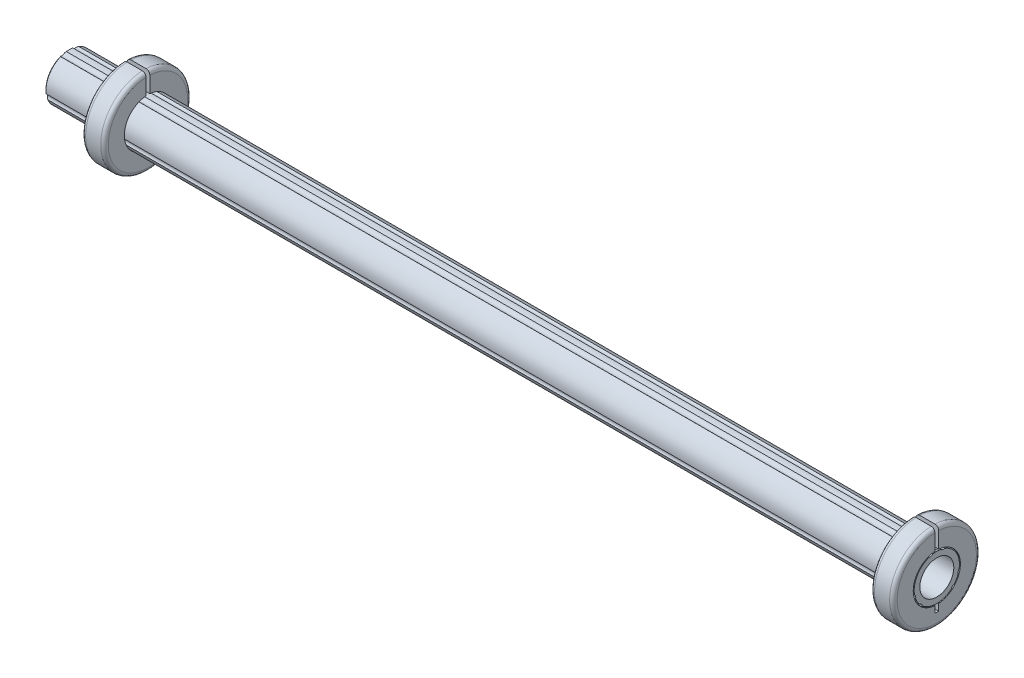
ISO-10303-21;
HEADER;
FILE_DESCRIPTION(('STEP AP214'),'2;1');
FILE_NAME('part.step','',(''),(''),'','','');
FILE_SCHEMA(('AUTOMOTIVE_DESIGN { 1 0 10303 214 1 1 1 1 }'));
ENDSEC;
DATA;
#1=APPLICATION_CONTEXT('core data for automotive mechanical design processes');
#2=APPLICATION_PROTOCOL_DEFINITION('international standard','automotive_design',2000,#1);
#3=PRODUCT_CONTEXT('',#1,'mechanical');
#4=PRODUCT('Part','Part','',(#3));
#5=PRODUCT_RELATED_PRODUCT_CATEGORY('part','',(#4));
#6=PRODUCT_DEFINITION_FORMATION('','',#4);
#7=PRODUCT_DEFINITION_CONTEXT('part definition',#1,'design');
#8=PRODUCT_DEFINITION('design','',#6,#7);
#9=PRODUCT_DEFINITION_SHAPE('','',#8);
#10=(LENGTH_UNIT() NAMED_UNIT(*) SI_UNIT(.MILLI.,.METRE.));
#11=(NAMED_UNIT(*) PLANE_ANGLE_UNIT() SI_UNIT($,.RADIAN.));
#12=(NAMED_UNIT(*) SI_UNIT($,.STERADIAN.) SOLID_ANGLE_UNIT());
#13=UNCERTAINTY_MEASURE_WITH_UNIT(LENGTH_MEASURE(1.E-05),#10,'distance_accuracy_value','');
#14=(GEOMETRIC_REPRESENTATION_CONTEXT(3) GLOBAL_UNCERTAINTY_ASSIGNED_CONTEXT((#13)) GLOBAL_UNIT_ASSIGNED_CONTEXT((#10,
#11,#12)) REPRESENTATION_CONTEXT('',''));
#15=CARTESIAN_POINT('',(0.,0.,0.));
#16=DIRECTION('',(0.,0.,1.));
#17=DIRECTION('',(1.,0.,0.));
#18=AXIS2_PLACEMENT_3D('',#15,#16,#17);
#19=CARTESIAN_POINT('',(166.702233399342,45.727343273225,68.8845142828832));
#20=DIRECTION('',(1.,0.,0.));
#21=DIRECTION('',(0.,0.,-1.));
#22=AXIS2_PLACEMENT_3D('',#19,#20,#21);
#23=CYLINDRICAL_SURFACE('',#22,1.985);
#24=CARTESIAN_POINT('',(-46.2977666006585,45.727343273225,68.8845142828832));
#25=DIRECTION('',(1.,0.,0.));
#26=DIRECTION('',(0.,0.,-1.));
#27=AXIS2_PLACEMENT_3D('',#24,#25,#26);
#28=CIRCLE('',#27,1.985);
#29=CARTESIAN_POINT('',(-46.2977666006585,45.0897571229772,67.0046980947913));
#30=VERTEX_POINT('',#29);
#31=CARTESIAN_POINT('',(-46.2977666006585,47.2194171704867,67.5753387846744));
#32=VERTEX_POINT('',#31);
#33=EDGE_CURVE('P0_E221',#30,#32,#28,.T.);
#34=ORIENTED_EDGE('',*,*,#33,.F.);
#35=CARTESIAN_POINT('',(-45.7977666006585,44.510967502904,67.3158667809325));
#36=CARTESIAN_POINT('',(-45.8431119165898,44.5523344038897,67.283800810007));
#37=CARTESIAN_POINT('',(-45.8878465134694,44.5954048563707,67.2530118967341));
#38=CARTESIAN_POINT('',(-45.9754364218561,44.6847751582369,67.1945077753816));
#39=CARTESIAN_POINT('',(-46.0183010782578,44.7310549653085,67.1667758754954));
#40=CARTESIAN_POINT('',(-46.1020366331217,44.8271545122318,67.1145206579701));
#41=CARTESIAN_POINT('',(-46.1429069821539,44.8769752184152,67.0899982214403));
#42=CARTESIAN_POINT('',(-46.2223112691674,44.9804916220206,67.044502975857));
#43=CARTESIAN_POINT('',(-46.2608302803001,45.0342081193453,67.0235515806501));
#44=CARTESIAN_POINT('',(-46.2977666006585,45.0897571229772,67.0046980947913));
#45=B_SPLINE_CURVE_WITH_KNOTS('',3,(#35,#36,#37,#38,#39,#40,#41,#42,#43,#44),.UNSPECIFIED.,.F.,
.F.,(4,2,2,2,4),(0.,0.207753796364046,0.414310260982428,0.620923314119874,0.828734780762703),.UNSPECIFIED.);
#46=CARTESIAN_POINT('',(-45.7977666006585,44.510967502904,67.3158667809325));
#47=VERTEX_POINT('',#46);
#48=EDGE_CURVE('P0_E235',#47,#30,#45,.T.);
#49=ORIENTED_EDGE('',*,*,#48,.F.);
#50=DIRECTION('',(-1.,0.,0.));
#51=VECTOR('',#50,1.);
#52=CARTESIAN_POINT('',(166.702233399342,44.510967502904,67.3158667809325));
#53=LINE('',#52,#51);
#54=CARTESIAN_POINT('',(413.202233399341,44.510967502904,67.3158667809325));
#55=VERTEX_POINT('',#54);
#56=EDGE_CURVE('P0_E457',#55,#47,#53,.T.);
#57=ORIENTED_EDGE('',*,*,#56,.F.);
#58=CARTESIAN_POINT('',(413.702233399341,45.0897571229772,67.0046980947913));
#59=CARTESIAN_POINT('',(413.665297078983,45.0342081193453,67.0235515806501));
#60=CARTESIAN_POINT('',(413.62677806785,44.9804916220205,67.044502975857));
#61=CARTESIAN_POINT('',(413.547373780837,44.8769752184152,67.0899982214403));
#62=CARTESIAN_POINT('',(413.506503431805,44.8271545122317,67.1145206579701));
#63=CARTESIAN_POINT('',(413.422767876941,44.7310549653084,67.1667758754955));
#64=CARTESIAN_POINT('',(413.379903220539,44.6847751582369,67.1945077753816));
#65=CARTESIAN_POINT('',(413.292313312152,44.5954048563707,67.2530118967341));
#66=CARTESIAN_POINT('',(413.247578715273,44.5523344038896,67.283800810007));
#67=CARTESIAN_POINT('',(413.202233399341,44.510967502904,67.3158667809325));
#68=B_SPLINE_CURVE_WITH_KNOTS('',3,(#58,#59,#60,#61,#62,#63,#64,#65,#66,#67),.UNSPECIFIED.,.F.,
.F.,(4,2,2,2,4),(0.,0.207811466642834,0.414424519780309,0.620980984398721,0.828734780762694),.UNSPECIFIED.);
#69=CARTESIAN_POINT('',(413.702233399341,45.0897571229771,67.0046980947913));
#70=VERTEX_POINT('',#69);
#71=EDGE_CURVE('P0_E541',#70,#55,#68,.T.);
#72=ORIENTED_EDGE('',*,*,#71,.F.);
#73=CARTESIAN_POINT('',(413.702233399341,45.727343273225,68.8845142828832));
#74=DIRECTION('',(1.,0.,0.));
#75=DIRECTION('',(0.,0.,-1.));
#76=AXIS2_PLACEMENT_3D('',#73,#74,#75);
#77=CIRCLE('',#76,1.985);
#78=CARTESIAN_POINT('',(413.702233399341,47.2194171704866,67.5753387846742));
#79=VERTEX_POINT('',#78);
#80=EDGE_CURVE('P0_E504',#79,#70,#77,.F.);
#81=ORIENTED_EDGE('',*,*,#80,.F.);
#82=CARTESIAN_POINT('',(413.202233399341,47.5650793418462,68.1342135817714));
#83=CARTESIAN_POINT('',(413.247578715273,47.5452875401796,68.0857601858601));
#84=CARTESIAN_POINT('',(413.292313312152,47.5233818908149,68.0375609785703));
#85=CARTESIAN_POINT('',(413.379903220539,47.4752369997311,67.9422097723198));
#86=CARTESIAN_POINT('',(413.422767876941,47.449023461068,67.8950533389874));
#87=CARTESIAN_POINT('',(413.506503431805,47.3919264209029,67.8017492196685));
#88=CARTESIAN_POINT('',(413.547373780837,47.3610416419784,67.7556018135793));
#89=CARTESIAN_POINT('',(413.62677806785,47.2941414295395,67.6644435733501));
#90=CARTESIAN_POINT('',(413.665297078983,47.2580972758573,67.6194408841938));
#91=CARTESIAN_POINT('',(413.702233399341,47.2194171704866,67.5753387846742));
#92=B_SPLINE_CURVE_WITH_KNOTS('',3,(#82,#83,#84,#85,#86,#87,#88,#89,#90,#91),.UNSPECIFIED.,.F.,
.F.,(4,2,2,2,4),(0.,0.207753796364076,0.414310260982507,0.620923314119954,0.828734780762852),.UNSPECIFIED.);
#93=CARTESIAN_POINT('',(413.202233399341,47.5650793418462,68.1342135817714));
#94=VERTEX_POINT('',#93);
#95=EDGE_CURVE('P0_E243',#94,#79,#92,.T.);
#96=ORIENTED_EDGE('',*,*,#95,.F.);
#97=DIRECTION('',(-1.,0.,0.));
#98=VECTOR('',#97,1.);
#99=CARTESIAN_POINT('',(166.702233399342,47.5650793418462,68.1342135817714));
#100=LINE('',#99,#98);
#101=CARTESIAN_POINT('',(-45.7977666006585,47.5650793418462,68.1342135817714));
#102=VERTEX_POINT('',#101);
#103=EDGE_CURVE('P0_E241',#102,#94,#100,.F.);
#104=ORIENTED_EDGE('',*,*,#103,.F.);
#105=CARTESIAN_POINT('',(-46.2977666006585,47.2194171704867,67.5753387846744));
#106=CARTESIAN_POINT('',(-46.2608302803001,47.2580972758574,67.6194408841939));
#107=CARTESIAN_POINT('',(-46.2223112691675,47.2941414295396,67.6644435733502));
#108=CARTESIAN_POINT('',(-46.1429069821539,47.3610416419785,67.7556018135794));
#109=CARTESIAN_POINT('',(-46.1020366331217,47.391926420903,67.8017492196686));
#110=CARTESIAN_POINT('',(-46.0183010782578,47.449023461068,67.8950533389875));
#111=CARTESIAN_POINT('',(-45.9754364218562,47.4752369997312,67.9422097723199));
#112=CARTESIAN_POINT('',(-45.8878465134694,47.5233818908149,68.0375609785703));
#113=CARTESIAN_POINT('',(-45.8431119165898,47.5452875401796,68.0857601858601));
#114=CARTESIAN_POINT('',(-45.7977666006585,47.5650793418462,68.1342135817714));
#115=B_SPLINE_CURVE_WITH_KNOTS('',3,(#105,#106,#107,#108,#109,#110,#111,#112,#113,#114),
.UNSPECIFIED.,.F.,.F.,(4,2,2,2,4),(0.,0.207811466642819,0.414424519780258,0.62098098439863,
0.828734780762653),.UNSPECIFIED.);
#116=EDGE_CURVE('P0_E20',#32,#102,#115,.T.);
#117=ORIENTED_EDGE('',*,*,#116,.F.);
#118=EDGE_LOOP('',(#34,#49,#57,#72,#81,#96,#104,#117));
#119=FACE_BOUND('',#118,.T.);
#120=ADVANCED_FACE('P0_F16',(#119),#23,.F.);
#121=CARTESIAN_POINT('',(-31.2977666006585,36.7352471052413,55.7479230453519));
#122=DIRECTION('',(0.,-1.,0.));
#123=DIRECTION('',(0.,0.,-1.));
#124=AXIS2_PLACEMENT_3D('',#121,#122,#123);
#125=CONICAL_SURFACE('',#124,2.0120351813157,0.785398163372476);
#126=CARTESIAN_POINT('',(-31.2977666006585,38.7472822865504,55.7479230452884));
#127=VERTEX_POINT('',#126);
#128=VERTEX_LOOP('',#127);
#129=FACE_BOUND('',#128,.T.);
#130=CARTESIAN_POINT('',(-31.2977666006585,36.8865509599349,57.6086543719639));
#131=CARTESIAN_POINT('',(-31.1792837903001,36.886548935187,57.6086502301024));
#132=CARTESIAN_POINT('',(-31.0606441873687,36.8850530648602,57.5987866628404));
#133=CARTESIAN_POINT('',(-30.8265404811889,36.8792311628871,57.5594676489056));
#134=CARTESIAN_POINT('',(-30.7110837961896,36.8748990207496,57.5299698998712));
#135=CARTESIAN_POINT('',(-30.4870744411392,36.863918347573,57.4519886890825));
#136=CARTESIAN_POINT('',(-30.3785100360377,36.8572738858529,57.4035385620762));
#137=CARTESIAN_POINT('',(-30.1715109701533,36.842464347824,57.2886471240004));
#138=CARTESIAN_POINT('',(-30.073071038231,36.8343000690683,57.2222152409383));
#139=CARTESIAN_POINT('',(-29.8924136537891,36.817720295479,57.0750596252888));
#140=CARTESIAN_POINT('',(-29.8097985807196,36.809319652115,56.9948236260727));
#141=CARTESIAN_POINT('',(-29.6603688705,36.7930958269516,56.8207020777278));
#142=CARTESIAN_POINT('',(-29.5935485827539,36.7852724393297,56.7268214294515));
#143=CARTESIAN_POINT('',(-29.4824279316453,36.7717149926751,56.534609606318));
#144=CARTESIAN_POINT('',(-29.4369377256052,36.7658775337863,56.4369744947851));
#145=CARTESIAN_POINT('',(-29.3643803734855,36.7563674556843,56.2349900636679));
#146=CARTESIAN_POINT('',(-29.3373025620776,36.7526935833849,56.1306446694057));
#147=CARTESIAN_POINT('',(-29.3041700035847,36.7481724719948,55.9265336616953));
#148=CARTESIAN_POINT('',(-29.296710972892,36.7471366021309,55.8269985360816));
#149=CARTESIAN_POINT('',(-29.299062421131,36.7474611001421,55.6281479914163));
#150=CARTESIAN_POINT('',(-29.3088690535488,36.7488209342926,55.5288325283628));
#151=CARTESIAN_POINT('',(-29.3447087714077,36.7536939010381,55.3365702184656));
#152=CARTESIAN_POINT('',(-29.3702093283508,36.7571363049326,55.2435212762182));
#153=CARTESIAN_POINT('',(-29.4359290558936,36.7657401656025,55.0628739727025));
#154=CARTESIAN_POINT('',(-29.4761498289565,36.7709018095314,54.9752762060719));
#155=CARTESIAN_POINT('',(-29.5712418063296,36.7825875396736,54.8051185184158));
#156=CARTESIAN_POINT('',(-29.6265109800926,36.7891473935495,54.7227840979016));
#157=CARTESIAN_POINT('',(-29.7492449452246,36.8028659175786,54.5678543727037));
#158=CARTESIAN_POINT('',(-29.8167121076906,36.8100247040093,54.4952609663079));
#159=CARTESIAN_POINT('',(-29.9668258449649,36.8247471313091,54.356586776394));
#160=CARTESIAN_POINT('',(-30.0501931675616,36.8323051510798,54.2912859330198));
#161=CARTESIAN_POINT('',(-30.226222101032,36.8465633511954,54.1745059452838));
#162=CARTESIAN_POINT('',(-30.3188906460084,36.8532628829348,54.1230372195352));
#163=CARTESIAN_POINT('',(-30.517689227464,36.8655552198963,54.0317914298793));
#164=CARTESIAN_POINT('',(-30.6243067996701,36.871040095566,53.993063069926));
#165=CARTESIAN_POINT('',(-30.8423071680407,36.8796756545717,53.9331968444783));
#166=CARTESIAN_POINT('',(-30.9536811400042,36.8828304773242,53.91202777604));
#167=CARTESIAN_POINT('',(-31.104413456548,36.8852892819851,53.8955899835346));
#168=CARTESIAN_POINT('',(-31.1430111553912,36.8857614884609,53.8924423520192));
#169=CARTESIAN_POINT('',(-31.2203225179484,36.8863926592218,53.8882425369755));
#170=CARTESIAN_POINT('',(-31.2590361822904,36.886551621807,53.8871903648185));
#171=CARTESIAN_POINT('',(-31.4162494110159,36.8865489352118,53.8871958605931));
#172=CARTESIAN_POINT('',(-31.534889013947,36.8850530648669,53.897059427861));
#173=CARTESIAN_POINT('',(-31.7689927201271,36.8792311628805,53.9363784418));
#174=CARTESIAN_POINT('',(-31.8844494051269,36.8748990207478,53.965876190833));
#175=CARTESIAN_POINT('',(-32.1084587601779,36.8639183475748,54.0438574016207));
#176=CARTESIAN_POINT('',(-32.2170231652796,36.8572738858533,54.0923075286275));
#177=CARTESIAN_POINT('',(-32.424022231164,36.8424643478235,54.2071989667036));
#178=CARTESIAN_POINT('',(-32.5224621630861,36.8343000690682,54.2736308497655));
#179=CARTESIAN_POINT('',(-32.7031195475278,36.8177202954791,54.4207864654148));
#180=CARTESIAN_POINT('',(-32.7857346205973,36.809319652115,54.5010224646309));
#181=CARTESIAN_POINT('',(-32.9351643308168,36.7930958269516,54.6751440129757));
#182=CARTESIAN_POINT('',(-33.001984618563,36.7852724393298,54.7690246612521));
#183=CARTESIAN_POINT('',(-33.1131052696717,36.7717149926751,54.9612364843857));
#184=CARTESIAN_POINT('',(-33.1585954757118,36.7658775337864,55.0588715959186));
#185=CARTESIAN_POINT('',(-33.2311528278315,36.7563674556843,55.2608560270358));
#186=CARTESIAN_POINT('',(-33.2582306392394,36.7526935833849,55.365201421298));
#187=CARTESIAN_POINT('',(-33.2913631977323,36.7481724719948,55.5693124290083));
#188=CARTESIAN_POINT('',(-33.298822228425,36.7471366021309,55.6688475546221));
#189=CARTESIAN_POINT('',(-33.296470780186,36.7474611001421,55.8676980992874));
#190=CARTESIAN_POINT('',(-33.2866641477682,36.7488209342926,55.9670135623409));
#191=CARTESIAN_POINT('',(-33.2508244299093,36.7536939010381,56.1592758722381));
#192=CARTESIAN_POINT('',(-33.2253238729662,36.7571363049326,56.2523248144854));
#193=CARTESIAN_POINT('',(-33.1596041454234,36.7657401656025,56.4329721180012));
#194=CARTESIAN_POINT('',(-33.1193833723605,36.7709018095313,56.5205698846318));
#195=CARTESIAN_POINT('',(-33.0242913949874,36.7825875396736,56.6907275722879));
#196=CARTESIAN_POINT('',(-32.9690222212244,36.7891473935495,56.7730619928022));
#197=CARTESIAN_POINT('',(-32.8462882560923,36.8028659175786,56.927991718));
#198=CARTESIAN_POINT('',(-32.7788210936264,36.8100247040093,57.0005851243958));
#199=CARTESIAN_POINT('',(-32.6287073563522,36.8247471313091,57.1392593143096));
#200=CARTESIAN_POINT('',(-32.5453400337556,36.8323051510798,57.2045601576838));
#201=CARTESIAN_POINT('',(-32.3693111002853,36.8465633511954,57.3213401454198));
#202=CARTESIAN_POINT('',(-32.2766425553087,36.8532628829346,57.3728088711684));
#203=CARTESIAN_POINT('',(-32.0778439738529,36.8655552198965,57.4640546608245));
#204=CARTESIAN_POINT('',(-31.9712264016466,36.8710400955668,57.5027830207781));
#205=CARTESIAN_POINT('',(-31.753226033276,36.8796756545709,57.5626492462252));
#206=CARTESIAN_POINT('',(-31.6418520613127,36.8828304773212,57.5838183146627));
#207=CARTESIAN_POINT('',(-31.491119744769,36.8852892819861,57.6002561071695));
#208=CARTESIAN_POINT('',(-31.4525220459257,36.8857614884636,57.6034037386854));
#209=CARTESIAN_POINT('',(-31.3752106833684,36.8863926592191,57.6076035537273));
#210=CARTESIAN_POINT('',(-31.3364970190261,36.8865516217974,57.6086557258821));
#211=CARTESIAN_POINT('',(-31.2977666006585,36.8865509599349,57.6086543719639));
#212=B_SPLINE_CURVE_WITH_KNOTS('',3,(#130,#131,#132,#133,#134,#135,#136,#137,#138,#139,#140,
#141,#142,#143,#144,#145,#146,#147,#148,#149,#150,#151,#152,#153,#154,#155,#156,#157,#158,#159,
#160,#161,#162,#163,#164,#165,#166,#167,#168,#169,#170,#171,#172,#173,#174,#175,#176,#177,#178,
#179,#180,#181,#182,#183,#184,#185,#186,#187,#188,#189,#190,#191,#192,#193,#194,#195,#196,#197,
#198,#199,#200,#201,#202,#203,#204,#205,#206,#207,#208,#209,#210,#211),.UNSPECIFIED.,.T.,.F.,(4,
2,2,2,2,2,2,2,2,2,2,2,2,2,2,2,2,2,2,2,2,2,2,2,2,2,2,2,2,2,2,2,2,2,2,2,2,2,2,2,4),(0.,
0.355302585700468,0.711373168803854,1.06682026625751,1.42208135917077,1.76670038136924,
2.11119592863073,2.43309037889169,2.75479821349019,3.05275911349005,3.35065364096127,
3.63895828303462,3.92729431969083,4.22415468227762,4.52107281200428,4.83820691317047,
5.15557922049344,5.49479846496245,5.83341361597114,5.94955656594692,6.06570014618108,
6.42100273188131,6.7770733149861,7.13252041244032,7.487781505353,7.83240052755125,
8.17689607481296,8.49879052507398,8.82049835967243,9.11845925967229,9.41635378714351,
9.70465842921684,9.99299446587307,10.28985482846,10.5867729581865,10.9039070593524,
11.2212793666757,11.5604986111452,11.8991137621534,12.0152567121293,12.1314002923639),.UNSPECIFIED.);
#213=CARTESIAN_POINT('',(-31.2977666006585,36.8865509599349,57.6086543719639));
#214=VERTEX_POINT('',#213);
#215=EDGE_CURVE('P0_E456',#214,#214,#212,.T.);
#216=ORIENTED_EDGE('',*,*,#215,.F.);
#217=EDGE_LOOP('',(#216));
#218=FACE_BOUND('',#217,.T.);
#219=ADVANCED_FACE('P0_F674',(#129,#218),#125,.F.);
#220=CARTESIAN_POINT('',(398.702233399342,36.7352703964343,55.7479230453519));
#221=DIRECTION('',(0.,-1.,0.));
#222=DIRECTION('',(0.,0.,-1.));
#223=AXIS2_PLACEMENT_3D('',#220,#221,#222);
#224=CONICAL_SURFACE('',#223,2.01201189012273,0.785398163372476);
#225=DIRECTION('',(0.,0.707106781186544,-0.707106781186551));
#226=VECTOR('',#225,1.);
#227=CARTESIAN_POINT('',(398.702233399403,-499000.,499094.495205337));
#228=LINE('',#227,#226);
#229=CARTESIAN_POINT('',(398.702233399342,38.7472822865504,55.7479230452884));
#230=VERTEX_POINT('',#229);
#231=CARTESIAN_POINT('',(398.702233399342,36.8865509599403,57.6086543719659));
#232=VERTEX_POINT('',#231);
#233=EDGE_CURVE('P0_E498',#230,#232,#228,.F.);
#234=ORIENTED_EDGE('',*,*,#233,.T.);
#235=CARTESIAN_POINT('',(398.702233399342,36.8865509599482,53.8871917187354));
#236=CARTESIAN_POINT('',(398.642888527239,36.8865530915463,53.8871937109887));
#237=CARTESIAN_POINT('',(398.583572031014,36.8861790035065,53.8896607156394));
#238=CARTESIAN_POINT('',(398.465355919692,36.8847009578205,53.8995131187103));
#239=CARTESIAN_POINT('',(398.406456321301,36.8835969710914,53.9068987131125));
#240=CARTESIAN_POINT('',(398.230941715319,36.8792243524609,53.9364137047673));
#241=CARTESIAN_POINT('',(398.115499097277,36.8748950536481,53.9659013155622));
#242=CARTESIAN_POINT('',(397.891516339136,36.8639185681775,54.0438588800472));
#243=CARTESIAN_POINT('',(397.782968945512,36.8572738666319,54.0923084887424));
#244=CARTESIAN_POINT('',(397.575982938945,36.8424641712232,54.2071995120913));
#245=CARTESIAN_POINT('',(397.477538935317,36.8342999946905,54.2736312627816));
#246=CARTESIAN_POINT('',(397.2968832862,36.8177207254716,54.4207828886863));
#247=CARTESIAN_POINT('',(397.214273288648,36.8093205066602,54.5010143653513));
#248=CARTESIAN_POINT('',(397.064842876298,36.7930966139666,54.6751345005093));
#249=CARTESIAN_POINT('',(396.998018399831,36.7852727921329,54.7690196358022));
#250=CARTESIAN_POINT('',(396.88689334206,36.7717148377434,54.9612387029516));
#251=CARTESIAN_POINT('',(396.84140233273,36.7658772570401,55.0588762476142));
#252=CARTESIAN_POINT('',(396.768845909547,36.7563672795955,55.2608609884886));
#253=CARTESIAN_POINT('',(396.741768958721,36.7526935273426,55.365203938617));
#254=CARTESIAN_POINT('',(396.708636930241,36.7481724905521,55.5693116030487));
#255=CARTESIAN_POINT('',(396.701177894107,36.7471366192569,55.6688458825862));
#256=CARTESIAN_POINT('',(396.703529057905,36.7474610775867,55.8676964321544));
#257=CARTESIAN_POINT('',(396.713335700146,36.7488209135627,55.9670127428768));
#258=CARTESIAN_POINT('',(396.74917566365,36.7536939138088,56.1592763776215));
#259=CARTESIAN_POINT('',(396.77467639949,36.7571363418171,56.2523258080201));
#260=CARTESIAN_POINT('',(396.84039628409,36.7657402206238,56.4329730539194));
#261=CARTESIAN_POINT('',(396.880616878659,36.7709018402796,56.5205703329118));
#262=CARTESIAN_POINT('',(396.975707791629,36.7825874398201,56.6907261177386));
#263=CARTESIAN_POINT('',(397.030975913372,36.7891471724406,56.7730592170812));
#264=CARTESIAN_POINT('',(397.153709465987,36.8028656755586,56.9279892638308));
#265=CARTESIAN_POINT('',(397.221177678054,36.8100245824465,57.0005839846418));
#266=CARTESIAN_POINT('',(397.371298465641,36.8247477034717,57.1392646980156));
#267=CARTESIAN_POINT('',(397.454672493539,36.8323062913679,57.2045699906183));
#268=CARTESIAN_POINT('',(397.630702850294,36.8465643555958,57.3213478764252));
#269=CARTESIAN_POINT('',(397.723364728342,36.8532633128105,57.3728121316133));
#270=CARTESIAN_POINT('',(397.922124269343,36.8655532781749,57.4640401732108));
#271=CARTESIAN_POINT('',(398.028707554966,36.8710367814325,57.5027593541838));
#272=CARTESIAN_POINT('',(398.246705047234,36.8796736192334,57.5626358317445));
#273=CARTESIAN_POINT('',(398.358113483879,36.8828296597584,57.5838135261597));
#274=CARTESIAN_POINT('',(398.508913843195,36.8852899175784,57.6002601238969));
#275=CARTESIAN_POINT('',(398.547545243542,36.8857625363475,57.6034101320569));
#276=CARTESIAN_POINT('',(398.624857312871,36.8863927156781,57.6076045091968));
#277=CARTESIAN_POINT('',(398.663537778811,36.886550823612,57.608652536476));
#278=CARTESIAN_POINT('',(398.702233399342,36.8865509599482,57.6086543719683));
#279=B_SPLINE_CURVE_WITH_KNOTS('',3,(#235,#236,#237,#238,#239,#240,#241,#242,#243,#244,#245,
#246,#247,#248,#249,#250,#251,#252,#253,#254,#255,#256,#257,#258,#259,#260,#261,#262,#263,#264,
#265,#266,#267,#268,#269,#270,#271,#272,#273,#274,#275,#276,#277,#278),.UNSPECIFIED.,.F.,.F.,(4,
2,2,2,2,2,2,2,2,2,2,2,2,2,2,2,2,2,2,2,2,4),(0.,0.177925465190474,0.355858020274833,
0.711688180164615,1.06713759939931,1.42239637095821,1.7669980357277,2.11151093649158,
2.43341301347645,2.75511322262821,3.05307163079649,3.35096865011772,3.6392748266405,
3.92760932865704,4.22446469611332,4.52138782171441,4.83854570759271,5.15589422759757,
5.4950088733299,5.83372862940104,5.94997313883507,6.06601515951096),.UNSPECIFIED.);
#280=CARTESIAN_POINT('',(398.702233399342,36.8865509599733,53.887191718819));
#281=VERTEX_POINT('',#280);
#282=EDGE_CURVE('P0_E649',#281,#232,#279,.T.);
#283=ORIENTED_EDGE('',*,*,#282,.F.);
#284=DIRECTION('',(0.,0.707106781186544,0.707106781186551));
#285=VECTOR('',#284,1.);
#286=CARTESIAN_POINT('',(398.702233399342,-499000.,-498982.999359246));
#287=LINE('',#286,#285);
#288=EDGE_CURVE('P0_E234',#281,#230,#287,.T.);
#289=ORIENTED_EDGE('',*,*,#288,.T.);
#290=EDGE_LOOP('',(#234,#283,#289));
#291=FACE_BOUND('',#290,.T.);
#292=ADVANCED_FACE('P0_F677',(#291),#224,.F.);
#293=CARTESIAN_POINT('',(398.702233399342,36.7352480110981,55.7479230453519));
#294=DIRECTION('',(0.,-1.,0.));
#295=DIRECTION('',(0.,0.,-1.));
#296=AXIS2_PLACEMENT_3D('',#293,#294,#295);
#297=CONICAL_SURFACE('',#296,2.01203427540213,0.78539816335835);
#298=ORIENTED_EDGE('',*,*,#288,.F.);
#299=CARTESIAN_POINT('',(398.702233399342,36.8865509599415,57.6086543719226));
#300=CARTESIAN_POINT('',(398.761578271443,36.8865530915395,57.6086523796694));
#301=CARTESIAN_POINT('',(398.820894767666,36.8861790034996,57.6061853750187));
#302=CARTESIAN_POINT('',(398.939110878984,36.8847009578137,57.5963329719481));
#303=CARTESIAN_POINT('',(398.998010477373,36.8835969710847,57.5889473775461));
#304=CARTESIAN_POINT('',(399.173525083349,36.8792243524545,57.5594323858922));
#305=CARTESIAN_POINT('',(399.288967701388,36.8748950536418,57.5299447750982));
#306=CARTESIAN_POINT('',(399.512950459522,36.8639185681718,57.4519872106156));
#307=CARTESIAN_POINT('',(399.621497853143,36.8572738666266,57.4035376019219));
#308=CARTESIAN_POINT('',(399.828483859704,36.8424641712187,57.2886465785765));
#309=CARTESIAN_POINT('',(399.926927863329,36.8342999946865,57.2222148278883));
#310=CARTESIAN_POINT('',(400.10758351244,36.8177207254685,57.075063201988));
#311=CARTESIAN_POINT('',(400.190193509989,36.8093205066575,56.9948317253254));
#312=CARTESIAN_POINT('',(400.339623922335,36.7930966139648,56.8207115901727));
#313=CARTESIAN_POINT('',(400.4064483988,36.7852727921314,56.7268264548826));
#314=CARTESIAN_POINT('',(400.517573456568,36.7717148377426,56.5346073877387));
#315=CARTESIAN_POINT('',(400.563064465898,36.7658772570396,56.4369698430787));
#316=CARTESIAN_POINT('',(400.635620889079,36.7563672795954,56.2349851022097));
#317=CARTESIAN_POINT('',(400.662697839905,36.7526935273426,56.130642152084));
#318=CARTESIAN_POINT('',(400.695829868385,36.7481724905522,55.9265344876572));
#319=CARTESIAN_POINT('',(400.70328890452,36.7471366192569,55.8270002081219));
#320=CARTESIAN_POINT('',(400.700937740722,36.7474610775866,55.628149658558));
#321=CARTESIAN_POINT('',(400.691131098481,36.7488209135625,55.5288333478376));
#322=CARTESIAN_POINT('',(400.655291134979,36.7536939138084,55.3365697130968));
#323=CARTESIAN_POINT('',(400.62979039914,36.7571363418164,55.2435202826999));
#324=CARTESIAN_POINT('',(400.564070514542,36.7657402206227,55.0628730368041));
#325=CARTESIAN_POINT('',(400.523849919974,36.7709018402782,54.9752757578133));
#326=CARTESIAN_POINT('',(400.428759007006,36.7825874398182,54.8051199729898));
#327=CARTESIAN_POINT('',(400.373490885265,36.7891471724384,54.7227868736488));
#328=CARTESIAN_POINT('',(400.250757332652,36.8028656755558,54.5678568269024));
#329=CARTESIAN_POINT('',(400.183289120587,36.8100245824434,54.4952621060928));
#330=CARTESIAN_POINT('',(400.033168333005,36.8247477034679,54.3565813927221));
#331=CARTESIAN_POINT('',(399.949794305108,36.8323062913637,54.2912761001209));
#332=CARTESIAN_POINT('',(399.773763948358,36.8465643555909,54.1744982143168));
#333=CARTESIAN_POINT('',(399.681102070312,36.8532633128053,54.1230339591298));
#334=CARTESIAN_POINT('',(399.482342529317,36.8655532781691,54.0318059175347));
#335=CARTESIAN_POINT('',(399.375759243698,36.8710367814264,53.9930867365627));
#336=CARTESIAN_POINT('',(399.157761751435,36.8796736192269,53.9332102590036));
#337=CARTESIAN_POINT('',(399.046353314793,36.8828296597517,53.912032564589));
#338=CARTESIAN_POINT('',(398.895552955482,36.8852899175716,53.8955859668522));
#339=CARTESIAN_POINT('',(398.856921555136,36.8857625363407,53.8924359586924));
#340=CARTESIAN_POINT('',(398.77960948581,36.8863927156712,53.8882415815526));
#341=CARTESIAN_POINT('',(398.740929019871,36.8865508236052,53.8871935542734));
#342=CARTESIAN_POINT('',(398.702233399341,36.8865509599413,53.8871917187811));
#343=B_SPLINE_CURVE_WITH_KNOTS('',3,(#299,#300,#301,#302,#303,#304,#305,#306,#307,#308,#309,
#310,#311,#312,#313,#314,#315,#316,#317,#318,#319,#320,#321,#322,#323,#324,#325,#326,#327,#328,
#329,#330,#331,#332,#333,#334,#335,#336,#337,#338,#339,#340,#341,#342),.UNSPECIFIED.,.F.,.F.,(4,
2,2,2,2,2,2,2,2,2,2,2,2,2,2,2,2,2,2,2,2,4),(0.,0.177925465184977,0.355858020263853,
0.711688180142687,1.06713759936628,1.42239637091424,1.76699803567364,2.11151093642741,
2.43341301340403,2.75511322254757,3.05307163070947,3.35096865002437,3.63927482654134,
3.92760932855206,4.22446469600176,4.52138782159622,4.83854570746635,5.15589422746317,
5.49500887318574,5.83372862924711,5.94997313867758,6.06601515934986),.UNSPECIFIED.);
#344=EDGE_CURVE('P0_E491',#232,#281,#343,.T.);
#345=ORIENTED_EDGE('',*,*,#344,.F.);
#346=ORIENTED_EDGE('',*,*,#233,.F.);
#347=EDGE_LOOP('',(#298,#345,#346));
#348=FACE_BOUND('',#347,.T.);
#349=ADVANCED_FACE('P0_F655',(#348),#297,.F.);
#350=CARTESIAN_POINT('',(-26.2977666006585,36.7472822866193,43.2479230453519));
#351=DIRECTION('',(1.,0.,0.));
#352=DIRECTION('',(0.,0.,-1.));
#353=AXIS2_PLACEMENT_3D('',#350,#351,#352);
#354=PLANE('',#353);
#355=CARTESIAN_POINT('',(-26.2977666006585,49.2472822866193,55.7479230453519));
#356=DIRECTION('',(-1.,0.,0.));
#357=DIRECTION('',(0.,0.,1.));
#358=AXIS2_PLACEMENT_3D('',#355,#356,#357);
#359=CIRCLE('',#358,12.5);
#360=CARTESIAN_POINT('',(-26.2977666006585,47.5650793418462,43.3616325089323));
#361=VERTEX_POINT('',#360);
#362=CARTESIAN_POINT('',(-26.2977666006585,54.1462617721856,44.2479230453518));
#363=VERTEX_POINT('',#362);
#364=EDGE_CURVE('P0_E485',#361,#363,#359,.F.);
#365=ORIENTED_EDGE('',*,*,#364,.F.);
#366=CARTESIAN_POINT('',(-26.2977666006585,45.727343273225,42.6113318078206));
#367=DIRECTION('',(1.,0.,0.));
#368=DIRECTION('',(0.,0.,-1.));
#369=AXIS2_PLACEMENT_3D('',#366,#367,#368);
#370=CIRCLE('',#369,1.985);
#371=CARTESIAN_POINT('',(-26.2977666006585,46.8506393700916,44.2479230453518));
#372=VERTEX_POINT('',#371);
#373=EDGE_CURVE('P0_E501',#372,#361,#370,.F.);
#374=ORIENTED_EDGE('',*,*,#373,.F.);
#375=DIRECTION('',(0.,1.,0.));
#376=VECTOR('',#375,1.);
#377=CARTESIAN_POINT('',(-26.2977666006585,36.7472822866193,44.2479230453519));
#378=LINE('',#377,#376);
#379=EDGE_CURVE('P0_E488',#372,#363,#378,.T.);
#380=ORIENTED_EDGE('',*,*,#379,.T.);
#381=EDGE_LOOP('',(#365,#374,#380));
#382=FACE_BOUND('',#381,.T.);
#383=ADVANCED_FACE('P0_F686',(#382),#354,.F.);
#384=CARTESIAN_POINT('',(-36.2977666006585,36.7472822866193,44.2479230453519));
#385=DIRECTION('',(-1.,0.,0.));
#386=DIRECTION('',(0.,0.,1.));
#387=AXIS2_PLACEMENT_3D('',#384,#385,#386);
#388=PLANE('',#387);
#389=CARTESIAN_POINT('',(-36.2977666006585,49.2472822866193,55.7479230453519));
#390=DIRECTION('',(-1.,0.,0.));
#391=DIRECTION('',(0.,0.,1.));
#392=AXIS2_PLACEMENT_3D('',#389,#390,#391);
#393=CIRCLE('',#392,12.5);
#394=CARTESIAN_POINT('',(-36.2977666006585,54.1462617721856,44.2479230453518));
#395=VERTEX_POINT('',#394);
#396=CARTESIAN_POINT('',(-36.2977666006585,47.5650793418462,43.3616325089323));
#397=VERTEX_POINT('',#396);
#398=EDGE_CURVE('P0_E452',#395,#397,#393,.T.);
#399=ORIENTED_EDGE('',*,*,#398,.F.);
#400=DIRECTION('',(0.,1.,0.));
#401=VECTOR('',#400,1.);
#402=CARTESIAN_POINT('',(-36.2977666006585,36.7472822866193,44.2479230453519));
#403=LINE('',#402,#401);
#404=CARTESIAN_POINT('',(-36.2977666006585,46.8506393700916,44.2479230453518));
#405=VERTEX_POINT('',#404);
#406=EDGE_CURVE('P0_E442',#395,#405,#403,.F.);
#407=ORIENTED_EDGE('',*,*,#406,.T.);
#408=CARTESIAN_POINT('',(-36.2977666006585,45.727343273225,42.6113318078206));
#409=DIRECTION('',(1.,0.,0.));
#410=DIRECTION('',(0.,0.,-1.));
#411=AXIS2_PLACEMENT_3D('',#408,#409,#410);
#412=CIRCLE('',#411,1.985);
#413=EDGE_CURVE('P0_E468',#397,#405,#412,.T.);
#414=ORIENTED_EDGE('',*,*,#413,.F.);
#415=EDGE_LOOP('',(#399,#407,#414));
#416=FACE_BOUND('',#415,.T.);
#417=ADVANCED_FACE('P0_F861',(#416),#388,.F.);
#418=CARTESIAN_POINT('',(166.702233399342,49.2472822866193,55.7479230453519));
#419=DIRECTION('',(-1.,0.,0.));
#420=DIRECTION('',(0.,0.,1.));
#421=AXIS2_PLACEMENT_3D('',#418,#419,#420);
#422=CYLINDRICAL_SURFACE('',#421,12.5);
#423=DIRECTION('',(1.,0.,0.));
#424=VECTOR('',#423,1.);
#425=CARTESIAN_POINT('',(166.702233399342,61.6335728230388,54.0657201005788));
#426=LINE('',#425,#424);
#427=CARTESIAN_POINT('',(413.202233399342,61.6335728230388,54.0657201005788));
#428=VERTEX_POINT('',#427);
#429=CARTESIAN_POINT('',(-45.7977666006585,61.6335728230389,54.0657201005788));
#430=VERTEX_POINT('',#429);
#431=EDGE_CURVE('P0_E420',#428,#430,#426,.F.);
#432=ORIENTED_EDGE('',*,*,#431,.T.);
#433=CARTESIAN_POINT('',(-45.7977666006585,49.2472822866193,55.7479230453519));
#434=DIRECTION('',(1.,0.,0.));
#435=DIRECTION('',(0.,0.,-1.));
#436=AXIS2_PLACEMENT_3D('',#433,#434,#435);
#437=CIRCLE('',#436,12.5);
#438=CARTESIAN_POINT('',(-45.7977666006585,61.6335728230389,57.430125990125));
#439=VERTEX_POINT('',#438);
#440=EDGE_CURVE('P0_E474',#439,#430,#437,.F.);
#441=ORIENTED_EDGE('',*,*,#440,.F.);
#442=DIRECTION('',(1.,0.,0.));
#443=VECTOR('',#442,1.);
#444=CARTESIAN_POINT('',(166.702233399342,61.6335728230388,57.430125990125));
#445=LINE('',#444,#443);
#446=CARTESIAN_POINT('',(413.202233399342,61.6335728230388,57.430125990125));
#447=VERTEX_POINT('',#446);
#448=EDGE_CURVE('P0_E411',#439,#447,#445,.T.);
#449=ORIENTED_EDGE('',*,*,#448,.T.);
#450=CARTESIAN_POINT('',(413.202233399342,49.2472822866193,55.7479230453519));
#451=DIRECTION('',(-1.,0.,0.));
#452=DIRECTION('',(0.,0.,1.));
#453=AXIS2_PLACEMENT_3D('',#450,#451,#452);
#454=CIRCLE('',#453,12.5);
#455=EDGE_CURVE('P0_E419',#428,#447,#454,.F.);
#456=ORIENTED_EDGE('',*,*,#455,.F.);
#457=EDGE_LOOP('',(#432,#441,#449,#456));
#458=FACE_BOUND('',#457,.T.);
#459=ADVANCED_FACE('P0_F854',(#458),#422,.T.);
#460=CARTESIAN_POINT('',(166.702233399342,49.2472822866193,55.7479230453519));
#461=DIRECTION('',(-1.,0.,0.));
#462=DIRECTION('',(0.,0.,1.));
#463=AXIS2_PLACEMENT_3D('',#460,#461,#462);
#464=CYLINDRICAL_SURFACE('',#463,12.5);
#465=DIRECTION('',(1.,0.,0.));
#466=VECTOR('',#465,1.);
#467=CARTESIAN_POINT('',(166.702233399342,60.8152260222,60.4842378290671));
#468=LINE('',#467,#466);
#469=CARTESIAN_POINT('',(413.202233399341,60.8152260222,60.4842378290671));
#470=VERTEX_POINT('',#469);
#471=CARTESIAN_POINT('',(-45.7977666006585,60.8152260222,60.4842378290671));
#472=VERTEX_POINT('',#471);
#473=EDGE_CURVE('P0_E416',#470,#472,#468,.F.);
#474=ORIENTED_EDGE('',*,*,#473,.T.);
#475=CARTESIAN_POINT('',(-45.7977666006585,49.2472822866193,55.7479230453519));
#476=DIRECTION('',(1.,0.,0.));
#477=DIRECTION('',(0.,0.,-1.));
#478=AXIS2_PLACEMENT_3D('',#475,#476,#477);
#479=CIRCLE('',#478,12.5);
#480=EDGE_CURVE('P0_E465',#102,#472,#479,.F.);
#481=ORIENTED_EDGE('',*,*,#480,.F.);
#482=ORIENTED_EDGE('',*,*,#103,.T.);
#483=CARTESIAN_POINT('',(413.202233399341,49.2472822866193,55.7479230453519));
#484=DIRECTION('',(-1.,0.,0.));
#485=DIRECTION('',(0.,0.,1.));
#486=AXIS2_PLACEMENT_3D('',#483,#484,#485);
#487=CIRCLE('',#486,12.5);
#488=EDGE_CURVE('P0_E460',#470,#94,#487,.F.);
#489=ORIENTED_EDGE('',*,*,#488,.F.);
#490=EDGE_LOOP('',(#474,#481,#482,#489));
#491=FACE_BOUND('',#490,.T.);
#492=ADVANCED_FACE('P0_F847',(#491),#464,.T.);
#493=CARTESIAN_POINT('',(166.702233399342,49.2472822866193,55.7479230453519));
#494=DIRECTION('',(-1.,0.,0.));
#495=DIRECTION('',(0.,0.,1.));
#496=AXIS2_PLACEMENT_3D('',#493,#494,#495);
#497=CYLINDRICAL_SURFACE('',#496,12.5);
#498=ORIENTED_EDGE('',*,*,#56,.T.);
#499=CARTESIAN_POINT('',(-45.7977666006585,49.2472822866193,55.7479230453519));
#500=DIRECTION('',(1.,0.,0.));
#501=DIRECTION('',(0.,0.,-1.));
#502=AXIS2_PLACEMENT_3D('',#499,#500,#501);
#503=CIRCLE('',#502,12.5);
#504=CARTESIAN_POINT('',(-45.7977666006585,41.597306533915,65.6336638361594));
#505=VERTEX_POINT('',#504);
#506=EDGE_CURVE('P0_E461',#505,#47,#503,.F.);
#507=ORIENTED_EDGE('',*,*,#506,.F.);
#508=DIRECTION('',(1.,0.,0.));
#509=VECTOR('',#508,1.);
#510=CARTESIAN_POINT('',(166.702233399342,41.597306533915,65.6336638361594));
#511=LINE('',#510,#509);
#512=CARTESIAN_POINT('',(413.202233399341,41.597306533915,65.6336638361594));
#513=VERTEX_POINT('',#512);
#514=EDGE_CURVE('P0_E406',#505,#513,#511,.T.);
#515=ORIENTED_EDGE('',*,*,#514,.T.);
#516=CARTESIAN_POINT('',(413.202233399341,49.2472822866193,55.7479230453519));
#517=DIRECTION('',(-1.,0.,0.));
#518=DIRECTION('',(0.,0.,1.));
#519=AXIS2_PLACEMENT_3D('',#516,#517,#518);
#520=CIRCLE('',#519,12.5);
#521=EDGE_CURVE('P0_E458',#55,#513,#520,.F.);
#522=ORIENTED_EDGE('',*,*,#521,.F.);
#523=EDGE_LOOP('',(#498,#507,#515,#522));
#524=FACE_BOUND('',#523,.T.);
#525=ADVANCED_FACE('P0_F664',(#524),#497,.T.);
#526=CARTESIAN_POINT('',(166.702233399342,49.2472822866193,55.7479230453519));
#527=DIRECTION('',(-1.,0.,0.));
#528=DIRECTION('',(0.,0.,1.));
#529=AXIS2_PLACEMENT_3D('',#526,#527,#528);
#530=CYLINDRICAL_SURFACE('',#529,12.5);
#531=ORIENTED_EDGE('',*,*,#282,.T.);
#532=ORIENTED_EDGE('',*,*,#344,.T.);
#533=EDGE_LOOP('',(#531,#532));
#534=FACE_BOUND('',#533,.T.);
#535=ORIENTED_EDGE('',*,*,#215,.T.);
#536=EDGE_LOOP('',(#535));
#537=FACE_BOUND('',#536,.T.);
#538=DIRECTION('',(-1.,0.,0.));
#539=VECTOR('',#538,1.);
#540=CARTESIAN_POINT('',(166.702233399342,39.3615414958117,63.3978987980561));
#541=LINE('',#540,#539);
#542=CARTESIAN_POINT('',(413.202233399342,39.3615414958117,63.3978987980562));
#543=VERTEX_POINT('',#542);
#544=CARTESIAN_POINT('',(-45.7977666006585,39.3615414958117,63.3978987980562));
#545=VERTEX_POINT('',#544);
#546=EDGE_CURVE('P0_E453',#543,#545,#541,.T.);
#547=ORIENTED_EDGE('',*,*,#546,.T.);
#548=CARTESIAN_POINT('',(-45.7977666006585,49.2472822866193,55.7479230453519));
#549=DIRECTION('',(1.,0.,0.));
#550=DIRECTION('',(0.,0.,-1.));
#551=AXIS2_PLACEMENT_3D('',#548,#549,#550);
#552=CIRCLE('',#551,12.5);
#553=CARTESIAN_POINT('',(-45.7977666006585,39.3615414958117,48.0979472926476));
#554=VERTEX_POINT('',#553);
#555=EDGE_CURVE('P0_E446',#554,#545,#552,.F.);
#556=ORIENTED_EDGE('',*,*,#555,.F.);
#557=DIRECTION('',(1.,0.,0.));
#558=VECTOR('',#557,1.);
#559=CARTESIAN_POINT('',(166.702233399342,39.3615414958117,48.0979472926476));
#560=LINE('',#559,#558);
#561=CARTESIAN_POINT('',(413.202233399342,39.3615414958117,48.0979472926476));
#562=VERTEX_POINT('',#561);
#563=EDGE_CURVE('P0_E391',#554,#562,#560,.T.);
#564=ORIENTED_EDGE('',*,*,#563,.T.);
#565=CARTESIAN_POINT('',(413.202233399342,49.2472822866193,55.7479230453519));
#566=DIRECTION('',(-1.,0.,0.));
#567=DIRECTION('',(0.,0.,1.));
#568=AXIS2_PLACEMENT_3D('',#565,#566,#567);
#569=CIRCLE('',#568,12.5);
#570=EDGE_CURVE('P0_E447',#543,#562,#569,.F.);
#571=ORIENTED_EDGE('',*,*,#570,.F.);
#572=EDGE_LOOP('',(#547,#556,#564,#571));
#573=FACE_BOUND('',#572,.T.);
#574=ADVANCED_FACE('P0_F658',(#534,#537,#573),#530,.T.);
#575=CARTESIAN_POINT('',(-26.2977666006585,36.7472822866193,44.2479230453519));
#576=DIRECTION('',(0.,0.,1.));
#577=DIRECTION('',(1.,0.,0.));
#578=AXIS2_PLACEMENT_3D('',#575,#576,#577);
#579=PLANE('',#578);
#580=DIRECTION('',(-1.,0.,0.));
#581=VECTOR('',#580,1.);
#582=CARTESIAN_POINT('',(166.702233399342,54.1462617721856,44.2479230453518));
#583=LINE('',#582,#581);
#584=EDGE_CURVE('P0_E482',#363,#395,#583,.T.);
#585=ORIENTED_EDGE('',*,*,#584,.F.);
#586=ORIENTED_EDGE('',*,*,#379,.F.);
#587=DIRECTION('',(1.,0.,0.));
#588=VECTOR('',#587,1.);
#589=CARTESIAN_POINT('',(166.702233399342,46.8506393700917,44.2479230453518));
#590=LINE('',#589,#588);
#591=EDGE_CURVE('P0_E432',#372,#405,#590,.F.);
#592=ORIENTED_EDGE('',*,*,#591,.T.);
#593=ORIENTED_EDGE('',*,*,#406,.F.);
#594=EDGE_LOOP('',(#585,#586,#592,#593));
#595=FACE_BOUND('',#594,.T.);
#596=ADVANCED_FACE('P0_F663',(#595),#579,.F.);
#597=CARTESIAN_POINT('',(-36.2977666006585,36.7472822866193,44.2479230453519));
#598=DIRECTION('',(-1.,0.,0.));
#599=DIRECTION('',(0.,0.,1.));
#600=AXIS2_PLACEMENT_3D('',#597,#598,#599);
#601=PLANE('',#600);
#602=CARTESIAN_POINT('',(-36.2977666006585,45.727343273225,42.6113318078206));
#603=DIRECTION('',(1.,0.,0.));
#604=DIRECTION('',(0.,0.,-1.));
#605=AXIS2_PLACEMENT_3D('',#602,#603,#604);
#606=CIRCLE('',#605,1.985);
#607=CARTESIAN_POINT('',(-36.2977666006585,44.510967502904,44.1799793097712));
#608=VERTEX_POINT('',#607);
#609=CARTESIAN_POINT('',(-36.2977666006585,44.6040471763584,44.2479230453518));
#610=VERTEX_POINT('',#609);
#611=EDGE_CURVE('P0_E332',#608,#610,#606,.F.);
#612=ORIENTED_EDGE('',*,*,#611,.T.);
#613=DIRECTION('',(0.,1.,0.));
#614=VECTOR('',#613,1.);
#615=CARTESIAN_POINT('',(-36.2977666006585,36.7472822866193,44.2479230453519));
#616=LINE('',#615,#614);
#617=CARTESIAN_POINT('',(-36.2977666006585,44.348302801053,44.2479230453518));
#618=VERTEX_POINT('',#617);
#619=EDGE_CURVE('P0_E437',#610,#618,#616,.F.);
#620=ORIENTED_EDGE('',*,*,#619,.T.);
#621=CARTESIAN_POINT('',(-36.2977666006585,49.2472822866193,55.7479230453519));
#622=DIRECTION('',(-1.,0.,0.));
#623=DIRECTION('',(0.,0.,1.));
#624=AXIS2_PLACEMENT_3D('',#621,#622,#623);
#625=CIRCLE('',#624,12.5);
#626=EDGE_CURVE('P0_E436',#608,#618,#625,.T.);
#627=ORIENTED_EDGE('',*,*,#626,.F.);
#628=EDGE_LOOP('',(#612,#620,#627));
#629=FACE_BOUND('',#628,.T.);
#630=ADVANCED_FACE('P0_F823',(#629),#601,.F.);
#631=CARTESIAN_POINT('',(-26.2977666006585,36.7472822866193,44.2479230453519));
#632=DIRECTION('',(0.,0.,1.));
#633=DIRECTION('',(1.,0.,0.));
#634=AXIS2_PLACEMENT_3D('',#631,#632,#633);
#635=PLANE('',#634);
#636=ORIENTED_EDGE('',*,*,#619,.F.);
#637=DIRECTION('',(1.,0.,0.));
#638=VECTOR('',#637,1.);
#639=CARTESIAN_POINT('',(166.702233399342,44.6040471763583,44.2479230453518));
#640=LINE('',#639,#638);
#641=CARTESIAN_POINT('',(-26.2977666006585,44.6040471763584,44.2479230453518));
#642=VERTEX_POINT('',#641);
#643=EDGE_CURVE('P0_E331',#610,#642,#640,.T.);
#644=ORIENTED_EDGE('',*,*,#643,.T.);
#645=DIRECTION('',(0.,1.,0.));
#646=VECTOR('',#645,1.);
#647=CARTESIAN_POINT('',(-26.2977666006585,36.7472822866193,44.2479230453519));
#648=LINE('',#647,#646);
#649=CARTESIAN_POINT('',(-26.2977666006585,44.348302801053,44.2479230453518));
#650=VERTEX_POINT('',#649);
#651=EDGE_CURVE('P0_E433',#642,#650,#648,.F.);
#652=ORIENTED_EDGE('',*,*,#651,.T.);
#653=DIRECTION('',(-1.,0.,0.));
#654=VECTOR('',#653,1.);
#655=CARTESIAN_POINT('',(166.702233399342,44.348302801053,44.2479230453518));
#656=LINE('',#655,#654);
#657=EDGE_CURVE('P0_E492',#618,#650,#656,.F.);
#658=ORIENTED_EDGE('',*,*,#657,.F.);
#659=EDGE_LOOP('',(#636,#644,#652,#658));
#660=FACE_BOUND('',#659,.T.);
#661=ADVANCED_FACE('P0_F815',(#660),#635,.F.);
#662=CARTESIAN_POINT('',(-26.2977666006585,36.7472822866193,43.2479230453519));
#663=DIRECTION('',(1.,0.,0.));
#664=DIRECTION('',(0.,0.,-1.));
#665=AXIS2_PLACEMENT_3D('',#662,#663,#664);
#666=PLANE('',#665);
#667=ORIENTED_EDGE('',*,*,#651,.F.);
#668=CARTESIAN_POINT('',(-26.2977666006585,45.727343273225,42.6113318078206));
#669=DIRECTION('',(1.,0.,0.));
#670=DIRECTION('',(0.,0.,-1.));
#671=AXIS2_PLACEMENT_3D('',#668,#669,#670);
#672=CIRCLE('',#671,1.985);
#673=CARTESIAN_POINT('',(-26.2977666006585,44.510967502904,44.1799793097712));
#674=VERTEX_POINT('',#673);
#675=EDGE_CURVE('P0_E328',#642,#674,#672,.T.);
#676=ORIENTED_EDGE('',*,*,#675,.T.);
#677=CARTESIAN_POINT('',(-26.2977666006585,49.2472822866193,55.7479230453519));
#678=DIRECTION('',(-1.,0.,0.));
#679=DIRECTION('',(0.,0.,1.));
#680=AXIS2_PLACEMENT_3D('',#677,#678,#679);
#681=CIRCLE('',#680,12.5);
#682=EDGE_CURVE('P0_E494',#650,#674,#681,.F.);
#683=ORIENTED_EDGE('',*,*,#682,.F.);
#684=EDGE_LOOP('',(#667,#676,#683));
#685=FACE_BOUND('',#684,.T.);
#686=ADVANCED_FACE('P0_F807',(#685),#666,.F.);
#687=CARTESIAN_POINT('',(166.702233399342,49.2472822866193,55.7479230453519));
#688=DIRECTION('',(-1.,0.,0.));
#689=DIRECTION('',(0.,0.,1.));
#690=AXIS2_PLACEMENT_3D('',#687,#688,#689);
#691=CYLINDRICAL_SURFACE('',#690,12.5);
#692=ORIENTED_EDGE('',*,*,#657,.T.);
#693=ORIENTED_EDGE('',*,*,#682,.T.);
#694=DIRECTION('',(1.,0.,0.));
#695=VECTOR('',#694,1.);
#696=CARTESIAN_POINT('',(166.702233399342,44.510967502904,44.1799793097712));
#697=LINE('',#696,#695);
#698=CARTESIAN_POINT('',(413.202233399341,44.510967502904,44.1799793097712));
#699=VERTEX_POINT('',#698);
#700=EDGE_CURVE('P0_E327',#674,#699,#697,.T.);
#701=ORIENTED_EDGE('',*,*,#700,.T.);
#702=CARTESIAN_POINT('',(413.202233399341,49.2472822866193,55.7479230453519));
#703=DIRECTION('',(-1.,0.,0.));
#704=DIRECTION('',(0.,0.,1.));
#705=AXIS2_PLACEMENT_3D('',#702,#703,#704);
#706=CIRCLE('',#705,12.5);
#707=CARTESIAN_POINT('',(413.202233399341,41.597306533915,45.8621822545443));
#708=VERTEX_POINT('',#707);
#709=EDGE_CURVE('P0_E430',#708,#699,#706,.F.);
#710=ORIENTED_EDGE('',*,*,#709,.F.);
#711=DIRECTION('',(1.,0.,0.));
#712=VECTOR('',#711,1.);
#713=CARTESIAN_POINT('',(166.702233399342,41.597306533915,45.8621822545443));
#714=LINE('',#713,#712);
#715=CARTESIAN_POINT('',(-45.7977666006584,41.597306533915,45.8621822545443));
#716=VERTEX_POINT('',#715);
#717=EDGE_CURVE('P0_E390',#708,#716,#714,.F.);
#718=ORIENTED_EDGE('',*,*,#717,.T.);
#719=CARTESIAN_POINT('',(-45.7977666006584,49.2472822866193,55.7479230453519));
#720=DIRECTION('',(1.,0.,0.));
#721=DIRECTION('',(0.,0.,-1.));
#722=AXIS2_PLACEMENT_3D('',#719,#720,#721);
#723=CIRCLE('',#722,12.5);
#724=CARTESIAN_POINT('',(-45.7977666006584,44.510967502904,44.1799793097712));
#725=VERTEX_POINT('',#724);
#726=EDGE_CURVE('P0_E443',#725,#716,#723,.F.);
#727=ORIENTED_EDGE('',*,*,#726,.F.);
#728=DIRECTION('',(1.,0.,0.));
#729=VECTOR('',#728,1.);
#730=CARTESIAN_POINT('',(166.702233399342,44.510967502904,44.1799793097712));
#731=LINE('',#730,#729);
#732=EDGE_CURVE('P0_E334',#725,#608,#731,.T.);
#733=ORIENTED_EDGE('',*,*,#732,.T.);
#734=ORIENTED_EDGE('',*,*,#626,.T.);
#735=EDGE_LOOP('',(#692,#693,#701,#710,#718,#727,#733,#734));
#736=FACE_BOUND('',#735,.T.);
#737=ADVANCED_FACE('P0_F800',(#736),#691,.T.);
#738=CARTESIAN_POINT('',(166.702233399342,49.2472822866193,55.7479230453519));
#739=DIRECTION('',(-1.,0.,0.));
#740=DIRECTION('',(0.,0.,1.));
#741=AXIS2_PLACEMENT_3D('',#738,#739,#740);
#742=CYLINDRICAL_SURFACE('',#741,12.5);
#743=DIRECTION('',(1.,0.,0.));
#744=VECTOR('',#743,1.);
#745=CARTESIAN_POINT('',(166.702233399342,47.5650793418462,43.3616325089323));
#746=LINE('',#745,#744);
#747=CARTESIAN_POINT('',(-45.7977666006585,47.5650793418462,43.3616325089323));
#748=VERTEX_POINT('',#747);
#749=EDGE_CURVE('P0_E497',#397,#748,#746,.F.);
#750=ORIENTED_EDGE('',*,*,#749,.T.);
#751=CARTESIAN_POINT('',(-45.7977666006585,49.2472822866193,55.7479230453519));
#752=DIRECTION('',(1.,0.,0.));
#753=DIRECTION('',(0.,0.,-1.));
#754=AXIS2_PLACEMENT_3D('',#751,#752,#753);
#755=CIRCLE('',#754,12.5);
#756=CARTESIAN_POINT('',(-45.7977666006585,60.8152260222,51.0116082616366));
#757=VERTEX_POINT('',#756);
#758=EDGE_CURVE('P0_E445',#757,#748,#755,.F.);
#759=ORIENTED_EDGE('',*,*,#758,.F.);
#760=DIRECTION('',(1.,0.,0.));
#761=VECTOR('',#760,1.);
#762=CARTESIAN_POINT('',(166.702233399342,60.8152260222,51.0116082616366));
#763=LINE('',#762,#761);
#764=CARTESIAN_POINT('',(413.202233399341,60.8152260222,51.0116082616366));
#765=VERTEX_POINT('',#764);
#766=EDGE_CURVE('P0_E424',#757,#765,#763,.T.);
#767=ORIENTED_EDGE('',*,*,#766,.T.);
#768=CARTESIAN_POINT('',(413.202233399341,49.2472822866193,55.7479230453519));
#769=DIRECTION('',(-1.,0.,0.));
#770=DIRECTION('',(0.,0.,1.));
#771=AXIS2_PLACEMENT_3D('',#768,#769,#770);
#772=CIRCLE('',#771,12.5);
#773=CARTESIAN_POINT('',(413.202233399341,47.5650793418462,43.3616325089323));
#774=VERTEX_POINT('',#773);
#775=EDGE_CURVE('P0_E283',#774,#765,#772,.F.);
#776=ORIENTED_EDGE('',*,*,#775,.F.);
#777=DIRECTION('',(1.,0.,0.));
#778=VECTOR('',#777,1.);
#779=CARTESIAN_POINT('',(166.702233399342,47.5650793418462,43.3616325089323));
#780=LINE('',#779,#778);
#781=EDGE_CURVE('P0_E326',#774,#361,#780,.F.);
#782=ORIENTED_EDGE('',*,*,#781,.T.);
#783=ORIENTED_EDGE('',*,*,#364,.T.);
#784=ORIENTED_EDGE('',*,*,#584,.T.);
#785=ORIENTED_EDGE('',*,*,#398,.T.);
#786=EDGE_LOOP('',(#750,#759,#767,#776,#782,#783,#784,#785));
#787=FACE_BOUND('',#786,.T.);
#788=ADVANCED_FACE('P0_F794',(#787),#742,.T.);
#789=CARTESIAN_POINT('',(-45.7977666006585,49.2472822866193,55.7479230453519));
#790=DIRECTION('',(1.,0.,0.));
#791=DIRECTION('',(0.,0.,-1.));
#792=AXIS2_PLACEMENT_3D('',#789,#790,#791);
#793=CONICAL_SURFACE('',#792,12.5,0.785398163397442);
#794=ORIENTED_EDGE('',*,*,#555,.T.);
#795=CARTESIAN_POINT('',(-45.7977666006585,39.3615414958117,63.3978987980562));
#796=CARTESIAN_POINT('',(-45.8360805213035,39.4053538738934,63.3919085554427));
#797=CARTESIAN_POINT('',(-45.8739468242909,39.4497551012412,63.3873203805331));
#798=CARTESIAN_POINT('',(-45.9483837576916,39.539472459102,63.38116123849));
#799=CARTESIAN_POINT('',(-45.9849597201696,39.584783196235,63.3795759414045));
#800=CARTESIAN_POINT('',(-46.069906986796,39.6932267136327,63.3795743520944));
#801=CARTESIAN_POINT('',(-46.1177056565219,39.756822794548,63.382527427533));
#802=CARTESIAN_POINT('',(-46.2103049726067,39.8861542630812,63.3950168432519));
#803=CARTESIAN_POINT('',(-46.2550838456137,39.9519009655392,63.4045963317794));
#804=CARTESIAN_POINT('',(-46.2977666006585,40.0183723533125,63.4178136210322));
#805=B_SPLINE_CURVE_WITH_KNOTS('',3,(#795,#796,#797,#798,#799,#800,#801,#802,#803,#804),
.UNSPECIFIED.,.F.,.F.,(4,2,2,2,4),(0.,0.175508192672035,0.350176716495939,0.588658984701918,
0.82870894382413),.UNSPECIFIED.);
#806=CARTESIAN_POINT('',(-46.2977666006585,40.0183723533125,63.4178136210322));
#807=VERTEX_POINT('',#806);
#808=EDGE_CURVE('P0_E449',#545,#807,#805,.T.);
#809=ORIENTED_EDGE('',*,*,#808,.T.);
#810=CARTESIAN_POINT('',(-46.2977666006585,49.2472822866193,55.7479230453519));
#811=DIRECTION('',(1.,0.,0.));
#812=DIRECTION('',(0.,0.,-1.));
#813=AXIS2_PLACEMENT_3D('',#810,#811,#812);
#814=CIRCLE('',#813,12.);
#815=CARTESIAN_POINT('',(-46.2977666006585,40.0183723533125,48.0780324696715));
#816=VERTEX_POINT('',#815);
#817=EDGE_CURVE('P0_E272',#807,#816,#814,.T.);
#818=ORIENTED_EDGE('',*,*,#817,.T.);
#819=CARTESIAN_POINT('',(-46.2977666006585,40.0183723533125,48.0780324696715));
#820=CARTESIAN_POINT('',(-46.2608302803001,39.960838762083,48.0894793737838));
#821=CARTESIAN_POINT('',(-46.2223112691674,39.903843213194,48.0981931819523));
#822=CARTESIAN_POINT('',(-46.1429069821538,39.7914477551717,48.1105513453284));
#823=CARTESIAN_POINT('',(-46.1020366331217,39.7360405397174,48.1142246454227));
#824=CARTESIAN_POINT('',(-46.0183010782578,39.626688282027,48.1170200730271));
#825=CARTESIAN_POINT('',(-45.9754364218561,39.5727428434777,48.1161434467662));
#826=CARTESIAN_POINT('',(-45.8878465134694,39.4660938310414,48.1101625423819));
#827=CARTESIAN_POINT('',(-45.8431119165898,39.4133992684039,48.1050337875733));
#828=CARTESIAN_POINT('',(-45.7977666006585,39.3615414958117,48.0979472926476));
#829=B_SPLINE_CURVE_WITH_KNOTS('',3,(#819,#820,#821,#822,#823,#824,#825,#826,#827,#828),
.UNSPECIFIED.,.F.,.F.,(4,2,2,2,4),(0.,0.207811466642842,0.414424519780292,0.620980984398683,
0.828734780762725),.UNSPECIFIED.);
#830=EDGE_CURVE('P0_E360',#816,#554,#829,.T.);
#831=ORIENTED_EDGE('',*,*,#830,.T.);
#832=EDGE_LOOP('',(#794,#809,#818,#831));
#833=FACE_BOUND('',#832,.T.);
#834=ADVANCED_FACE('P0_F346',(#833),#793,.T.);
#835=CARTESIAN_POINT('',(-45.7977666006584,49.2472822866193,55.7479230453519));
#836=DIRECTION('',(1.,0.,0.));
#837=DIRECTION('',(0.,1.,0.));
#838=AXIS2_PLACEMENT_3D('',#835,#836,#837);
#839=CONICAL_SURFACE('',#838,12.5,0.785398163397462);
#840=CARTESIAN_POINT('',(-46.2977666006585,45.0897571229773,44.4911479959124));
#841=CARTESIAN_POINT('',(-46.2608302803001,45.0342081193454,44.4722945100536));
#842=CARTESIAN_POINT('',(-46.2223112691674,44.9804916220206,44.4513431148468));
#843=CARTESIAN_POINT('',(-46.1429069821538,44.8769752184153,44.4058478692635));
#844=CARTESIAN_POINT('',(-46.1020366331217,44.8271545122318,44.3813254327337));
#845=CARTESIAN_POINT('',(-46.0183010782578,44.7310549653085,44.3290702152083));
#846=CARTESIAN_POINT('',(-45.9754364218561,44.6847751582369,44.3013383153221));
#847=CARTESIAN_POINT('',(-45.8878465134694,44.5954048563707,44.2428341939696));
#848=CARTESIAN_POINT('',(-45.8431119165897,44.5523344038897,44.2120452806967));
#849=CARTESIAN_POINT('',(-45.7977666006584,44.510967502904,44.1799793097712));
#850=B_SPLINE_CURVE_WITH_KNOTS('',3,(#840,#841,#842,#843,#844,#845,#846,#847,#848,#849),
.UNSPECIFIED.,.F.,.F.,(4,2,2,2,4),(0.,0.207811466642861,0.414424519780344,0.620980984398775,
0.828734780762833),.UNSPECIFIED.);
#851=CARTESIAN_POINT('',(-46.2977666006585,45.0897571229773,44.4911479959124));
#852=VERTEX_POINT('',#851);
#853=EDGE_CURVE('P0_E335',#852,#725,#850,.T.);
#854=ORIENTED_EDGE('',*,*,#853,.T.);
#855=ORIENTED_EDGE('',*,*,#726,.T.);
#856=CARTESIAN_POINT('',(-45.7977666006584,41.597306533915,45.8621822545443));
#857=CARTESIAN_POINT('',(-45.8431119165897,41.6043930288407,45.9140400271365));
#858=CARTESIAN_POINT('',(-45.8878465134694,41.6095217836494,45.966734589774));
#859=CARTESIAN_POINT('',(-45.9754364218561,41.6155026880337,46.0733836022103));
#860=CARTESIAN_POINT('',(-46.0183010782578,41.6163793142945,46.1273290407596));
#861=CARTESIAN_POINT('',(-46.1020366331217,41.6135838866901,46.2366812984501));
#862=CARTESIAN_POINT('',(-46.1429069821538,41.6099105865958,46.2920885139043));
#863=CARTESIAN_POINT('',(-46.2223112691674,41.5975524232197,46.4044839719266));
#864=CARTESIAN_POINT('',(-46.2608302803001,41.5888386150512,46.4614795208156));
#865=CARTESIAN_POINT('',(-46.2977666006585,41.5773917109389,46.5190131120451));
#866=B_SPLINE_CURVE_WITH_KNOTS('',3,(#856,#857,#858,#859,#860,#861,#862,#863,#864,#865),
.UNSPECIFIED.,.F.,.F.,(4,2,2,2,4),(0.,0.207753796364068,0.414310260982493,0.620923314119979,
0.828734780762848),.UNSPECIFIED.);
#867=CARTESIAN_POINT('',(-46.2977666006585,41.5773917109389,46.5190131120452));
#868=VERTEX_POINT('',#867);
#869=EDGE_CURVE('P0_E354',#716,#868,#866,.T.);
#870=ORIENTED_EDGE('',*,*,#869,.T.);
#871=CARTESIAN_POINT('',(-46.2977666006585,49.2472822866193,55.7479230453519));
#872=DIRECTION('',(1.,0.,0.));
#873=DIRECTION('',(0.,1.,0.));
#874=AXIS2_PLACEMENT_3D('',#871,#872,#873);
#875=CIRCLE('',#874,11.9999999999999);
#876=EDGE_CURVE('P0_E266',#868,#852,#875,.T.);
#877=ORIENTED_EDGE('',*,*,#876,.T.);
#878=EDGE_LOOP('',(#854,#855,#870,#877));
#879=FACE_BOUND('',#878,.T.);
#880=ADVANCED_FACE('P0_F341',(#879),#839,.T.);
#881=CARTESIAN_POINT('',(-45.7977666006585,49.2472822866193,55.7479230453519));
#882=DIRECTION('',(1.,0.,0.));
#883=DIRECTION('',(0.,0.,-1.));
#884=AXIS2_PLACEMENT_3D('',#881,#882,#883);
#885=CONICAL_SURFACE('',#884,12.5,0.785398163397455);
#886=CARTESIAN_POINT('',(-46.2977666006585,60.5040573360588,51.5903978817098));
#887=CARTESIAN_POINT('',(-46.2608302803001,60.5229108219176,51.5348488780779));
#888=CARTESIAN_POINT('',(-46.2223112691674,60.5438622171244,51.4811323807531));
#889=CARTESIAN_POINT('',(-46.1429069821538,60.5893574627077,51.3776159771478));
#890=CARTESIAN_POINT('',(-46.1020366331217,60.6138798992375,51.3277952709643));
#891=CARTESIAN_POINT('',(-46.0183010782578,60.6661351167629,51.231695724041));
#892=CARTESIAN_POINT('',(-45.9754364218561,60.6938670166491,51.1854159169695));
#893=CARTESIAN_POINT('',(-45.8878465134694,60.7523711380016,51.0960456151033));
#894=CARTESIAN_POINT('',(-45.8431119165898,60.7831600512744,51.0529751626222));
#895=CARTESIAN_POINT('',(-45.7977666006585,60.8152260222,51.0116082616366));
#896=B_SPLINE_CURVE_WITH_KNOTS('',3,(#886,#887,#888,#889,#890,#891,#892,#893,#894,#895),
.UNSPECIFIED.,.F.,.F.,(4,2,2,2,4),(0.,0.207811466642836,0.414424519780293,0.620980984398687,
0.828734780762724),.UNSPECIFIED.);
#897=CARTESIAN_POINT('',(-46.2977666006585,60.5040573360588,51.5903978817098));
#898=VERTEX_POINT('',#897);
#899=EDGE_CURVE('P0_E427',#898,#757,#896,.T.);
#900=ORIENTED_EDGE('',*,*,#899,.T.);
#901=ORIENTED_EDGE('',*,*,#758,.T.);
#902=CARTESIAN_POINT('',(-45.7977666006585,47.5650793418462,43.3616325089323));
#903=CARTESIAN_POINT('',(-45.8431119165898,47.5452875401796,43.4100859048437));
#904=CARTESIAN_POINT('',(-45.8878465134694,47.5233818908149,43.4582851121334));
#905=CARTESIAN_POINT('',(-45.9754364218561,47.4752369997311,43.5536363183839));
#906=CARTESIAN_POINT('',(-46.0183010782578,47.449023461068,43.6007927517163));
#907=CARTESIAN_POINT('',(-46.1020366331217,47.3919264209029,43.6940968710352));
#908=CARTESIAN_POINT('',(-46.1429069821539,47.3610416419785,43.7402442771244));
#909=CARTESIAN_POINT('',(-46.2223112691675,47.2941414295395,43.8314025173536));
#910=CARTESIAN_POINT('',(-46.2608302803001,47.2580972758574,43.8764052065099));
#911=CARTESIAN_POINT('',(-46.2977666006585,47.2194171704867,43.9205073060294));
#912=B_SPLINE_CURVE_WITH_KNOTS('',3,(#902,#903,#904,#905,#906,#907,#908,#909,#910,#911),
.UNSPECIFIED.,.F.,.F.,(4,2,2,2,4),(0.,0.207753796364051,0.414310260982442,0.620923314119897,
0.828734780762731),.UNSPECIFIED.);
#913=CARTESIAN_POINT('',(-46.2977666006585,47.2194171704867,43.9205073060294));
#914=VERTEX_POINT('',#913);
#915=EDGE_CURVE('P0_E312',#748,#914,#912,.T.);
#916=ORIENTED_EDGE('',*,*,#915,.T.);
#917=CARTESIAN_POINT('',(-46.2977666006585,49.2472822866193,55.7479230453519));
#918=DIRECTION('',(1.,0.,0.));
#919=DIRECTION('',(0.,0.,-1.));
#920=AXIS2_PLACEMENT_3D('',#917,#918,#919);
#921=CIRCLE('',#920,12.);
#922=EDGE_CURVE('P0_E260',#914,#898,#921,.T.);
#923=ORIENTED_EDGE('',*,*,#922,.T.);
#924=EDGE_LOOP('',(#900,#901,#916,#923));
#925=FACE_BOUND('',#924,.T.);
#926=ADVANCED_FACE('P0_F345',(#925),#885,.T.);
#927=CARTESIAN_POINT('',(-45.7977666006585,49.2472822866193,55.7479230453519));
#928=DIRECTION('',(1.,0.,0.));
#929=DIRECTION('',(0.,0.,-1.));
#930=AXIS2_PLACEMENT_3D('',#927,#928,#929);
#931=CONICAL_SURFACE('',#930,12.5,0.785398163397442);
#932=CARTESIAN_POINT('',(-46.2977666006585,61.0746980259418,57.7757881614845));
#933=CARTESIAN_POINT('',(-46.2608302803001,61.1188001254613,57.7371080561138));
#934=CARTESIAN_POINT('',(-46.2223112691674,61.1638028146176,57.7010639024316));
#935=CARTESIAN_POINT('',(-46.1429069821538,61.2549610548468,57.6341636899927));
#936=CARTESIAN_POINT('',(-46.1020366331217,61.301108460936,57.6032789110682));
#937=CARTESIAN_POINT('',(-46.0183010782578,61.3944125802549,57.5461818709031));
#938=CARTESIAN_POINT('',(-45.9754364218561,61.4415690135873,57.51996833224));
#939=CARTESIAN_POINT('',(-45.8878465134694,61.5369202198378,57.4718234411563));
#940=CARTESIAN_POINT('',(-45.8431119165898,61.5851194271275,57.4499177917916));
#941=CARTESIAN_POINT('',(-45.7977666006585,61.6335728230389,57.4301259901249));
#942=B_SPLINE_CURVE_WITH_KNOTS('',3,(#932,#933,#934,#935,#936,#937,#938,#939,#940,#941),
.UNSPECIFIED.,.F.,.F.,(4,2,2,2,4),(0.,0.207811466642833,0.414424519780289,0.62098098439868,
0.828734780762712),.UNSPECIFIED.);
#943=CARTESIAN_POINT('',(-46.2977666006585,61.0746980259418,57.7757881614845));
#944=VERTEX_POINT('',#943);
#945=EDGE_CURVE('P0_E415',#944,#439,#942,.T.);
#946=ORIENTED_EDGE('',*,*,#945,.T.);
#947=ORIENTED_EDGE('',*,*,#440,.T.);
#948=CARTESIAN_POINT('',(-45.7977666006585,61.6335728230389,54.0657201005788));
#949=CARTESIAN_POINT('',(-45.8431119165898,61.5851194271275,54.0459282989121));
#950=CARTESIAN_POINT('',(-45.8878465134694,61.5369202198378,54.0240226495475));
#951=CARTESIAN_POINT('',(-45.9754364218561,61.4415690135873,53.9758777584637));
#952=CARTESIAN_POINT('',(-46.0183010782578,61.3944125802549,53.9496642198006));
#953=CARTESIAN_POINT('',(-46.1020366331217,61.301108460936,53.8925671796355));
#954=CARTESIAN_POINT('',(-46.1429069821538,61.2549610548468,53.861682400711));
#955=CARTESIAN_POINT('',(-46.2223112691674,61.1638028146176,53.7947821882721));
#956=CARTESIAN_POINT('',(-46.2608302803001,61.1188001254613,53.7587380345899));
#957=CARTESIAN_POINT('',(-46.2977666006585,61.0746980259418,53.7200579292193));
#958=B_SPLINE_CURVE_WITH_KNOTS('',3,(#948,#949,#950,#951,#952,#953,#954,#955,#956,#957),
.UNSPECIFIED.,.F.,.F.,(4,2,2,2,4),(0.,0.207753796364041,0.414310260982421,0.620923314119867,
0.828734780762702),.UNSPECIFIED.);
#959=CARTESIAN_POINT('',(-46.2977666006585,61.0746980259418,53.7200579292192));
#960=VERTEX_POINT('',#959);
#961=EDGE_CURVE('P0_E464',#430,#960,#958,.T.);
#962=ORIENTED_EDGE('',*,*,#961,.T.);
#963=CARTESIAN_POINT('',(-46.2977666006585,49.2472822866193,55.7479230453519));
#964=DIRECTION('',(1.,0.,0.));
#965=DIRECTION('',(0.,0.,-1.));
#966=AXIS2_PLACEMENT_3D('',#963,#964,#965);
#967=CIRCLE('',#966,12.);
#968=EDGE_CURVE('P0_E251',#960,#944,#967,.T.);
#969=ORIENTED_EDGE('',*,*,#968,.T.);
#970=EDGE_LOOP('',(#946,#947,#962,#969));
#971=FACE_BOUND('',#970,.T.);
#972=ADVANCED_FACE('P0_F623',(#971),#931,.T.);
#973=CARTESIAN_POINT('',(-45.7977666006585,49.2472822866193,55.7479230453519));
#974=DIRECTION('',(1.,0.,0.));
#975=DIRECTION('',(0.,1.,0.));
#976=AXIS2_PLACEMENT_3D('',#973,#974,#975);
#977=CONICAL_SURFACE('',#976,12.5,0.785398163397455);
#978=ORIENTED_EDGE('',*,*,#116,.T.);
#979=ORIENTED_EDGE('',*,*,#480,.T.);
#980=CARTESIAN_POINT('',(-45.7977666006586,60.8152260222,60.4842378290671));
#981=CARTESIAN_POINT('',(-45.8431119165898,60.7831600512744,60.4428709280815));
#982=CARTESIAN_POINT('',(-45.8878465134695,60.7523711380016,60.3998004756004));
#983=CARTESIAN_POINT('',(-45.9754364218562,60.6938670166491,60.3104301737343));
#984=CARTESIAN_POINT('',(-46.0183010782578,60.6661351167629,60.2641503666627));
#985=CARTESIAN_POINT('',(-46.1020366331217,60.6138798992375,60.1680508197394));
#986=CARTESIAN_POINT('',(-46.1429069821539,60.5893574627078,60.118230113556));
#987=CARTESIAN_POINT('',(-46.2223112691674,60.5438622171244,60.0147137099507));
#988=CARTESIAN_POINT('',(-46.2608302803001,60.5229108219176,59.9609972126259));
#989=CARTESIAN_POINT('',(-46.2977666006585,60.5040573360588,59.9054482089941));
#990=B_SPLINE_CURVE_WITH_KNOTS('',3,(#980,#981,#982,#983,#984,#985,#986,#987,#988,#989),
.UNSPECIFIED.,.F.,.F.,(4,2,2,2,4),(0.,0.207753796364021,0.414310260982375,0.620923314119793,
0.8287347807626),.UNSPECIFIED.);
#991=CARTESIAN_POINT('',(-46.2977666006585,60.5040573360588,59.9054482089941));
#992=VERTEX_POINT('',#991);
#993=EDGE_CURVE('P0_E246',#472,#992,#990,.T.);
#994=ORIENTED_EDGE('',*,*,#993,.T.);
#995=CARTESIAN_POINT('',(-46.2977666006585,49.2472822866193,55.7479230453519));
#996=DIRECTION('',(1.,0.,0.));
#997=DIRECTION('',(0.,1.,0.));
#998=AXIS2_PLACEMENT_3D('',#995,#996,#997);
#999=CIRCLE('',#998,12.0000000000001);
#1000=EDGE_CURVE('P0_E227',#992,#32,#999,.T.);
#1001=ORIENTED_EDGE('',*,*,#1000,.T.);
#1002=EDGE_LOOP('',(#978,#979,#994,#1001));
#1003=FACE_BOUND('',#1002,.T.);
#1004=ADVANCED_FACE('P0_F244',(#1003),#977,.T.);
#1005=CARTESIAN_POINT('',(-45.7977666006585,49.2472822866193,55.7479230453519));
#1006=DIRECTION('',(1.,0.,0.));
#1007=DIRECTION('',(0.,0.,-1.));
#1008=AXIS2_PLACEMENT_3D('',#1005,#1006,#1007);
#1009=CONICAL_SURFACE('',#1008,12.5,0.785398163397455);
#1010=CARTESIAN_POINT('',(-46.2977666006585,41.5773917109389,64.9768329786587));
#1011=CARTESIAN_POINT('',(-46.2608302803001,41.5888386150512,65.0343665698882));
#1012=CARTESIAN_POINT('',(-46.2223112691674,41.5975524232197,65.0913621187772));
#1013=CARTESIAN_POINT('',(-46.1429069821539,41.6099105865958,65.2037575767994));
#1014=CARTESIAN_POINT('',(-46.1020366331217,41.6135838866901,65.2591647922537));
#1015=CARTESIAN_POINT('',(-46.0183010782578,41.6163793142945,65.3685170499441));
#1016=CARTESIAN_POINT('',(-45.9754364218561,41.6155026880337,65.4224624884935));
#1017=CARTESIAN_POINT('',(-45.8878465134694,41.6095217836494,65.5291115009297));
#1018=CARTESIAN_POINT('',(-45.8431119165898,41.6043930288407,65.5818060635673));
#1019=CARTESIAN_POINT('',(-45.7977666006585,41.597306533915,65.6336638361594));
#1020=B_SPLINE_CURVE_WITH_KNOTS('',3,(#1010,#1011,#1012,#1013,#1014,#1015,#1016,#1017,#1018,
#1019),.UNSPECIFIED.,.F.,.F.,(4,2,2,2,4),(0.,0.207811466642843,0.414424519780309,
0.620980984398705,0.828734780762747),.UNSPECIFIED.);
#1021=CARTESIAN_POINT('',(-46.2977666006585,41.5773917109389,64.9768329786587));
#1022=VERTEX_POINT('',#1021);
#1023=EDGE_CURVE('P0_E410',#1022,#505,#1020,.T.);
#1024=ORIENTED_EDGE('',*,*,#1023,.T.);
#1025=ORIENTED_EDGE('',*,*,#506,.T.);
#1026=ORIENTED_EDGE('',*,*,#48,.T.);
#1027=CARTESIAN_POINT('',(-46.2977666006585,49.2472822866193,55.7479230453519));
#1028=DIRECTION('',(1.,0.,0.));
#1029=DIRECTION('',(0.,0.,-1.));
#1030=AXIS2_PLACEMENT_3D('',#1027,#1028,#1029);
#1031=CIRCLE('',#1030,12.);
#1032=EDGE_CURVE('P0_E231',#30,#1022,#1031,.T.);
#1033=ORIENTED_EDGE('',*,*,#1032,.T.);
#1034=EDGE_LOOP('',(#1024,#1025,#1026,#1033));
#1035=FACE_BOUND('',#1034,.T.);
#1036=ADVANCED_FACE('P0_F539',(#1035),#1009,.T.);
#1037=CARTESIAN_POINT('',(166.702233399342,62.3838735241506,52.2279840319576));
#1038=DIRECTION('',(1.,0.,0.));
#1039=DIRECTION('',(0.,0.,-1.));
#1040=AXIS2_PLACEMENT_3D('',#1037,#1038,#1039);
#1041=CYLINDRICAL_SURFACE('',#1040,1.985);
#1042=CARTESIAN_POINT('',(413.702233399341,61.0746980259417,53.7200579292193));
#1043=CARTESIAN_POINT('',(413.665297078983,61.1188001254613,53.7587380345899));
#1044=CARTESIAN_POINT('',(413.62677806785,61.1638028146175,53.7947821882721));
#1045=CARTESIAN_POINT('',(413.547373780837,61.2549610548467,53.861682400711));
#1046=CARTESIAN_POINT('',(413.506503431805,61.301108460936,53.8925671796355));
#1047=CARTESIAN_POINT('',(413.422767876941,61.3944125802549,53.9496642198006));
#1048=CARTESIAN_POINT('',(413.379903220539,61.4415690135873,53.9758777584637));
#1049=CARTESIAN_POINT('',(413.292313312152,61.5369202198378,54.0240226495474));
#1050=CARTESIAN_POINT('',(413.247578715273,61.5851194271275,54.0459282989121));
#1051=CARTESIAN_POINT('',(413.202233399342,61.6335728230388,54.0657201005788));
#1052=B_SPLINE_CURVE_WITH_KNOTS('',3,(#1042,#1043,#1044,#1045,#1046,#1047,#1048,#1049,#1050,
#1051),.UNSPECIFIED.,.F.,.F.,(4,2,2,2,4),(0.,0.207811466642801,0.414424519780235,
0.620980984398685,0.828734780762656),.UNSPECIFIED.);
#1053=CARTESIAN_POINT('',(413.702233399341,61.0746980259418,53.7200579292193));
#1054=VERTEX_POINT('',#1053);
#1055=EDGE_CURVE('P0_E423',#1054,#428,#1052,.T.);
#1056=ORIENTED_EDGE('',*,*,#1055,.F.);
#1057=CARTESIAN_POINT('',(413.702233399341,62.3838735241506,52.2279840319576));
#1058=DIRECTION('',(1.,0.,0.));
#1059=DIRECTION('',(0.,0.,-1.));
#1060=AXIS2_PLACEMENT_3D('',#1057,#1058,#1059);
#1061=CIRCLE('',#1060,1.985);
#1062=CARTESIAN_POINT('',(413.702233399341,60.5040573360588,51.5903978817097));
#1063=VERTEX_POINT('',#1062);
#1064=EDGE_CURVE('P0_E529',#1063,#1054,#1061,.F.);
#1065=ORIENTED_EDGE('',*,*,#1064,.F.);
#1066=CARTESIAN_POINT('',(413.202233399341,60.8152260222,51.0116082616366));
#1067=CARTESIAN_POINT('',(413.247578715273,60.7831600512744,51.0529751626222));
#1068=CARTESIAN_POINT('',(413.292313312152,60.7523711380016,51.0960456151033));
#1069=CARTESIAN_POINT('',(413.379903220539,60.693867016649,51.1854159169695));
#1070=CARTESIAN_POINT('',(413.422767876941,60.6661351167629,51.231695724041));
#1071=CARTESIAN_POINT('',(413.506503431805,60.6138798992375,51.3277952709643));
#1072=CARTESIAN_POINT('',(413.547373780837,60.5893574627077,51.3776159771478));
#1073=CARTESIAN_POINT('',(413.62677806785,60.5438622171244,51.4811323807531));
#1074=CARTESIAN_POINT('',(413.665297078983,60.5229108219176,51.5348488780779));
#1075=CARTESIAN_POINT('',(413.702233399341,60.5040573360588,51.5903978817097));
#1076=B_SPLINE_CURVE_WITH_KNOTS('',3,(#1066,#1067,#1068,#1069,#1070,#1071,#1072,#1073,#1074,
#1075),.UNSPECIFIED.,.F.,.F.,(4,2,2,2,4),(0.,0.207753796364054,0.414310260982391,
0.62092331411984,0.828734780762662),.UNSPECIFIED.);
#1077=EDGE_CURVE('P0_E275',#765,#1063,#1076,.T.);
#1078=ORIENTED_EDGE('',*,*,#1077,.F.);
#1079=ORIENTED_EDGE('',*,*,#766,.F.);
#1080=ORIENTED_EDGE('',*,*,#899,.F.);
#1081=CARTESIAN_POINT('',(-46.2977666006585,62.3838735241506,52.2279840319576));
#1082=DIRECTION('',(1.,0.,0.));
#1083=DIRECTION('',(0.,0.,-1.));
#1084=AXIS2_PLACEMENT_3D('',#1081,#1082,#1083);
#1085=CIRCLE('',#1084,1.985);
#1086=EDGE_CURVE('P0_E257',#898,#960,#1085,.F.);
#1087=ORIENTED_EDGE('',*,*,#1086,.T.);
#1088=ORIENTED_EDGE('',*,*,#961,.F.);
#1089=ORIENTED_EDGE('',*,*,#431,.F.);
#1090=EDGE_LOOP('',(#1056,#1065,#1078,#1079,#1080,#1087,#1088,#1089));
#1091=FACE_BOUND('',#1090,.T.);
#1092=ADVANCED_FACE('P0_F290',(#1091),#1041,.F.);
#1093=CARTESIAN_POINT('',(413.202233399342,49.2472822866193,55.7479230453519));
#1094=DIRECTION('',(-1.,0.,0.));
#1095=DIRECTION('',(0.,-1.,0.));
#1096=AXIS2_PLACEMENT_3D('',#1093,#1094,#1095);
#1097=CONICAL_SURFACE('',#1096,12.5,0.78539816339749);
#1098=CARTESIAN_POINT('',(413.202233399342,61.6335728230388,57.430125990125));
#1099=CARTESIAN_POINT('',(413.247578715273,61.5851194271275,57.4499177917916));
#1100=CARTESIAN_POINT('',(413.292313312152,61.5369202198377,57.4718234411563));
#1101=CARTESIAN_POINT('',(413.379903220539,61.4415690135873,57.51996833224));
#1102=CARTESIAN_POINT('',(413.422767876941,61.3944125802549,57.5461818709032));
#1103=CARTESIAN_POINT('',(413.506503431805,61.301108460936,57.6032789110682));
#1104=CARTESIAN_POINT('',(413.547373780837,61.2549610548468,57.6341636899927));
#1105=CARTESIAN_POINT('',(413.62677806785,61.1638028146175,57.7010639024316));
#1106=CARTESIAN_POINT('',(413.665297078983,61.1188001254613,57.7371080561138));
#1107=CARTESIAN_POINT('',(413.702233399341,61.0746980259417,57.7757881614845));
#1108=B_SPLINE_CURVE_WITH_KNOTS('',3,(#1098,#1099,#1100,#1101,#1102,#1103,#1104,#1105,#1106,
#1107),.UNSPECIFIED.,.F.,.F.,(4,2,2,2,4),(0.,0.207753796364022,0.414310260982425,
0.620923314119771,0.828734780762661),.UNSPECIFIED.);
#1109=CARTESIAN_POINT('',(413.702233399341,61.0746980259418,57.7757881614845));
#1110=VERTEX_POINT('',#1109);
#1111=EDGE_CURVE('P0_E414',#447,#1110,#1108,.T.);
#1112=ORIENTED_EDGE('',*,*,#1111,.T.);
#1113=CARTESIAN_POINT('',(413.702233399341,49.2472822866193,55.7479230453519));
#1114=DIRECTION('',(-1.,0.,0.));
#1115=DIRECTION('',(0.,-1.,0.));
#1116=AXIS2_PLACEMENT_3D('',#1113,#1114,#1115);
#1117=CIRCLE('',#1116,12.);
#1118=EDGE_CURVE('P0_E527',#1054,#1110,#1117,.F.);
#1119=ORIENTED_EDGE('',*,*,#1118,.F.);
#1120=ORIENTED_EDGE('',*,*,#1055,.T.);
#1121=ORIENTED_EDGE('',*,*,#455,.T.);
#1122=EDGE_LOOP('',(#1112,#1119,#1120,#1121));
#1123=FACE_BOUND('',#1122,.T.);
#1124=ADVANCED_FACE('P0_F604',(#1123),#1097,.T.);
#1125=CARTESIAN_POINT('',(166.702233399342,62.3838735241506,59.2678620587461));
#1126=DIRECTION('',(1.,0.,0.));
#1127=DIRECTION('',(0.,0.,-1.));
#1128=AXIS2_PLACEMENT_3D('',#1125,#1126,#1127);
#1129=CYLINDRICAL_SURFACE('',#1128,1.985);
#1130=ORIENTED_EDGE('',*,*,#1111,.F.);
#1131=ORIENTED_EDGE('',*,*,#448,.F.);
#1132=ORIENTED_EDGE('',*,*,#945,.F.);
#1133=CARTESIAN_POINT('',(-46.2977666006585,62.3838735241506,59.2678620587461));
#1134=DIRECTION('',(1.,0.,0.));
#1135=DIRECTION('',(0.,0.,-1.));
#1136=AXIS2_PLACEMENT_3D('',#1133,#1134,#1135);
#1137=CIRCLE('',#1136,1.985);
#1138=EDGE_CURVE('P0_E247',#944,#992,#1137,.F.);
#1139=ORIENTED_EDGE('',*,*,#1138,.T.);
#1140=ORIENTED_EDGE('',*,*,#993,.F.);
#1141=ORIENTED_EDGE('',*,*,#473,.F.);
#1142=CARTESIAN_POINT('',(413.702233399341,60.5040573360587,59.9054482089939));
#1143=CARTESIAN_POINT('',(413.665297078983,60.5229108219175,59.9609972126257));
#1144=CARTESIAN_POINT('',(413.62677806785,60.5438622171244,60.0147137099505));
#1145=CARTESIAN_POINT('',(413.547373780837,60.5893574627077,60.1182301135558));
#1146=CARTESIAN_POINT('',(413.506503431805,60.6138798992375,60.1680508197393));
#1147=CARTESIAN_POINT('',(413.422767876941,60.6661351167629,60.2641503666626));
#1148=CARTESIAN_POINT('',(413.379903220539,60.693867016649,60.3104301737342));
#1149=CARTESIAN_POINT('',(413.292313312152,60.7523711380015,60.3998004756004));
#1150=CARTESIAN_POINT('',(413.247578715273,60.7831600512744,60.4428709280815));
#1151=CARTESIAN_POINT('',(413.202233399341,60.8152260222,60.4842378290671));
#1152=B_SPLINE_CURVE_WITH_KNOTS('',3,(#1142,#1143,#1144,#1145,#1146,#1147,#1148,#1149,#1150,
#1151),.UNSPECIFIED.,.F.,.F.,(4,2,2,2,4),(0.,0.207811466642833,0.4144245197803,
0.620980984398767,0.82873478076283),.UNSPECIFIED.);
#1153=CARTESIAN_POINT('',(413.702233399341,60.5040573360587,59.9054482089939));
#1154=VERTEX_POINT('',#1153);
#1155=EDGE_CURVE('P0_E470',#1154,#470,#1152,.T.);
#1156=ORIENTED_EDGE('',*,*,#1155,.F.);
#1157=CARTESIAN_POINT('',(413.702233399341,62.3838735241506,59.2678620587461));
#1158=DIRECTION('',(1.,0.,0.));
#1159=DIRECTION('',(0.,0.,-1.));
#1160=AXIS2_PLACEMENT_3D('',#1157,#1158,#1159);
#1161=CIRCLE('',#1160,1.985);
#1162=EDGE_CURVE('P0_E524',#1110,#1154,#1161,.F.);
#1163=ORIENTED_EDGE('',*,*,#1162,.F.);
#1164=EDGE_LOOP('',(#1130,#1131,#1132,#1139,#1140,#1141,#1156,#1163));
#1165=FACE_BOUND('',#1164,.T.);
#1166=ADVANCED_FACE('P0_F599',(#1165),#1129,.F.);
#1167=CARTESIAN_POINT('',(413.202233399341,49.2472822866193,55.7479230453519));
#1168=DIRECTION('',(-1.,0.,0.));
#1169=DIRECTION('',(0.,0.,1.));
#1170=AXIS2_PLACEMENT_3D('',#1167,#1168,#1169);
#1171=CONICAL_SURFACE('',#1170,12.5,0.785398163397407);
#1172=ORIENTED_EDGE('',*,*,#488,.T.);
#1173=ORIENTED_EDGE('',*,*,#95,.T.);
#1174=CARTESIAN_POINT('',(413.702233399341,49.2472822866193,55.7479230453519));
#1175=DIRECTION('',(-1.,0.,0.));
#1176=DIRECTION('',(0.,0.,1.));
#1177=AXIS2_PLACEMENT_3D('',#1174,#1175,#1176);
#1178=CIRCLE('',#1177,11.9999999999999);
#1179=EDGE_CURVE('P0_E521',#1154,#79,#1178,.F.);
#1180=ORIENTED_EDGE('',*,*,#1179,.F.);
#1181=ORIENTED_EDGE('',*,*,#1155,.T.);
#1182=EDGE_LOOP('',(#1172,#1173,#1180,#1181));
#1183=FACE_BOUND('',#1182,.T.);
#1184=ADVANCED_FACE('P0_F596',(#1183),#1171,.T.);
#1185=CARTESIAN_POINT('',(413.202233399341,49.2472822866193,55.7479230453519));
#1186=DIRECTION('',(-1.,0.,0.));
#1187=DIRECTION('',(0.,-1.,0.));
#1188=AXIS2_PLACEMENT_3D('',#1185,#1186,#1187);
#1189=CONICAL_SURFACE('',#1188,12.5,0.785398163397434);
#1190=CARTESIAN_POINT('',(413.202233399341,41.597306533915,65.6336638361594));
#1191=CARTESIAN_POINT('',(413.247578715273,41.6043930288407,65.5818060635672));
#1192=CARTESIAN_POINT('',(413.292313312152,41.6095217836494,65.5291115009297));
#1193=CARTESIAN_POINT('',(413.379903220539,41.6155026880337,65.4224624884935));
#1194=CARTESIAN_POINT('',(413.422767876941,41.6163793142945,65.3685170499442));
#1195=CARTESIAN_POINT('',(413.506503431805,41.6135838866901,65.2591647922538));
#1196=CARTESIAN_POINT('',(413.547373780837,41.6099105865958,65.2037575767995));
#1197=CARTESIAN_POINT('',(413.62677806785,41.5975524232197,65.0913621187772));
#1198=CARTESIAN_POINT('',(413.665297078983,41.5888386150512,65.0343665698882));
#1199=CARTESIAN_POINT('',(413.702233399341,41.5773917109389,64.9768329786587));
#1200=B_SPLINE_CURVE_WITH_KNOTS('',3,(#1190,#1191,#1192,#1193,#1194,#1195,#1196,#1197,#1198,
#1199),.UNSPECIFIED.,.F.,.F.,(4,2,2,2,4),(0.,0.207753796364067,0.414310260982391,
0.620923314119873,0.828734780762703),.UNSPECIFIED.);
#1201=CARTESIAN_POINT('',(413.702233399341,41.5773917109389,64.9768329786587));
#1202=VERTEX_POINT('',#1201);
#1203=EDGE_CURVE('P0_E409',#513,#1202,#1200,.T.);
#1204=ORIENTED_EDGE('',*,*,#1203,.T.);
#1205=CARTESIAN_POINT('',(413.702233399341,49.2472822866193,55.7479230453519));
#1206=DIRECTION('',(-1.,0.,0.));
#1207=DIRECTION('',(0.,-1.,0.));
#1208=AXIS2_PLACEMENT_3D('',#1205,#1206,#1207);
#1209=CIRCLE('',#1208,12.);
#1210=EDGE_CURVE('P0_E519',#70,#1202,#1209,.F.);
#1211=ORIENTED_EDGE('',*,*,#1210,.F.);
#1212=ORIENTED_EDGE('',*,*,#71,.T.);
#1213=ORIENTED_EDGE('',*,*,#521,.T.);
#1214=EDGE_LOOP('',(#1204,#1211,#1212,#1213));
#1215=FACE_BOUND('',#1214,.T.);
#1216=ADVANCED_FACE('P0_F574',(#1215),#1189,.T.);
#1217=CARTESIAN_POINT('',(166.702233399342,39.6306300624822,65.3645752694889));
#1218=DIRECTION('',(1.,0.,0.));
#1219=DIRECTION('',(0.,0.,-1.));
#1220=AXIS2_PLACEMENT_3D('',#1217,#1218,#1219);
#1221=CYLINDRICAL_SURFACE('',#1220,1.985);
#1222=ORIENTED_EDGE('',*,*,#808,.F.);
#1223=ORIENTED_EDGE('',*,*,#546,.F.);
#1224=CARTESIAN_POINT('',(413.702233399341,40.0183723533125,63.4178136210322));
#1225=CARTESIAN_POINT('',(413.659550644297,39.9519009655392,63.4045963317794));
#1226=CARTESIAN_POINT('',(413.61477177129,39.8861542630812,63.3950168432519));
#1227=CARTESIAN_POINT('',(413.522172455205,39.756822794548,63.382527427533));
#1228=CARTESIAN_POINT('',(413.474373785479,39.6932267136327,63.3795743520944));
#1229=CARTESIAN_POINT('',(413.389426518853,39.584783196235,63.3795759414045));
#1230=CARTESIAN_POINT('',(413.352850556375,39.539472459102,63.38116123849));
#1231=CARTESIAN_POINT('',(413.278413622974,39.4497551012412,63.3873203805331));
#1232=CARTESIAN_POINT('',(413.240547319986,39.4053538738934,63.3919085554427));
#1233=CARTESIAN_POINT('',(413.202233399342,39.3615414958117,63.3978987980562));
#1234=B_SPLINE_CURVE_WITH_KNOTS('',3,(#1224,#1225,#1226,#1227,#1228,#1229,#1230,#1231,#1232,
#1233),.UNSPECIFIED.,.F.,.F.,(4,2,2,2,4),(0.,0.240049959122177,0.478532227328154,
0.65320075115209,0.82870894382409),.UNSPECIFIED.);
#1235=CARTESIAN_POINT('',(413.702233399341,40.0183723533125,63.4178136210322));
#1236=VERTEX_POINT('',#1235);
#1237=EDGE_CURVE('P0_E361',#1236,#543,#1234,.T.);
#1238=ORIENTED_EDGE('',*,*,#1237,.F.);
#1239=CARTESIAN_POINT('',(413.702233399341,39.6306300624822,65.3645752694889));
#1240=DIRECTION('',(1.,0.,0.));
#1241=DIRECTION('',(0.,0.,-1.));
#1242=AXIS2_PLACEMENT_3D('',#1239,#1240,#1241);
#1243=CIRCLE('',#1242,1.985);
#1244=EDGE_CURVE('P0_E517',#1202,#1236,#1243,.F.);
#1245=ORIENTED_EDGE('',*,*,#1244,.F.);
#1246=ORIENTED_EDGE('',*,*,#1203,.F.);
#1247=ORIENTED_EDGE('',*,*,#514,.F.);
#1248=ORIENTED_EDGE('',*,*,#1023,.F.);
#1249=CARTESIAN_POINT('',(-46.2977666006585,39.6306300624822,65.3645752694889));
#1250=DIRECTION('',(1.,0.,0.));
#1251=DIRECTION('',(0.,0.,-1.));
#1252=AXIS2_PLACEMENT_3D('',#1249,#1250,#1251);
#1253=CIRCLE('',#1252,1.985);
#1254=EDGE_CURVE('P0_E249',#1022,#807,#1253,.F.);
#1255=ORIENTED_EDGE('',*,*,#1254,.T.);
#1256=EDGE_LOOP('',(#1222,#1223,#1238,#1245,#1246,#1247,#1248,#1255));
#1257=FACE_BOUND('',#1256,.T.);
#1258=ADVANCED_FACE('P0_F532',(#1257),#1221,.F.);
#1259=CARTESIAN_POINT('',(413.202233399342,49.2472822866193,55.7479230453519));
#1260=DIRECTION('',(-1.,0.,0.));
#1261=DIRECTION('',(0.,-1.,0.));
#1262=AXIS2_PLACEMENT_3D('',#1259,#1260,#1261);
#1263=CONICAL_SURFACE('',#1262,12.5,0.78539816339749);
#1264=CARTESIAN_POINT('',(413.702233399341,49.2472822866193,55.7479230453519));
#1265=DIRECTION('',(-1.,0.,0.));
#1266=DIRECTION('',(0.,-1.,0.));
#1267=AXIS2_PLACEMENT_3D('',#1264,#1265,#1266);
#1268=CIRCLE('',#1267,12.);
#1269=CARTESIAN_POINT('',(413.702233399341,40.0183723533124,48.0780324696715));
#1270=VERTEX_POINT('',#1269);
#1271=EDGE_CURVE('P0_E515',#1236,#1270,#1268,.F.);
#1272=ORIENTED_EDGE('',*,*,#1271,.F.);
#1273=ORIENTED_EDGE('',*,*,#1237,.T.);
#1274=ORIENTED_EDGE('',*,*,#570,.T.);
#1275=CARTESIAN_POINT('',(413.202233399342,39.3615414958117,48.0979472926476));
#1276=CARTESIAN_POINT('',(413.247578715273,39.4133992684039,48.1050337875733));
#1277=CARTESIAN_POINT('',(413.292313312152,39.4660938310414,48.1101625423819));
#1278=CARTESIAN_POINT('',(413.379903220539,39.5727428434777,48.1161434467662));
#1279=CARTESIAN_POINT('',(413.422767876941,39.626688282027,48.1170200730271));
#1280=CARTESIAN_POINT('',(413.506503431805,39.7360405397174,48.1142246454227));
#1281=CARTESIAN_POINT('',(413.547373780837,39.7914477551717,48.1105513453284));
#1282=CARTESIAN_POINT('',(413.62677806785,39.9038432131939,48.0981931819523));
#1283=CARTESIAN_POINT('',(413.665297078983,39.9608387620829,48.0894793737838));
#1284=CARTESIAN_POINT('',(413.702233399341,40.0183723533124,48.0780324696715));
#1285=B_SPLINE_CURVE_WITH_KNOTS('',3,(#1275,#1276,#1277,#1278,#1279,#1280,#1281,#1282,#1283,
#1284),.UNSPECIFIED.,.F.,.F.,(4,2,2,2,4),(0.,0.207753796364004,0.414310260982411,
0.620923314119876,0.828734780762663),.UNSPECIFIED.);
#1286=EDGE_CURVE('P0_E385',#562,#1270,#1285,.T.);
#1287=ORIENTED_EDGE('',*,*,#1286,.T.);
#1288=EDGE_LOOP('',(#1272,#1273,#1274,#1287));
#1289=FACE_BOUND('',#1288,.T.);
#1290=ADVANCED_FACE('P0_F375',(#1289),#1263,.T.);
#1291=CARTESIAN_POINT('',(166.702233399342,39.6306300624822,46.1312708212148));
#1292=DIRECTION('',(1.,0.,0.));
#1293=DIRECTION('',(0.,0.,-1.));
#1294=AXIS2_PLACEMENT_3D('',#1291,#1292,#1293);
#1295=CYLINDRICAL_SURFACE('',#1294,1.985);
#1296=CARTESIAN_POINT('',(413.702233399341,41.5773917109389,46.5190131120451));
#1297=CARTESIAN_POINT('',(413.665297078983,41.5888386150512,46.4614795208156));
#1298=CARTESIAN_POINT('',(413.62677806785,41.5975524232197,46.4044839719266));
#1299=CARTESIAN_POINT('',(413.547373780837,41.6099105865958,46.2920885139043));
#1300=CARTESIAN_POINT('',(413.506503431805,41.6135838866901,46.2366812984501));
#1301=CARTESIAN_POINT('',(413.422767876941,41.6163793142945,46.1273290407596));
#1302=CARTESIAN_POINT('',(413.379903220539,41.6155026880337,46.0733836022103));
#1303=CARTESIAN_POINT('',(413.292313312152,41.6095217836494,45.966734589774));
#1304=CARTESIAN_POINT('',(413.247578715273,41.6043930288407,45.9140400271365));
#1305=CARTESIAN_POINT('',(413.202233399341,41.597306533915,45.8621822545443));
#1306=B_SPLINE_CURVE_WITH_KNOTS('',3,(#1296,#1297,#1298,#1299,#1300,#1301,#1302,#1303,#1304,
#1305),.UNSPECIFIED.,.F.,.F.,(4,2,2,2,4),(0.,0.20781146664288,0.414424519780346,
0.62098098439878,0.828734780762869),.UNSPECIFIED.);
#1307=CARTESIAN_POINT('',(413.702233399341,41.5773917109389,46.5190131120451));
#1308=VERTEX_POINT('',#1307);
#1309=EDGE_CURVE('P0_E381',#1308,#708,#1306,.T.);
#1310=ORIENTED_EDGE('',*,*,#1309,.F.);
#1311=CARTESIAN_POINT('',(413.702233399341,39.6306300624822,46.1312708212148));
#1312=DIRECTION('',(1.,0.,0.));
#1313=DIRECTION('',(0.,0.,-1.));
#1314=AXIS2_PLACEMENT_3D('',#1311,#1312,#1313);
#1315=CIRCLE('',#1314,1.985);
#1316=EDGE_CURVE('P0_E513',#1270,#1308,#1315,.F.);
#1317=ORIENTED_EDGE('',*,*,#1316,.F.);
#1318=ORIENTED_EDGE('',*,*,#1286,.F.);
#1319=ORIENTED_EDGE('',*,*,#563,.F.);
#1320=ORIENTED_EDGE('',*,*,#830,.F.);
#1321=CARTESIAN_POINT('',(-46.2977666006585,39.6306300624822,46.1312708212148));
#1322=DIRECTION('',(1.,0.,0.));
#1323=DIRECTION('',(0.,0.,-1.));
#1324=AXIS2_PLACEMENT_3D('',#1321,#1322,#1323);
#1325=CIRCLE('',#1324,1.985);
#1326=EDGE_CURVE('P0_E269',#816,#868,#1325,.F.);
#1327=ORIENTED_EDGE('',*,*,#1326,.T.);
#1328=ORIENTED_EDGE('',*,*,#869,.F.);
#1329=ORIENTED_EDGE('',*,*,#717,.F.);
#1330=EDGE_LOOP('',(#1310,#1317,#1318,#1319,#1320,#1327,#1328,#1329));
#1331=FACE_BOUND('',#1330,.T.);
#1332=ADVANCED_FACE('P0_F372',(#1331),#1295,.F.);
#1333=CARTESIAN_POINT('',(413.202233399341,49.2472822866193,55.7479230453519));
#1334=DIRECTION('',(-1.,0.,0.));
#1335=DIRECTION('',(0.,0.,1.));
#1336=AXIS2_PLACEMENT_3D('',#1333,#1334,#1335);
#1337=CONICAL_SURFACE('',#1336,12.5,0.785398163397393);
#1338=CARTESIAN_POINT('',(413.202233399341,44.510967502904,44.1799793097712));
#1339=CARTESIAN_POINT('',(413.247578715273,44.5523344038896,44.2120452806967));
#1340=CARTESIAN_POINT('',(413.292313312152,44.5954048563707,44.2428341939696));
#1341=CARTESIAN_POINT('',(413.379903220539,44.6847751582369,44.3013383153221));
#1342=CARTESIAN_POINT('',(413.422767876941,44.7310549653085,44.3290702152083));
#1343=CARTESIAN_POINT('',(413.506503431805,44.8271545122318,44.3813254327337));
#1344=CARTESIAN_POINT('',(413.547373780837,44.8769752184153,44.4058478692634));
#1345=CARTESIAN_POINT('',(413.62677806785,44.9804916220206,44.4513431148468));
#1346=CARTESIAN_POINT('',(413.665297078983,45.0342081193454,44.4722945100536));
#1347=CARTESIAN_POINT('',(413.702233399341,45.0897571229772,44.4911479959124));
#1348=B_SPLINE_CURVE_WITH_KNOTS('',3,(#1338,#1339,#1340,#1341,#1342,#1343,#1344,#1345,#1346,
#1347),.UNSPECIFIED.,.F.,.F.,(4,2,2,2,4),(0.,0.207753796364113,0.414310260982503,
0.620923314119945,0.828734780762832),.UNSPECIFIED.);
#1349=CARTESIAN_POINT('',(413.702233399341,45.0897571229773,44.4911479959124));
#1350=VERTEX_POINT('',#1349);
#1351=EDGE_CURVE('P0_E320',#699,#1350,#1348,.T.);
#1352=ORIENTED_EDGE('',*,*,#1351,.T.);
#1353=CARTESIAN_POINT('',(413.702233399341,49.2472822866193,55.7479230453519));
#1354=DIRECTION('',(-1.,0.,0.));
#1355=DIRECTION('',(0.,0.,1.));
#1356=AXIS2_PLACEMENT_3D('',#1353,#1354,#1355);
#1357=CIRCLE('',#1356,11.9999999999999);
#1358=EDGE_CURVE('P0_E511',#1308,#1350,#1357,.F.);
#1359=ORIENTED_EDGE('',*,*,#1358,.F.);
#1360=ORIENTED_EDGE('',*,*,#1309,.T.);
#1361=ORIENTED_EDGE('',*,*,#709,.T.);
#1362=EDGE_LOOP('',(#1352,#1359,#1360,#1361));
#1363=FACE_BOUND('',#1362,.T.);
#1364=ADVANCED_FACE('P0_F305',(#1363),#1337,.T.);
#1365=CARTESIAN_POINT('',(166.702233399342,45.727343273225,42.6113318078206));
#1366=DIRECTION('',(1.,0.,0.));
#1367=DIRECTION('',(0.,0.,-1.));
#1368=AXIS2_PLACEMENT_3D('',#1365,#1366,#1367);
#1369=CYLINDRICAL_SURFACE('',#1368,1.985);
#1370=CARTESIAN_POINT('',(413.702233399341,47.2194171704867,43.9205073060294));
#1371=CARTESIAN_POINT('',(413.665297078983,47.2580972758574,43.8764052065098));
#1372=CARTESIAN_POINT('',(413.62677806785,47.2941414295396,43.8314025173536));
#1373=CARTESIAN_POINT('',(413.547373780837,47.3610416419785,43.7402442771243));
#1374=CARTESIAN_POINT('',(413.506503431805,47.391926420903,43.6940968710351));
#1375=CARTESIAN_POINT('',(413.422767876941,47.449023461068,43.6007927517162));
#1376=CARTESIAN_POINT('',(413.379903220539,47.4752369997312,43.5536363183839));
#1377=CARTESIAN_POINT('',(413.292313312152,47.5233818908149,43.4582851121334));
#1378=CARTESIAN_POINT('',(413.247578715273,47.5452875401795,43.4100859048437));
#1379=CARTESIAN_POINT('',(413.202233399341,47.5650793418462,43.3616325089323));
#1380=B_SPLINE_CURVE_WITH_KNOTS('',3,(#1370,#1371,#1372,#1373,#1374,#1375,#1376,#1377,#1378,
#1379),.UNSPECIFIED.,.F.,.F.,(4,2,2,2,4),(0.,0.207811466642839,0.414424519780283,
0.6209809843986,0.828734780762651),.UNSPECIFIED.);
#1381=CARTESIAN_POINT('',(413.702233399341,47.2194171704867,43.9205073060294));
#1382=VERTEX_POINT('',#1381);
#1383=EDGE_CURVE('P0_E284',#1382,#774,#1380,.T.);
#1384=ORIENTED_EDGE('',*,*,#1383,.F.);
#1385=CARTESIAN_POINT('',(413.702233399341,45.727343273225,42.6113318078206));
#1386=DIRECTION('',(1.,0.,0.));
#1387=DIRECTION('',(0.,0.,-1.));
#1388=AXIS2_PLACEMENT_3D('',#1385,#1386,#1387);
#1389=CIRCLE('',#1388,1.985);
#1390=EDGE_CURVE('P0_E39',#1350,#1382,#1389,.F.);
#1391=ORIENTED_EDGE('',*,*,#1390,.F.);
#1392=ORIENTED_EDGE('',*,*,#1351,.F.);
#1393=ORIENTED_EDGE('',*,*,#700,.F.);
#1394=ORIENTED_EDGE('',*,*,#675,.F.);
#1395=ORIENTED_EDGE('',*,*,#643,.F.);
#1396=ORIENTED_EDGE('',*,*,#611,.F.);
#1397=ORIENTED_EDGE('',*,*,#732,.F.);
#1398=ORIENTED_EDGE('',*,*,#853,.F.);
#1399=CARTESIAN_POINT('',(-46.2977666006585,45.727343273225,42.6113318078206));
#1400=DIRECTION('',(1.,0.,0.));
#1401=DIRECTION('',(0.,0.,-1.));
#1402=AXIS2_PLACEMENT_3D('',#1399,#1400,#1401);
#1403=CIRCLE('',#1402,1.985);
#1404=EDGE_CURVE('P0_E263',#852,#914,#1403,.F.);
#1405=ORIENTED_EDGE('',*,*,#1404,.T.);
#1406=ORIENTED_EDGE('',*,*,#915,.F.);
#1407=ORIENTED_EDGE('',*,*,#749,.F.);
#1408=ORIENTED_EDGE('',*,*,#413,.T.);
#1409=ORIENTED_EDGE('',*,*,#591,.F.);
#1410=ORIENTED_EDGE('',*,*,#373,.T.);
#1411=ORIENTED_EDGE('',*,*,#781,.F.);
#1412=EDGE_LOOP('',(#1384,#1391,#1392,#1393,#1394,#1395,#1396,#1397,#1398,#1405,#1406,#1407,
#1408,#1409,#1410,#1411));
#1413=FACE_BOUND('',#1412,.T.);
#1414=ADVANCED_FACE('P0_F298',(#1413),#1369,.F.);
#1415=CARTESIAN_POINT('',(413.202233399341,49.2472822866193,55.7479230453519));
#1416=DIRECTION('',(-1.,0.,0.));
#1417=DIRECTION('',(0.,-1.,0.));
#1418=AXIS2_PLACEMENT_3D('',#1415,#1416,#1417);
#1419=CONICAL_SURFACE('',#1418,12.5,0.785398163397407);
#1420=ORIENTED_EDGE('',*,*,#1077,.T.);
#1421=CARTESIAN_POINT('',(413.702233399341,49.2472822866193,55.7479230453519));
#1422=DIRECTION('',(-1.,0.,0.));
#1423=DIRECTION('',(0.,-1.,0.));
#1424=AXIS2_PLACEMENT_3D('',#1421,#1422,#1423);
#1425=CIRCLE('',#1424,12.);
#1426=EDGE_CURVE('P0_E508',#1382,#1063,#1425,.F.);
#1427=ORIENTED_EDGE('',*,*,#1426,.F.);
#1428=ORIENTED_EDGE('',*,*,#1383,.T.);
#1429=ORIENTED_EDGE('',*,*,#775,.T.);
#1430=EDGE_LOOP('',(#1420,#1427,#1428,#1429));
#1431=FACE_BOUND('',#1430,.T.);
#1432=ADVANCED_FACE('P0_F294',(#1431),#1419,.T.);
#1433=CARTESIAN_POINT('',(-46.2977666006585,49.2472822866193,55.7479230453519));
#1434=DIRECTION('',(1.,0.,0.));
#1435=DIRECTION('',(0.,0.,-1.));
#1436=AXIS2_PLACEMENT_3D('',#1433,#1434,#1435);
#1437=PLANE('',#1436);
#1438=ORIENTED_EDGE('',*,*,#1032,.F.);
#1439=ORIENTED_EDGE('',*,*,#33,.T.);
#1440=ORIENTED_EDGE('',*,*,#1000,.F.);
#1441=ORIENTED_EDGE('',*,*,#1138,.F.);
#1442=ORIENTED_EDGE('',*,*,#968,.F.);
#1443=ORIENTED_EDGE('',*,*,#1086,.F.);
#1444=ORIENTED_EDGE('',*,*,#922,.F.);
#1445=ORIENTED_EDGE('',*,*,#1404,.F.);
#1446=ORIENTED_EDGE('',*,*,#876,.F.);
#1447=ORIENTED_EDGE('',*,*,#1326,.F.);
#1448=ORIENTED_EDGE('',*,*,#817,.F.);
#1449=ORIENTED_EDGE('',*,*,#1254,.F.);
#1450=EDGE_LOOP('',(#1438,#1439,#1440,#1441,#1442,#1443,#1444,#1445,#1446,#1447,#1448,#1449));
#1451=FACE_BOUND('',#1450,.T.);
#1452=CARTESIAN_POINT('',(-46.2977666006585,49.2472822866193,55.7479230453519));
#1453=DIRECTION('',(-1.,0.,0.));
#1454=DIRECTION('',(0.,0.,1.));
#1455=AXIS2_PLACEMENT_3D('',#1452,#1453,#1454);
#1456=CIRCLE('',#1455,9.);
#1457=CARTESIAN_POINT('',(-46.2977666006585,49.2472822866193,64.7479230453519));
#1458=VERTEX_POINT('',#1457);
#1459=EDGE_CURVE('P0_E30',#1458,#1458,#1456,.F.);
#1460=ORIENTED_EDGE('',*,*,#1459,.T.);
#1461=EDGE_LOOP('',(#1460));
#1462=FACE_BOUND('',#1461,.T.);
#1463=ADVANCED_FACE('P0_F223',(#1451,#1462),#1437,.F.);
#1464=CARTESIAN_POINT('',(413.702233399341,44.4389561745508,60.5562491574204));
#1465=DIRECTION('',(1.,0.,0.));
#1466=DIRECTION('',(0.,0.,-1.));
#1467=AXIS2_PLACEMENT_3D('',#1464,#1465,#1466);
#1468=PLANE('',#1467);
#1469=CARTESIAN_POINT('',(413.702233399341,49.2472822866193,55.7479230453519));
#1470=DIRECTION('',(-1.,0.,0.));
#1471=DIRECTION('',(0.,0.,1.));
#1472=AXIS2_PLACEMENT_3D('',#1469,#1470,#1471);
#1473=CIRCLE('',#1472,9.);
#1474=CARTESIAN_POINT('',(413.702233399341,49.2472822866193,64.7479230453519));
#1475=VERTEX_POINT('',#1474);
#1476=EDGE_CURVE('P0_E11',#1475,#1475,#1473,.T.);
#1477=ORIENTED_EDGE('',*,*,#1476,.T.);
#1478=EDGE_LOOP('',(#1477));
#1479=FACE_BOUND('',#1478,.T.);
#1480=ORIENTED_EDGE('',*,*,#1390,.T.);
#1481=ORIENTED_EDGE('',*,*,#1426,.T.);
#1482=ORIENTED_EDGE('',*,*,#1064,.T.);
#1483=ORIENTED_EDGE('',*,*,#1118,.T.);
#1484=ORIENTED_EDGE('',*,*,#1162,.T.);
#1485=ORIENTED_EDGE('',*,*,#1179,.T.);
#1486=ORIENTED_EDGE('',*,*,#80,.T.);
#1487=ORIENTED_EDGE('',*,*,#1210,.T.);
#1488=ORIENTED_EDGE('',*,*,#1244,.T.);
#1489=ORIENTED_EDGE('',*,*,#1271,.T.);
#1490=ORIENTED_EDGE('',*,*,#1316,.T.);
#1491=ORIENTED_EDGE('',*,*,#1358,.T.);
#1492=EDGE_LOOP('',(#1480,#1481,#1482,#1483,#1484,#1485,#1486,#1487,#1488,#1489,#1490,#1491));
#1493=FACE_BOUND('',#1492,.T.);
#1494=ADVANCED_FACE('P0_F591',(#1479,#1493),#1468,.T.);
#1495=CARTESIAN_POINT('',(166.702233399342,49.2472822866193,55.7479230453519));
#1496=DIRECTION('',(-1.,0.,0.));
#1497=DIRECTION('',(0.,0.,1.));
#1498=AXIS2_PLACEMENT_3D('',#1495,#1496,#1497);
#1499=CYLINDRICAL_SURFACE('',#1498,9.);
#1500=ORIENTED_EDGE('',*,*,#1459,.F.);
#1501=EDGE_LOOP('',(#1500));
#1502=FACE_BOUND('',#1501,.T.);
#1503=ORIENTED_EDGE('',*,*,#1476,.F.);
#1504=EDGE_LOOP('',(#1503));
#1505=FACE_BOUND('',#1504,.T.);
#1506=ADVANCED_FACE('P0_F688',(#1502,#1505),#1499,.F.);
#1507=CLOSED_SHELL('',(#120,#219,#292,#349,#383,#417,#459,#492,#525,#574,#596,#630,#661,#686,
#737,#788,#834,#880,#926,#972,#1004,#1036,#1092,#1124,#1166,#1184,#1216,#1258,#1290,#1332,#1364,
#1414,#1432,#1463,#1494,#1506));
#1508=MANIFOLD_SOLID_BREP('P0_B1',#1507);
#1509=CARTESIAN_POINT('',(401.702233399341,49.2472822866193,55.7479230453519));
#1510=DIRECTION('',(1.,0.,0.));
#1511=DIRECTION('',(0.,0.,-1.));
#1512=AXIS2_PLACEMENT_3D('',#1509,#1510,#1511);
#1513=CYLINDRICAL_SURFACE('',#1512,23.);
#1514=CARTESIAN_POINT('',(411.702233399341,49.2472822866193,55.7479230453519));
#1515=DIRECTION('',(-1.,0.,0.));
#1516=DIRECTION('',(0.,0.,1.));
#1517=AXIS2_PLACEMENT_3D('',#1514,#1515,#1516);
#1518=CIRCLE('',#1517,23.);
#1519=CARTESIAN_POINT('',(411.702233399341,72.2255328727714,56.7479230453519));
#1520=VERTEX_POINT('',#1519);
#1521=CARTESIAN_POINT('',(411.702233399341,72.2255328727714,54.7479230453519));
#1522=VERTEX_POINT('',#1521);
#1523=EDGE_CURVE('P1_E123',#1520,#1522,#1518,.F.);
#1524=ORIENTED_EDGE('',*,*,#1523,.F.);
#1525=DIRECTION('',(1.,0.,0.));
#1526=VECTOR('',#1525,1.);
#1527=CARTESIAN_POINT('',(401.702233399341,72.2255328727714,56.7479230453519));
#1528=LINE('',#1527,#1526);
#1529=CARTESIAN_POINT('',(403.702233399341,72.2255328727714,56.7479230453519));
#1530=VERTEX_POINT('',#1529);
#1531=EDGE_CURVE('P1_E134',#1520,#1530,#1528,.F.);
#1532=ORIENTED_EDGE('',*,*,#1531,.T.);
#1533=CARTESIAN_POINT('',(403.702233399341,49.2472822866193,55.7479230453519));
#1534=DIRECTION('',(-1.,0.,0.));
#1535=DIRECTION('',(0.,0.,1.));
#1536=AXIS2_PLACEMENT_3D('',#1533,#1534,#1535);
#1537=CIRCLE('',#1536,23.);
#1538=CARTESIAN_POINT('',(403.702233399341,72.2255328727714,54.7479230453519));
#1539=VERTEX_POINT('',#1538);
#1540=EDGE_CURVE('P1_E222',#1539,#1530,#1537,.T.);
#1541=ORIENTED_EDGE('',*,*,#1540,.F.);
#1542=DIRECTION('',(-1.,0.,0.));
#1543=VECTOR('',#1542,1.);
#1544=CARTESIAN_POINT('',(401.702233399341,72.2255328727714,54.7479230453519));
#1545=LINE('',#1544,#1543);
#1546=EDGE_CURVE('P1_E311',#1539,#1522,#1545,.F.);
#1547=ORIENTED_EDGE('',*,*,#1546,.T.);
#1548=EDGE_LOOP('',(#1524,#1532,#1541,#1547));
#1549=FACE_BOUND('',#1548,.T.);
#1550=ADVANCED_FACE('P1_F16',(#1549),#1513,.T.);
#1551=CARTESIAN_POINT('',(403.702233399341,49.2472822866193,55.7479230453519));
#1552=DIRECTION('',(-1.,0.,0.));
#1553=DIRECTION('',(0.,0.,1.));
#1554=AXIS2_PLACEMENT_3D('',#1551,#1552,#1553);
#1555=TOROIDAL_SURFACE('',#1554,21.,2.);
#1556=CARTESIAN_POINT('',(403.702233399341,72.2255328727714,56.7479230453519));
#1557=CARTESIAN_POINT('',(403.646003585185,72.2255325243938,56.7479230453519));
#1558=CARTESIAN_POINT('',(403.589800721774,72.223157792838,56.7479230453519));
#1559=CARTESIAN_POINT('',(403.477797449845,72.2136841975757,56.7479230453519));
#1560=CARTESIAN_POINT('',(403.42199702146,72.2065855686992,56.7479230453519));
#1561=CARTESIAN_POINT('',(403.255899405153,72.1782720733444,56.7479230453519));
#1562=CARTESIAN_POINT('',(403.146715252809,72.1500394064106,56.7479230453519));
#1563=CARTESIAN_POINT('',(402.934640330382,72.0756468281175,56.7479230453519));
#1564=CARTESIAN_POINT('',(402.831752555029,72.0294784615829,56.7479230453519));
#1565=CARTESIAN_POINT('',(402.635186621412,71.9205348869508,56.7479230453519));
#1566=CARTESIAN_POINT('',(402.541506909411,71.8577624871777,56.7479230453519));
#1567=CARTESIAN_POINT('',(402.365973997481,71.7173687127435,56.7479230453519));
#1568=CARTESIAN_POINT('',(402.284125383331,71.6397416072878,56.7479230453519));
#1569=CARTESIAN_POINT('',(402.134590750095,71.4718408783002,56.7479230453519));
#1570=CARTESIAN_POINT('',(402.066907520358,71.3815647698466,56.7479230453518));
#1571=CARTESIAN_POINT('',(401.947570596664,71.1908485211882,56.7479230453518));
#1572=CARTESIAN_POINT('',(401.895934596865,71.0903973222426,56.7479230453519));
#1573=CARTESIAN_POINT('',(401.810267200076,70.8822766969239,56.7479230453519));
#1574=CARTESIAN_POINT('',(401.776225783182,70.7746114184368,56.7479230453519));
#1575=CARTESIAN_POINT('',(401.735095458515,70.5924924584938,56.7479230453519));
#1576=CARTESIAN_POINT('',(401.722779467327,70.5191763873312,56.7479230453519));
#1577=CARTESIAN_POINT('',(401.706349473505,70.3717367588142,56.7479230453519));
#1578=CARTESIAN_POINT('',(401.702223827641,70.2976144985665,56.7479230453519));
#1579=CARTESIAN_POINT('',(401.702233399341,70.2234592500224,56.7479230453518));
#1580=B_SPLINE_CURVE_WITH_KNOTS('',3,(#1556,#1557,#1558,#1559,#1560,#1561,#1562,#1563,#1564,
#1565,#1566,#1567,#1568,#1569,#1570,#1571,#1572,#1573,#1574,#1575,#1576,#1577,#1578,#1579),
.UNSPECIFIED.,.F.,.F.,(4,2,2,2,2,2,2,2,2,2,2,4),(0.,0.168585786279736,0.337163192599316,
0.673753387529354,1.01050244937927,1.34719459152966,1.68401688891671,2.02090544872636,
2.35816416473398,2.69523060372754,2.91783409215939,3.14012090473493),.UNSPECIFIED.);
#1581=CARTESIAN_POINT('',(401.702233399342,70.2234592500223,56.7479230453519));
#1582=VERTEX_POINT('',#1581);
#1583=EDGE_CURVE('P1_E130',#1530,#1582,#1580,.T.);
#1584=ORIENTED_EDGE('',*,*,#1583,.T.);
#1585=CARTESIAN_POINT('',(401.702233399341,49.2472822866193,55.7479230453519));
#1586=DIRECTION('',(1.,0.,0.));
#1587=DIRECTION('',(0.,0.998865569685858,0.0476190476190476));
#1588=AXIS2_PLACEMENT_3D('',#1585,#1586,#1587);
#1589=CIRCLE('',#1588,21.);
#1590=CARTESIAN_POINT('',(401.702233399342,49.2472822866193,76.7479230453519));
#1591=VERTEX_POINT('',#1590);
#1592=EDGE_CURVE('P1_E116',#1591,#1582,#1589,.F.);
#1593=ORIENTED_EDGE('',*,*,#1592,.F.);
#1594=CARTESIAN_POINT('',(401.702233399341,49.2472822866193,55.7479230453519));
#1595=DIRECTION('',(1.,0.,0.));
#1596=DIRECTION('',(0.,0.,1.));
#1597=AXIS2_PLACEMENT_3D('',#1594,#1595,#1596);
#1598=CIRCLE('',#1597,21.);
#1599=CARTESIAN_POINT('',(401.702233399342,49.2472822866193,34.7479230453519));
#1600=VERTEX_POINT('',#1599);
#1601=EDGE_CURVE('P1_E199',#1600,#1591,#1598,.F.);
#1602=ORIENTED_EDGE('',*,*,#1601,.F.);
#1603=CARTESIAN_POINT('',(401.702233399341,49.2472822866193,55.7479230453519));
#1604=DIRECTION('',(1.,0.,0.));
#1605=DIRECTION('',(0.,0.,-1.));
#1606=AXIS2_PLACEMENT_3D('',#1603,#1604,#1605);
#1607=CIRCLE('',#1606,21.);
#1608=CARTESIAN_POINT('',(401.702233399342,70.2234592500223,54.7479230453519));
#1609=VERTEX_POINT('',#1608);
#1610=EDGE_CURVE('P1_E224',#1609,#1600,#1607,.F.);
#1611=ORIENTED_EDGE('',*,*,#1610,.F.);
#1612=CARTESIAN_POINT('',(401.702233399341,70.2234592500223,54.7479230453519));
#1613=CARTESIAN_POINT('',(401.702233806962,70.2798318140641,54.7479230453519));
#1614=CARTESIAN_POINT('',(401.704612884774,70.3361774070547,54.7479230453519));
#1615=CARTESIAN_POINT('',(401.714104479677,70.4484658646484,54.7479230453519));
#1616=CARTESIAN_POINT('',(401.721216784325,70.5044087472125,54.7479230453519));
#1617=CARTESIAN_POINT('',(401.749587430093,70.6709382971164,54.7479230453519));
#1618=CARTESIAN_POINT('',(401.777879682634,70.7804101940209,54.7479230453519));
#1619=CARTESIAN_POINT('',(401.852443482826,70.9930481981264,54.7479230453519));
#1620=CARTESIAN_POINT('',(401.898723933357,71.0962111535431,54.7479230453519));
#1621=CARTESIAN_POINT('',(402.007952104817,71.2932929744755,54.7479230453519));
#1622=CARTESIAN_POINT('',(402.070896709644,71.3872135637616,54.7479230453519));
#1623=CARTESIAN_POINT('',(402.211632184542,71.5630858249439,54.7479230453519));
#1624=CARTESIAN_POINT('',(402.289414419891,71.6450444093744,54.7479230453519));
#1625=CARTESIAN_POINT('',(402.457665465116,71.7947416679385,54.7479230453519));
#1626=CARTESIAN_POINT('',(402.548136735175,71.862477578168,54.7479230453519));
#1627=CARTESIAN_POINT('',(402.73909439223,71.9817233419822,54.7479230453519));
#1628=CARTESIAN_POINT('',(402.839572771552,72.0332460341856,54.7479230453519));
#1629=CARTESIAN_POINT('',(403.047738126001,72.1186480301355,54.7479230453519));
#1630=CARTESIAN_POINT('',(403.155420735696,72.1525379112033,54.7479230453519));
#1631=CARTESIAN_POINT('',(403.336849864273,72.1932193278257,54.7479230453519));
#1632=CARTESIAN_POINT('',(403.409448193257,72.2053296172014,54.7479230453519));
#1633=CARTESIAN_POINT('',(403.555431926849,72.2214852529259,54.7479230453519));
#1634=CARTESIAN_POINT('',(403.628816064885,72.2255420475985,54.7479230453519));
#1635=CARTESIAN_POINT('',(403.702233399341,72.2255328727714,54.7479230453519));
#1636=B_SPLINE_CURVE_WITH_KNOTS('',3,(#1612,#1613,#1614,#1615,#1616,#1617,#1618,#1619,#1620,
#1621,#1622,#1623,#1624,#1625,#1626,#1627,#1628,#1629,#1630,#1631,#1632,#1633,#1634,#1635),
.UNSPECIFIED.,.F.,.F.,(4,2,2,2,2,2,2,2,2,2,2,4),(0.,0.169013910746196,0.33802023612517,
0.675486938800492,1.01312087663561,1.35069172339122,1.68806671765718,2.02550721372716,
2.36267982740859,2.69964994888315,2.92003882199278,3.1401141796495),.UNSPECIFIED.);
#1637=EDGE_CURVE('P1_E308',#1609,#1539,#1636,.T.);
#1638=ORIENTED_EDGE('',*,*,#1637,.T.);
#1639=ORIENTED_EDGE('',*,*,#1540,.T.);
#1640=EDGE_LOOP('',(#1584,#1593,#1602,#1611,#1638,#1639));
#1641=FACE_BOUND('',#1640,.T.);
#1642=ADVANCED_FACE('P1_F202',(#1641),#1555,.T.);
#1643=CARTESIAN_POINT('',(401.702233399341,49.2472822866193,55.7479230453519));
#1644=DIRECTION('',(-1.,0.,0.));
#1645=DIRECTION('',(0.,0.,1.));
#1646=AXIS2_PLACEMENT_3D('',#1643,#1644,#1645);
#1647=PLANE('',#1646);
#1648=DIRECTION('',(0.,1.,0.));
#1649=VECTOR('',#1648,1.);
#1650=CARTESIAN_POINT('',(401.702233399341,33.2472822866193,54.7479230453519));
#1651=LINE('',#1650,#1649);
#1652=CARTESIAN_POINT('',(401.702233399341,33.2472822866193,54.7479230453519));
#1653=VERTEX_POINT('',#1652);
#1654=CARTESIAN_POINT('',(401.702233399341,36.7873464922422,54.7479230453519));
#1655=VERTEX_POINT('',#1654);
#1656=EDGE_CURVE('P1_E228',#1653,#1655,#1651,.T.);
#1657=ORIENTED_EDGE('',*,*,#1656,.T.);
#1658=CARTESIAN_POINT('',(401.702233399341,49.2472822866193,55.7479230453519));
#1659=DIRECTION('',(1.,0.,0.));
#1660=DIRECTION('',(0.,0.,-1.));
#1661=AXIS2_PLACEMENT_3D('',#1658,#1659,#1660);
#1662=CIRCLE('',#1661,12.5);
#1663=CARTESIAN_POINT('',(401.702233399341,61.7072180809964,54.7479230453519));
#1664=VERTEX_POINT('',#1663);
#1665=EDGE_CURVE('P1_E328',#1655,#1664,#1662,.T.);
#1666=ORIENTED_EDGE('',*,*,#1665,.T.);
#1667=DIRECTION('',(0.,1.,0.));
#1668=VECTOR('',#1667,1.);
#1669=CARTESIAN_POINT('',(401.702233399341,61.7072180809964,54.7479230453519));
#1670=LINE('',#1669,#1668);
#1671=EDGE_CURVE('P1_E305',#1664,#1609,#1670,.T.);
#1672=ORIENTED_EDGE('',*,*,#1671,.T.);
#1673=ORIENTED_EDGE('',*,*,#1610,.T.);
#1674=ORIENTED_EDGE('',*,*,#1601,.T.);
#1675=ORIENTED_EDGE('',*,*,#1592,.T.);
#1676=DIRECTION('',(0.,1.,0.));
#1677=VECTOR('',#1676,1.);
#1678=CARTESIAN_POINT('',(401.702233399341,61.7072180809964,56.7479230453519));
#1679=LINE('',#1678,#1677);
#1680=CARTESIAN_POINT('',(401.702233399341,61.7072180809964,56.7479230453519));
#1681=VERTEX_POINT('',#1680);
#1682=EDGE_CURVE('P1_E121',#1582,#1681,#1679,.F.);
#1683=ORIENTED_EDGE('',*,*,#1682,.T.);
#1684=CARTESIAN_POINT('',(401.702233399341,49.2472822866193,55.7479230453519));
#1685=DIRECTION('',(1.,0.,0.));
#1686=DIRECTION('',(0.,0.,-1.));
#1687=AXIS2_PLACEMENT_3D('',#1684,#1685,#1686);
#1688=CIRCLE('',#1687,12.5);
#1689=CARTESIAN_POINT('',(401.702233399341,36.7873464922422,56.7479230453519));
#1690=VERTEX_POINT('',#1689);
#1691=EDGE_CURVE('P1_E107',#1681,#1690,#1688,.T.);
#1692=ORIENTED_EDGE('',*,*,#1691,.T.);
#1693=DIRECTION('',(0.,1.,0.));
#1694=VECTOR('',#1693,1.);
#1695=CARTESIAN_POINT('',(401.702233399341,33.2472822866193,56.7479230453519));
#1696=LINE('',#1695,#1694);
#1697=CARTESIAN_POINT('',(401.702233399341,33.2472822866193,56.7479230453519));
#1698=VERTEX_POINT('',#1697);
#1699=EDGE_CURVE('P1_E235',#1690,#1698,#1696,.F.);
#1700=ORIENTED_EDGE('',*,*,#1699,.T.);
#1701=DIRECTION('',(0.,0.,-1.));
#1702=VECTOR('',#1701,1.);
#1703=CARTESIAN_POINT('',(401.702233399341,33.2472822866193,54.7479230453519));
#1704=LINE('',#1703,#1702);
#1705=EDGE_CURVE('P1_E232',#1698,#1653,#1704,.T.);
#1706=ORIENTED_EDGE('',*,*,#1705,.T.);
#1707=EDGE_LOOP('',(#1657,#1666,#1672,#1673,#1674,#1675,#1683,#1692,#1700,#1706));
#1708=FACE_BOUND('',#1707,.T.);
#1709=ADVANCED_FACE('P1_F126',(#1708),#1647,.T.);
#1710=CARTESIAN_POINT('',(401.702233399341,49.2472822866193,55.7479230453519));
#1711=DIRECTION('',(1.,0.,0.));
#1712=DIRECTION('',(0.,0.,-1.));
#1713=AXIS2_PLACEMENT_3D('',#1710,#1711,#1712);
#1714=CYLINDRICAL_SURFACE('',#1713,12.5);
#1715=DIRECTION('',(1.,0.,0.));
#1716=VECTOR('',#1715,1.);
#1717=CARTESIAN_POINT('',(401.702233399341,36.7873464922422,56.7479230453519));
#1718=LINE('',#1717,#1716);
#1719=CARTESIAN_POINT('',(413.702233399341,36.7873464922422,56.7479230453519));
#1720=VERTEX_POINT('',#1719);
#1721=EDGE_CURVE('P1_E112',#1720,#1690,#1718,.F.);
#1722=ORIENTED_EDGE('',*,*,#1721,.T.);
#1723=ORIENTED_EDGE('',*,*,#1691,.F.);
#1724=DIRECTION('',(1.,0.,0.));
#1725=VECTOR('',#1724,1.);
#1726=CARTESIAN_POINT('',(401.702233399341,61.7072180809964,56.7479230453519));
#1727=LINE('',#1726,#1725);
#1728=CARTESIAN_POINT('',(413.702233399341,61.7072180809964,56.7479230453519));
#1729=VERTEX_POINT('',#1728);
#1730=EDGE_CURVE('P1_E111',#1681,#1729,#1727,.T.);
#1731=ORIENTED_EDGE('',*,*,#1730,.T.);
#1732=CARTESIAN_POINT('',(413.702233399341,49.2472822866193,55.7479230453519));
#1733=DIRECTION('',(1.,0.,0.));
#1734=DIRECTION('',(0.,0.,-1.));
#1735=AXIS2_PLACEMENT_3D('',#1732,#1733,#1734);
#1736=CIRCLE('',#1735,12.5);
#1737=EDGE_CURVE('P1_E129',#1729,#1720,#1736,.T.);
#1738=ORIENTED_EDGE('',*,*,#1737,.T.);
#1739=EDGE_LOOP('',(#1722,#1723,#1731,#1738));
#1740=FACE_BOUND('',#1739,.T.);
#1741=ADVANCED_FACE('P1_F109',(#1740),#1714,.F.);
#1742=CARTESIAN_POINT('',(401.702233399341,33.2472822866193,56.7479230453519));
#1743=DIRECTION('',(0.,0.,1.));
#1744=DIRECTION('',(1.,0.,0.));
#1745=AXIS2_PLACEMENT_3D('',#1742,#1743,#1744);
#1746=PLANE('',#1745);
#1747=DIRECTION('',(1.,0.,0.));
#1748=VECTOR('',#1747,1.);
#1749=CARTESIAN_POINT('',(401.702233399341,33.2472822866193,56.7479230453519));
#1750=LINE('',#1749,#1748);
#1751=CARTESIAN_POINT('',(413.702233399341,33.2472822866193,56.7479230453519));
#1752=VERTEX_POINT('',#1751);
#1753=EDGE_CURVE('P1_E234',#1752,#1698,#1750,.F.);
#1754=ORIENTED_EDGE('',*,*,#1753,.T.);
#1755=ORIENTED_EDGE('',*,*,#1699,.F.);
#1756=ORIENTED_EDGE('',*,*,#1721,.F.);
#1757=DIRECTION('',(0.,1.,0.));
#1758=VECTOR('',#1757,1.);
#1759=CARTESIAN_POINT('',(413.702233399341,49.2472822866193,56.7479230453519));
#1760=LINE('',#1759,#1758);
#1761=EDGE_CURVE('P1_E132',#1720,#1752,#1760,.F.);
#1762=ORIENTED_EDGE('',*,*,#1761,.T.);
#1763=EDGE_LOOP('',(#1754,#1755,#1756,#1762));
#1764=FACE_BOUND('',#1763,.T.);
#1765=ADVANCED_FACE('P1_F343',(#1764),#1746,.F.);
#1766=CARTESIAN_POINT('',(401.702233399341,33.2472822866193,54.7479230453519));
#1767=DIRECTION('',(0.,-1.,0.));
#1768=DIRECTION('',(0.,0.,-1.));
#1769=AXIS2_PLACEMENT_3D('',#1766,#1767,#1768);
#1770=PLANE('',#1769);
#1771=DIRECTION('',(-1.,0.,0.));
#1772=VECTOR('',#1771,1.);
#1773=CARTESIAN_POINT('',(401.702233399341,33.2472822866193,54.7479230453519));
#1774=LINE('',#1773,#1772);
#1775=CARTESIAN_POINT('',(413.702233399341,33.2472822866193,54.7479230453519));
#1776=VERTEX_POINT('',#1775);
#1777=EDGE_CURVE('P1_E231',#1776,#1653,#1774,.T.);
#1778=ORIENTED_EDGE('',*,*,#1777,.T.);
#1779=ORIENTED_EDGE('',*,*,#1705,.F.);
#1780=ORIENTED_EDGE('',*,*,#1753,.F.);
#1781=DIRECTION('',(0.,0.,1.));
#1782=VECTOR('',#1781,1.);
#1783=CARTESIAN_POINT('',(413.702233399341,33.2472822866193,55.7479230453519));
#1784=LINE('',#1783,#1782);
#1785=EDGE_CURVE('P1_E270',#1752,#1776,#1784,.F.);
#1786=ORIENTED_EDGE('',*,*,#1785,.T.);
#1787=EDGE_LOOP('',(#1778,#1779,#1780,#1786));
#1788=FACE_BOUND('',#1787,.T.);
#1789=ADVANCED_FACE('P1_F340',(#1788),#1770,.F.);
#1790=CARTESIAN_POINT('',(401.702233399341,33.2472822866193,54.7479230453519));
#1791=DIRECTION('',(0.,0.,-1.));
#1792=DIRECTION('',(-1.,0.,0.));
#1793=AXIS2_PLACEMENT_3D('',#1790,#1791,#1792);
#1794=PLANE('',#1793);
#1795=DIRECTION('',(1.,0.,0.));
#1796=VECTOR('',#1795,1.);
#1797=CARTESIAN_POINT('',(401.702233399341,36.7873464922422,54.7479230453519));
#1798=LINE('',#1797,#1796);
#1799=CARTESIAN_POINT('',(413.702233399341,36.7873464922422,54.7479230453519));
#1800=VERTEX_POINT('',#1799);
#1801=EDGE_CURVE('P1_E230',#1800,#1655,#1798,.F.);
#1802=ORIENTED_EDGE('',*,*,#1801,.T.);
#1803=ORIENTED_EDGE('',*,*,#1656,.F.);
#1804=ORIENTED_EDGE('',*,*,#1777,.F.);
#1805=DIRECTION('',(0.,1.,0.));
#1806=VECTOR('',#1805,1.);
#1807=CARTESIAN_POINT('',(413.702233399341,49.2472822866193,54.7479230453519));
#1808=LINE('',#1807,#1806);
#1809=EDGE_CURVE('P1_E247',#1776,#1800,#1808,.T.);
#1810=ORIENTED_EDGE('',*,*,#1809,.T.);
#1811=EDGE_LOOP('',(#1802,#1803,#1804,#1810));
#1812=FACE_BOUND('',#1811,.T.);
#1813=ADVANCED_FACE('P1_F336',(#1812),#1794,.F.);
#1814=CARTESIAN_POINT('',(401.702233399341,49.2472822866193,55.7479230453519));
#1815=DIRECTION('',(1.,0.,0.));
#1816=DIRECTION('',(0.,0.,-1.));
#1817=AXIS2_PLACEMENT_3D('',#1814,#1815,#1816);
#1818=CYLINDRICAL_SURFACE('',#1817,12.5);
#1819=ORIENTED_EDGE('',*,*,#1665,.F.);
#1820=ORIENTED_EDGE('',*,*,#1801,.F.);
#1821=CARTESIAN_POINT('',(413.702233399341,49.2472822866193,55.7479230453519));
#1822=DIRECTION('',(1.,0.,0.));
#1823=DIRECTION('',(0.,0.,-1.));
#1824=AXIS2_PLACEMENT_3D('',#1821,#1822,#1823);
#1825=CIRCLE('',#1824,12.5);
#1826=CARTESIAN_POINT('',(413.702233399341,61.7072180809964,54.7479230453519));
#1827=VERTEX_POINT('',#1826);
#1828=EDGE_CURVE('P1_E240',#1800,#1827,#1825,.T.);
#1829=ORIENTED_EDGE('',*,*,#1828,.T.);
#1830=DIRECTION('',(-1.,0.,0.));
#1831=VECTOR('',#1830,1.);
#1832=CARTESIAN_POINT('',(401.702233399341,61.7072180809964,54.7479230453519));
#1833=LINE('',#1832,#1831);
#1834=EDGE_CURVE('P1_E315',#1827,#1664,#1833,.T.);
#1835=ORIENTED_EDGE('',*,*,#1834,.T.);
#1836=EDGE_LOOP('',(#1819,#1820,#1829,#1835));
#1837=FACE_BOUND('',#1836,.T.);
#1838=ADVANCED_FACE('P1_F332',(#1837),#1818,.F.);
#1839=CARTESIAN_POINT('',(401.702233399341,61.7072180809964,54.7479230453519));
#1840=DIRECTION('',(0.,0.,-1.));
#1841=DIRECTION('',(-1.,0.,0.));
#1842=AXIS2_PLACEMENT_3D('',#1839,#1840,#1841);
#1843=PLANE('',#1842);
#1844=ORIENTED_EDGE('',*,*,#1637,.F.);
#1845=ORIENTED_EDGE('',*,*,#1671,.F.);
#1846=ORIENTED_EDGE('',*,*,#1834,.F.);
#1847=DIRECTION('',(0.,1.,0.));
#1848=VECTOR('',#1847,1.);
#1849=CARTESIAN_POINT('',(413.702233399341,49.2472822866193,54.7479230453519));
#1850=LINE('',#1849,#1848);
#1851=CARTESIAN_POINT('',(413.702233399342,70.2234592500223,54.7479230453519));
#1852=VERTEX_POINT('',#1851);
#1853=EDGE_CURVE('P1_E246',#1827,#1852,#1850,.T.);
#1854=ORIENTED_EDGE('',*,*,#1853,.T.);
#1855=CARTESIAN_POINT('',(411.702233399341,72.2255328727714,54.7479230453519));
#1856=CARTESIAN_POINT('',(411.758463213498,72.2255325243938,54.7479230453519));
#1857=CARTESIAN_POINT('',(411.814666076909,72.223157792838,54.7479230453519));
#1858=CARTESIAN_POINT('',(411.926669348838,72.2136841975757,54.7479230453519));
#1859=CARTESIAN_POINT('',(411.982469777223,72.2065855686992,54.7479230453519));
#1860=CARTESIAN_POINT('',(412.14856739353,72.1782720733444,54.7479230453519));
#1861=CARTESIAN_POINT('',(412.257751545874,72.1500394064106,54.7479230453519));
#1862=CARTESIAN_POINT('',(412.469826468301,72.0756468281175,54.7479230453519));
#1863=CARTESIAN_POINT('',(412.572714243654,72.0294784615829,54.7479230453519));
#1864=CARTESIAN_POINT('',(412.769280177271,71.9205348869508,54.7479230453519));
#1865=CARTESIAN_POINT('',(412.862959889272,71.8577624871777,54.7479230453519));
#1866=CARTESIAN_POINT('',(413.038492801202,71.7173687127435,54.7479230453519));
#1867=CARTESIAN_POINT('',(413.120341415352,71.6397416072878,54.7479230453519));
#1868=CARTESIAN_POINT('',(413.269876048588,71.4718408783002,54.7479230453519));
#1869=CARTESIAN_POINT('',(413.337559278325,71.3815647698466,54.7479230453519));
#1870=CARTESIAN_POINT('',(413.456896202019,71.1908485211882,54.7479230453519));
#1871=CARTESIAN_POINT('',(413.508532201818,71.0903973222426,54.7479230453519));
#1872=CARTESIAN_POINT('',(413.594199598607,70.8822766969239,54.7479230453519));
#1873=CARTESIAN_POINT('',(413.628241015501,70.7746114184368,54.7479230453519));
#1874=CARTESIAN_POINT('',(413.669371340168,70.5924924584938,54.7479230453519));
#1875=CARTESIAN_POINT('',(413.681687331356,70.5191763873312,54.7479230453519));
#1876=CARTESIAN_POINT('',(413.698117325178,70.3717367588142,54.7479230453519));
#1877=CARTESIAN_POINT('',(413.702242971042,70.2976144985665,54.7479230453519));
#1878=CARTESIAN_POINT('',(413.702233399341,70.2234592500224,54.7479230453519));
#1879=B_SPLINE_CURVE_WITH_KNOTS('',3,(#1855,#1856,#1857,#1858,#1859,#1860,#1861,#1862,#1863,
#1864,#1865,#1866,#1867,#1868,#1869,#1870,#1871,#1872,#1873,#1874,#1875,#1876,#1877,#1878),
.UNSPECIFIED.,.F.,.F.,(4,2,2,2,2,2,2,2,2,2,2,4),(0.,0.168585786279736,0.337163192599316,
0.673753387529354,1.01050244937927,1.34719459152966,1.68401688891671,2.02090544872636,
2.35816416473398,2.69523060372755,2.91783409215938,3.14012090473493),.UNSPECIFIED.);
#1880=EDGE_CURVE('P1_E313',#1522,#1852,#1879,.T.);
#1881=ORIENTED_EDGE('',*,*,#1880,.F.);
#1882=ORIENTED_EDGE('',*,*,#1546,.F.);
#1883=EDGE_LOOP('',(#1844,#1845,#1846,#1854,#1881,#1882));
#1884=FACE_BOUND('',#1883,.T.);
#1885=ADVANCED_FACE('P1_F152',(#1884),#1843,.F.);
#1886=CARTESIAN_POINT('',(411.702233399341,49.2472822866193,55.7479230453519));
#1887=DIRECTION('',(-1.,0.,0.));
#1888=DIRECTION('',(0.,0.,1.));
#1889=AXIS2_PLACEMENT_3D('',#1886,#1887,#1888);
#1890=TOROIDAL_SURFACE('',#1889,21.,2.);
#1891=CARTESIAN_POINT('',(413.702233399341,70.2234592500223,56.7479230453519));
#1892=CARTESIAN_POINT('',(413.702232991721,70.2798318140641,56.7479230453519));
#1893=CARTESIAN_POINT('',(413.699853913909,70.3361774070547,56.7479230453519));
#1894=CARTESIAN_POINT('',(413.690362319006,70.4484658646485,56.7479230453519));
#1895=CARTESIAN_POINT('',(413.683250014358,70.5044087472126,56.7479230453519));
#1896=CARTESIAN_POINT('',(413.65487936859,70.6709382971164,56.7479230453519));
#1897=CARTESIAN_POINT('',(413.626587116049,70.7804101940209,56.7479230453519));
#1898=CARTESIAN_POINT('',(413.552023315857,70.9930481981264,56.7479230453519));
#1899=CARTESIAN_POINT('',(413.505742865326,71.0962111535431,56.7479230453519));
#1900=CARTESIAN_POINT('',(413.396514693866,71.2932929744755,56.7479230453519));
#1901=CARTESIAN_POINT('',(413.333570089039,71.3872135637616,56.7479230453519));
#1902=CARTESIAN_POINT('',(413.192834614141,71.5630858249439,56.7479230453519));
#1903=CARTESIAN_POINT('',(413.115052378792,71.6450444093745,56.7479230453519));
#1904=CARTESIAN_POINT('',(412.946801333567,71.7947416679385,56.7479230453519));
#1905=CARTESIAN_POINT('',(412.856330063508,71.8624775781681,56.7479230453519));
#1906=CARTESIAN_POINT('',(412.665372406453,71.9817233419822,56.7479230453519));
#1907=CARTESIAN_POINT('',(412.56489402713,72.0332460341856,56.7479230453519));
#1908=CARTESIAN_POINT('',(412.356728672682,72.1186480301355,56.7479230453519));
#1909=CARTESIAN_POINT('',(412.249046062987,72.1525379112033,56.7479230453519));
#1910=CARTESIAN_POINT('',(412.06761693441,72.1932193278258,56.7479230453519));
#1911=CARTESIAN_POINT('',(411.995018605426,72.2053296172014,56.7479230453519));
#1912=CARTESIAN_POINT('',(411.849034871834,72.2214852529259,56.7479230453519));
#1913=CARTESIAN_POINT('',(411.775650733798,72.2255420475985,56.7479230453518));
#1914=CARTESIAN_POINT('',(411.702233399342,72.2255328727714,56.7479230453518));
#1915=B_SPLINE_CURVE_WITH_KNOTS('',3,(#1891,#1892,#1893,#1894,#1895,#1896,#1897,#1898,#1899,
#1900,#1901,#1902,#1903,#1904,#1905,#1906,#1907,#1908,#1909,#1910,#1911,#1912,#1913,#1914),
.UNSPECIFIED.,.F.,.F.,(4,2,2,2,2,2,2,2,2,2,2,4),(0.,0.169013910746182,0.338020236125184,
0.675486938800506,1.01312087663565,1.35069172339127,1.68806671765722,2.02550721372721,
2.36267982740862,2.69964994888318,2.92003882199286,3.14011417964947),.UNSPECIFIED.);
#1916=CARTESIAN_POINT('',(413.702233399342,70.2234592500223,56.7479230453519));
#1917=VERTEX_POINT('',#1916);
#1918=EDGE_CURVE('P1_E37',#1917,#1520,#1915,.T.);
#1919=ORIENTED_EDGE('',*,*,#1918,.T.);
#1920=ORIENTED_EDGE('',*,*,#1523,.T.);
#1921=ORIENTED_EDGE('',*,*,#1880,.T.);
#1922=CARTESIAN_POINT('',(413.702233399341,49.2472822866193,55.7479230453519));
#1923=DIRECTION('',(-1.,0.,0.));
#1924=DIRECTION('',(0.,0.998865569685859,-0.0476190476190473));
#1925=AXIS2_PLACEMENT_3D('',#1922,#1923,#1924);
#1926=CIRCLE('',#1925,21.);
#1927=CARTESIAN_POINT('',(413.702233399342,49.2472822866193,34.7479230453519));
#1928=VERTEX_POINT('',#1927);
#1929=EDGE_CURVE('P1_E187',#1852,#1928,#1926,.T.);
#1930=ORIENTED_EDGE('',*,*,#1929,.T.);
#1931=CARTESIAN_POINT('',(413.702233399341,49.2472822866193,55.7479230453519));
#1932=DIRECTION('',(-1.,0.,0.));
#1933=DIRECTION('',(0.,0.,-1.));
#1934=AXIS2_PLACEMENT_3D('',#1931,#1932,#1933);
#1935=CIRCLE('',#1934,21.);
#1936=CARTESIAN_POINT('',(413.702233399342,49.2472822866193,76.7479230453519));
#1937=VERTEX_POINT('',#1936);
#1938=EDGE_CURVE('P1_E255',#1928,#1937,#1935,.T.);
#1939=ORIENTED_EDGE('',*,*,#1938,.T.);
#1940=CARTESIAN_POINT('',(413.702233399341,49.2472822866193,55.7479230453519));
#1941=DIRECTION('',(-1.,0.,0.));
#1942=DIRECTION('',(0.,0.,1.));
#1943=AXIS2_PLACEMENT_3D('',#1940,#1941,#1942);
#1944=CIRCLE('',#1943,21.);
#1945=EDGE_CURVE('P1_E29',#1937,#1917,#1944,.T.);
#1946=ORIENTED_EDGE('',*,*,#1945,.T.);
#1947=EDGE_LOOP('',(#1919,#1920,#1921,#1930,#1939,#1946));
#1948=FACE_BOUND('',#1947,.T.);
#1949=ADVANCED_FACE('P1_F147',(#1948),#1890,.T.);
#1950=CARTESIAN_POINT('',(401.702233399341,61.7072180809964,56.7479230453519));
#1951=DIRECTION('',(0.,0.,1.));
#1952=DIRECTION('',(1.,0.,0.));
#1953=AXIS2_PLACEMENT_3D('',#1950,#1951,#1952);
#1954=PLANE('',#1953);
#1955=ORIENTED_EDGE('',*,*,#1583,.F.);
#1956=ORIENTED_EDGE('',*,*,#1531,.F.);
#1957=ORIENTED_EDGE('',*,*,#1918,.F.);
#1958=DIRECTION('',(0.,1.,0.));
#1959=VECTOR('',#1958,1.);
#1960=CARTESIAN_POINT('',(413.702233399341,49.2472822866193,56.7479230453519));
#1961=LINE('',#1960,#1959);
#1962=EDGE_CURVE('P1_E11',#1917,#1729,#1961,.F.);
#1963=ORIENTED_EDGE('',*,*,#1962,.T.);
#1964=ORIENTED_EDGE('',*,*,#1730,.F.);
#1965=ORIENTED_EDGE('',*,*,#1682,.F.);
#1966=EDGE_LOOP('',(#1955,#1956,#1957,#1963,#1964,#1965));
#1967=FACE_BOUND('',#1966,.T.);
#1968=ADVANCED_FACE('P1_F120',(#1967),#1954,.F.);
#1969=CARTESIAN_POINT('',(413.702233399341,49.2472822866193,55.7479230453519));
#1970=DIRECTION('',(-1.,0.,0.));
#1971=DIRECTION('',(0.,0.,1.));
#1972=AXIS2_PLACEMENT_3D('',#1969,#1970,#1971);
#1973=PLANE('',#1972);
#1974=ORIENTED_EDGE('',*,*,#1945,.F.);
#1975=ORIENTED_EDGE('',*,*,#1938,.F.);
#1976=ORIENTED_EDGE('',*,*,#1929,.F.);
#1977=ORIENTED_EDGE('',*,*,#1853,.F.);
#1978=ORIENTED_EDGE('',*,*,#1828,.F.);
#1979=ORIENTED_EDGE('',*,*,#1809,.F.);
#1980=ORIENTED_EDGE('',*,*,#1785,.F.);
#1981=ORIENTED_EDGE('',*,*,#1761,.F.);
#1982=ORIENTED_EDGE('',*,*,#1737,.F.);
#1983=ORIENTED_EDGE('',*,*,#1962,.F.);
#1984=EDGE_LOOP('',(#1974,#1975,#1976,#1977,#1978,#1979,#1980,#1981,#1982,#1983));
#1985=FACE_BOUND('',#1984,.T.);
#1986=ADVANCED_FACE('P1_F351',(#1985),#1973,.F.);
#1987=CLOSED_SHELL('',(#1550,#1642,#1709,#1741,#1765,#1789,#1813,#1838,#1885,#1949,#1968,#1986));
#1988=MANIFOLD_SOLID_BREP('P1_B1',#1987);
#1989=CARTESIAN_POINT('',(-6.29776660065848,49.2472822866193,55.7479230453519));
#1990=DIRECTION('',(-1.,0.,0.));
#1991=DIRECTION('',(0.,0.,1.));
#1992=AXIS2_PLACEMENT_3D('',#1989,#1990,#1991);
#1993=TOROIDAL_SURFACE('',#1992,21.,2.);
#1994=CARTESIAN_POINT('',(-4.29776660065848,70.2234592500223,56.7479230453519));
#1995=CARTESIAN_POINT('',(-4.29776700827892,70.2798318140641,56.7479230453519));
#1996=CARTESIAN_POINT('',(-4.30014608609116,70.3361774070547,56.7479230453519));
#1997=CARTESIAN_POINT('',(-4.30963768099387,70.4484658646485,56.7479230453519));
#1998=CARTESIAN_POINT('',(-4.31674998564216,70.5044087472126,56.7479230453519));
#1999=CARTESIAN_POINT('',(-4.34512063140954,70.6709382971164,56.7479230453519));
#2000=CARTESIAN_POINT('',(-4.37341288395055,70.7804101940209,56.7479230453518));
#2001=CARTESIAN_POINT('',(-4.44797668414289,70.9930481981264,56.7479230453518));
#2002=CARTESIAN_POINT('',(-4.49425713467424,71.0962111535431,56.7479230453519));
#2003=CARTESIAN_POINT('',(-4.60348530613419,71.2932929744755,56.7479230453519));
#2004=CARTESIAN_POINT('',(-4.66642991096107,71.3872135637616,56.7479230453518));
#2005=CARTESIAN_POINT('',(-4.8071653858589,71.5630858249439,56.7479230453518));
#2006=CARTESIAN_POINT('',(-4.88494762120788,71.6450444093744,56.7479230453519));
#2007=CARTESIAN_POINT('',(-5.05319866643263,71.7947416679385,56.7479230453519));
#2008=CARTESIAN_POINT('',(-5.14366993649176,71.862477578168,56.7479230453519));
#2009=CARTESIAN_POINT('',(-5.33462759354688,71.9817233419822,56.7479230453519));
#2010=CARTESIAN_POINT('',(-5.43510597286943,72.0332460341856,56.7479230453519));
#2011=CARTESIAN_POINT('',(-5.64327132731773,72.1186480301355,56.7479230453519));
#2012=CARTESIAN_POINT('',(-5.75095393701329,72.1525379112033,56.7479230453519));
#2013=CARTESIAN_POINT('',(-5.93238306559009,72.1932193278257,56.7479230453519));
#2014=CARTESIAN_POINT('',(-6.00498139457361,72.2053296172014,56.7479230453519));
#2015=CARTESIAN_POINT('',(-6.15096512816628,72.2214852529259,56.7479230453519));
#2016=CARTESIAN_POINT('',(-6.22434926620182,72.2255420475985,56.7479230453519));
#2017=CARTESIAN_POINT('',(-6.29776660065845,72.2255328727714,56.7479230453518));
#2018=B_SPLINE_CURVE_WITH_KNOTS('',3,(#1994,#1995,#1996,#1997,#1998,#1999,#2000,#2001,#2002,
#2003,#2004,#2005,#2006,#2007,#2008,#2009,#2010,#2011,#2012,#2013,#2014,#2015,#2016,#2017),
.UNSPECIFIED.,.F.,.F.,(4,2,2,2,2,2,2,2,2,2,2,4),(0.,0.169013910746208,0.338020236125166,
0.675486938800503,1.0131208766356,1.35069172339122,1.68806671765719,2.02550721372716,
2.36267982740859,2.69964994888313,2.92003882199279,3.14011417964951),.UNSPECIFIED.);
#2019=CARTESIAN_POINT('',(-4.29776660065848,70.2234592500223,56.7479230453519));
#2020=VERTEX_POINT('',#2019);
#2021=CARTESIAN_POINT('',(-6.29776660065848,72.2255328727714,56.7479230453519));
#2022=VERTEX_POINT('',#2021);
#2023=EDGE_CURVE('P2_E334',#2020,#2022,#2018,.T.);
#2024=ORIENTED_EDGE('',*,*,#2023,.T.);
#2025=CARTESIAN_POINT('',(-6.29776660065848,49.2472822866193,55.7479230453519));
#2026=DIRECTION('',(1.,0.,0.));
#2027=DIRECTION('',(0.,0.,-1.));
#2028=AXIS2_PLACEMENT_3D('',#2025,#2026,#2027);
#2029=CIRCLE('',#2028,23.);
#2030=CARTESIAN_POINT('',(-6.29776660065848,72.2255328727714,54.7479230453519));
#2031=VERTEX_POINT('',#2030);
#2032=EDGE_CURVE('P2_E103',#2031,#2022,#2029,.F.);
#2033=ORIENTED_EDGE('',*,*,#2032,.F.);
#2034=CARTESIAN_POINT('',(-6.29776660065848,72.2255328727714,54.7479230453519));
#2035=CARTESIAN_POINT('',(-6.24153678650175,72.2255325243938,54.7479230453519));
#2036=CARTESIAN_POINT('',(-6.18533392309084,72.223157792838,54.7479230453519));
#2037=CARTESIAN_POINT('',(-6.07333065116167,72.2136841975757,54.7479230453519));
#2038=CARTESIAN_POINT('',(-6.01753022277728,72.2065855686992,54.7479230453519));
#2039=CARTESIAN_POINT('',(-5.85143260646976,72.1782720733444,54.7479230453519));
#2040=CARTESIAN_POINT('',(-5.74224845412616,72.1500394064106,54.7479230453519));
#2041=CARTESIAN_POINT('',(-5.53017353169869,72.0756468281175,54.7479230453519));
#2042=CARTESIAN_POINT('',(-5.42728575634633,72.0294784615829,54.7479230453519));
#2043=CARTESIAN_POINT('',(-5.23071982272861,71.9205348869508,54.7479230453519));
#2044=CARTESIAN_POINT('',(-5.1370401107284,71.8577624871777,54.7479230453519));
#2045=CARTESIAN_POINT('',(-4.96150719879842,71.7173687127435,54.7479230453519));
#2046=CARTESIAN_POINT('',(-4.87965858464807,71.6397416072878,54.7479230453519));
#2047=CARTESIAN_POINT('',(-4.73012395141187,71.4718408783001,54.7479230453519));
#2048=CARTESIAN_POINT('',(-4.66244072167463,71.3815647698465,54.7479230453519));
#2049=CARTESIAN_POINT('',(-4.54310379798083,71.1908485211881,54.7479230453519));
#2050=CARTESIAN_POINT('',(-4.49146779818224,71.0903973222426,54.7479230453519));
#2051=CARTESIAN_POINT('',(-4.4058004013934,70.8822766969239,54.7479230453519));
#2052=CARTESIAN_POINT('',(-4.37175898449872,70.7746114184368,54.7479230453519));
#2053=CARTESIAN_POINT('',(-4.33062865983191,70.5924924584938,54.7479230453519));
#2054=CARTESIAN_POINT('',(-4.3183126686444,70.5191763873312,54.7479230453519));
#2055=CARTESIAN_POINT('',(-4.30188267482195,70.3717367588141,54.7479230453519));
#2056=CARTESIAN_POINT('',(-4.29775702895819,70.2976144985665,54.7479230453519));
#2057=CARTESIAN_POINT('',(-4.29776660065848,70.2234592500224,54.7479230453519));
#2058=B_SPLINE_CURVE_WITH_KNOTS('',3,(#2034,#2035,#2036,#2037,#2038,#2039,#2040,#2041,#2042,
#2043,#2044,#2045,#2046,#2047,#2048,#2049,#2050,#2051,#2052,#2053,#2054,#2055,#2056,#2057),
.UNSPECIFIED.,.F.,.F.,(4,2,2,2,2,2,2,2,2,2,2,4),(0.,0.168585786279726,0.337163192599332,
0.673753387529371,1.01050244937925,1.34719459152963,1.68401688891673,2.02090544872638,
2.358164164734,2.69523060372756,2.9178340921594,3.14012090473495),.UNSPECIFIED.);
#2059=CARTESIAN_POINT('',(-4.29776660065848,70.2234592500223,54.7479230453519));
#2060=VERTEX_POINT('',#2059);
#2061=EDGE_CURVE('P2_E88',#2031,#2060,#2058,.T.);
#2062=ORIENTED_EDGE('',*,*,#2061,.T.);
#2063=CARTESIAN_POINT('',(-4.29776660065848,49.2472822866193,55.7479230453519));
#2064=DIRECTION('',(-1.,0.,0.));
#2065=DIRECTION('',(0.,0.998865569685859,-0.0476190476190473));
#2066=AXIS2_PLACEMENT_3D('',#2063,#2064,#2065);
#2067=CIRCLE('',#2066,21.);
#2068=CARTESIAN_POINT('',(-4.29776660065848,49.2472822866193,34.7479230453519));
#2069=VERTEX_POINT('',#2068);
#2070=EDGE_CURVE('P2_E95',#2060,#2069,#2067,.T.);
#2071=ORIENTED_EDGE('',*,*,#2070,.T.);
#2072=CARTESIAN_POINT('',(-4.29776660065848,49.2472822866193,55.7479230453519));
#2073=DIRECTION('',(-1.,0.,0.));
#2074=DIRECTION('',(0.,0.,-1.));
#2075=AXIS2_PLACEMENT_3D('',#2072,#2073,#2074);
#2076=CIRCLE('',#2075,21.);
#2077=CARTESIAN_POINT('',(-4.29776660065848,49.2472822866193,76.7479230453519));
#2078=VERTEX_POINT('',#2077);
#2079=EDGE_CURVE('P2_E97',#2069,#2078,#2076,.T.);
#2080=ORIENTED_EDGE('',*,*,#2079,.T.);
#2081=CARTESIAN_POINT('',(-4.29776660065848,49.2472822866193,55.7479230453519));
#2082=DIRECTION('',(-1.,0.,0.));
#2083=DIRECTION('',(0.,0.,1.));
#2084=AXIS2_PLACEMENT_3D('',#2081,#2082,#2083);
#2085=CIRCLE('',#2084,21.);
#2086=EDGE_CURVE('P2_E108',#2078,#2020,#2085,.T.);
#2087=ORIENTED_EDGE('',*,*,#2086,.T.);
#2088=EDGE_LOOP('',(#2024,#2033,#2062,#2071,#2080,#2087));
#2089=FACE_BOUND('',#2088,.T.);
#2090=ADVANCED_FACE('P2_F15',(#2089),#1993,.T.);
#2091=CARTESIAN_POINT('',(-16.2977666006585,49.2472822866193,55.7479230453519));
#2092=DIRECTION('',(1.,0.,0.));
#2093=DIRECTION('',(0.,0.,-1.));
#2094=AXIS2_PLACEMENT_3D('',#2091,#2092,#2093);
#2095=CYLINDRICAL_SURFACE('',#2094,23.);
#2096=ORIENTED_EDGE('',*,*,#2032,.T.);
#2097=DIRECTION('',(1.,0.,0.));
#2098=VECTOR('',#2097,1.);
#2099=CARTESIAN_POINT('',(-16.2977666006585,72.2255328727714,56.7479230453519));
#2100=LINE('',#2099,#2098);
#2101=CARTESIAN_POINT('',(-14.2977666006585,72.2255328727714,56.7479230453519));
#2102=VERTEX_POINT('',#2101);
#2103=EDGE_CURVE('P2_E333',#2022,#2102,#2100,.F.);
#2104=ORIENTED_EDGE('',*,*,#2103,.T.);
#2105=CARTESIAN_POINT('',(-14.2977666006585,49.2472822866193,55.7479230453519));
#2106=DIRECTION('',(-1.,0.,0.));
#2107=DIRECTION('',(0.,0.,1.));
#2108=AXIS2_PLACEMENT_3D('',#2105,#2106,#2107);
#2109=CIRCLE('',#2108,23.);
#2110=CARTESIAN_POINT('',(-14.2977666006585,72.2255328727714,54.7479230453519));
#2111=VERTEX_POINT('',#2110);
#2112=EDGE_CURVE('P2_E78',#2111,#2102,#2109,.T.);
#2113=ORIENTED_EDGE('',*,*,#2112,.F.);
#2114=DIRECTION('',(-1.,0.,0.));
#2115=VECTOR('',#2114,1.);
#2116=CARTESIAN_POINT('',(-16.2977666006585,72.2255328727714,54.7479230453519));
#2117=LINE('',#2116,#2115);
#2118=EDGE_CURVE('P2_E234',#2111,#2031,#2117,.F.);
#2119=ORIENTED_EDGE('',*,*,#2118,.T.);
#2120=EDGE_LOOP('',(#2096,#2104,#2113,#2119));
#2121=FACE_BOUND('',#2120,.T.);
#2122=ADVANCED_FACE('P2_F128',(#2121),#2095,.T.);
#2123=CARTESIAN_POINT('',(-4.29776660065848,49.2472822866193,55.7479230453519));
#2124=DIRECTION('',(-1.,0.,0.));
#2125=DIRECTION('',(0.,0.,1.));
#2126=AXIS2_PLACEMENT_3D('',#2123,#2124,#2125);
#2127=PLANE('',#2126);
#2128=ORIENTED_EDGE('',*,*,#2086,.F.);
#2129=ORIENTED_EDGE('',*,*,#2079,.F.);
#2130=ORIENTED_EDGE('',*,*,#2070,.F.);
#2131=DIRECTION('',(0.,1.,0.));
#2132=VECTOR('',#2131,1.);
#2133=CARTESIAN_POINT('',(-4.29776660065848,61.7072180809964,54.7479230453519));
#2134=LINE('',#2133,#2132);
#2135=CARTESIAN_POINT('',(-4.29776660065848,61.7072180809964,54.7479230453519));
#2136=VERTEX_POINT('',#2135);
#2137=EDGE_CURVE('P2_E236',#2060,#2136,#2134,.F.);
#2138=ORIENTED_EDGE('',*,*,#2137,.T.);
#2139=CARTESIAN_POINT('',(-4.29776660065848,49.2472822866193,55.7479230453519));
#2140=DIRECTION('',(1.,0.,0.));
#2141=DIRECTION('',(0.,0.,-1.));
#2142=AXIS2_PLACEMENT_3D('',#2139,#2140,#2141);
#2143=CIRCLE('',#2142,12.5);
#2144=CARTESIAN_POINT('',(-4.29776660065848,36.7873464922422,54.7479230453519));
#2145=VERTEX_POINT('',#2144);
#2146=EDGE_CURVE('P2_E316',#2136,#2145,#2143,.F.);
#2147=ORIENTED_EDGE('',*,*,#2146,.T.);
#2148=DIRECTION('',(0.,1.,0.));
#2149=VECTOR('',#2148,1.);
#2150=CARTESIAN_POINT('',(-4.29776660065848,33.2472822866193,54.7479230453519));
#2151=LINE('',#2150,#2149);
#2152=CARTESIAN_POINT('',(-4.29776660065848,33.2472822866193,54.7479230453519));
#2153=VERTEX_POINT('',#2152);
#2154=EDGE_CURVE('P2_E136',#2145,#2153,#2151,.F.);
#2155=ORIENTED_EDGE('',*,*,#2154,.T.);
#2156=DIRECTION('',(0.,0.,-1.));
#2157=VECTOR('',#2156,1.);
#2158=CARTESIAN_POINT('',(-4.29776660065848,33.2472822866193,54.7479230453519));
#2159=LINE('',#2158,#2157);
#2160=CARTESIAN_POINT('',(-4.29776660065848,33.2472822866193,56.7479230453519));
#2161=VERTEX_POINT('',#2160);
#2162=EDGE_CURVE('P2_E145',#2153,#2161,#2159,.F.);
#2163=ORIENTED_EDGE('',*,*,#2162,.T.);
#2164=DIRECTION('',(0.,1.,0.));
#2165=VECTOR('',#2164,1.);
#2166=CARTESIAN_POINT('',(-4.29776660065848,33.2472822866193,56.7479230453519));
#2167=LINE('',#2166,#2165);
#2168=CARTESIAN_POINT('',(-4.29776660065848,36.7873464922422,56.7479230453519));
#2169=VERTEX_POINT('',#2168);
#2170=EDGE_CURVE('P2_E149',#2161,#2169,#2167,.T.);
#2171=ORIENTED_EDGE('',*,*,#2170,.T.);
#2172=CARTESIAN_POINT('',(-4.29776660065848,49.2472822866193,55.7479230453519));
#2173=DIRECTION('',(1.,0.,0.));
#2174=DIRECTION('',(0.,0.,-1.));
#2175=AXIS2_PLACEMENT_3D('',#2172,#2173,#2174);
#2176=CIRCLE('',#2175,12.5);
#2177=CARTESIAN_POINT('',(-4.29776660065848,61.7072180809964,56.7479230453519));
#2178=VERTEX_POINT('',#2177);
#2179=EDGE_CURVE('P2_E329',#2169,#2178,#2176,.F.);
#2180=ORIENTED_EDGE('',*,*,#2179,.T.);
#2181=DIRECTION('',(0.,1.,0.));
#2182=VECTOR('',#2181,1.);
#2183=CARTESIAN_POINT('',(-4.29776660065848,61.7072180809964,56.7479230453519));
#2184=LINE('',#2183,#2182);
#2185=EDGE_CURVE('P2_E214',#2178,#2020,#2184,.T.);
#2186=ORIENTED_EDGE('',*,*,#2185,.T.);
#2187=EDGE_LOOP('',(#2128,#2129,#2130,#2138,#2147,#2155,#2163,#2171,#2180,#2186));
#2188=FACE_BOUND('',#2187,.T.);
#2189=ADVANCED_FACE('P2_F106',(#2188),#2127,.F.);
#2190=CARTESIAN_POINT('',(-16.2977666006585,61.7072180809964,54.7479230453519));
#2191=DIRECTION('',(0.,0.,-1.));
#2192=DIRECTION('',(-1.,0.,0.));
#2193=AXIS2_PLACEMENT_3D('',#2190,#2191,#2192);
#2194=PLANE('',#2193);
#2195=CARTESIAN_POINT('',(-16.2977666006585,70.2234592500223,54.7479230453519));
#2196=CARTESIAN_POINT('',(-16.297766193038,70.2798318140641,54.7479230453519));
#2197=CARTESIAN_POINT('',(-16.2953871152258,70.3361774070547,54.7479230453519));
#2198=CARTESIAN_POINT('',(-16.2858955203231,70.4484658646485,54.7479230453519));
#2199=CARTESIAN_POINT('',(-16.2787832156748,70.5044087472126,54.7479230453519));
#2200=CARTESIAN_POINT('',(-16.2504125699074,70.6709382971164,54.7479230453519));
#2201=CARTESIAN_POINT('',(-16.2221203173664,70.7804101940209,54.7479230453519));
#2202=CARTESIAN_POINT('',(-16.1475565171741,70.9930481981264,54.7479230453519));
#2203=CARTESIAN_POINT('',(-16.1012760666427,71.0962111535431,54.7479230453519));
#2204=CARTESIAN_POINT('',(-15.9920478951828,71.2932929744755,54.7479230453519));
#2205=CARTESIAN_POINT('',(-15.9291032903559,71.3872135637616,54.7479230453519));
#2206=CARTESIAN_POINT('',(-15.7883678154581,71.5630858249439,54.7479230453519));
#2207=CARTESIAN_POINT('',(-15.7105855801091,71.6450444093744,54.7479230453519));
#2208=CARTESIAN_POINT('',(-15.5423345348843,71.7947416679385,54.7479230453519));
#2209=CARTESIAN_POINT('',(-15.4518632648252,71.862477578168,54.7479230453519));
#2210=CARTESIAN_POINT('',(-15.2609056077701,71.9817233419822,54.7479230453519));
#2211=CARTESIAN_POINT('',(-15.1604272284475,72.0332460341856,54.7479230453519));
#2212=CARTESIAN_POINT('',(-14.9522618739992,72.1186480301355,54.7479230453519));
#2213=CARTESIAN_POINT('',(-14.8445792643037,72.1525379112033,54.7479230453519));
#2214=CARTESIAN_POINT('',(-14.6631501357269,72.1932193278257,54.7479230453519));
#2215=CARTESIAN_POINT('',(-14.5905518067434,72.2053296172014,54.7479230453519));
#2216=CARTESIAN_POINT('',(-14.4445680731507,72.2214852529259,54.7479230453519));
#2217=CARTESIAN_POINT('',(-14.3711839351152,72.2255420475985,54.7479230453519));
#2218=CARTESIAN_POINT('',(-14.2977666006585,72.2255328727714,54.7479230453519));
#2219=B_SPLINE_CURVE_WITH_KNOTS('',3,(#2195,#2196,#2197,#2198,#2199,#2200,#2201,#2202,#2203,
#2204,#2205,#2206,#2207,#2208,#2209,#2210,#2211,#2212,#2213,#2214,#2215,#2216,#2217,#2218),
.UNSPECIFIED.,.F.,.F.,(4,2,2,2,2,2,2,2,2,2,2,4),(0.,0.169013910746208,0.338020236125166,
0.675486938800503,1.0131208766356,1.35069172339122,1.6880667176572,2.02550721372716,
2.36267982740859,2.69964994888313,2.92003882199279,3.14011417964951),.UNSPECIFIED.);
#2220=CARTESIAN_POINT('',(-16.2977666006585,70.2234592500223,54.7479230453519));
#2221=VERTEX_POINT('',#2220);
#2222=EDGE_CURVE('P2_E215',#2221,#2111,#2219,.T.);
#2223=ORIENTED_EDGE('',*,*,#2222,.F.);
#2224=DIRECTION('',(0.,1.,0.));
#2225=VECTOR('',#2224,1.);
#2226=CARTESIAN_POINT('',(-16.2977666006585,49.2472822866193,54.7479230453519));
#2227=LINE('',#2226,#2225);
#2228=CARTESIAN_POINT('',(-16.2977666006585,61.7072180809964,54.7479230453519));
#2229=VERTEX_POINT('',#2228);
#2230=EDGE_CURVE('P2_E272',#2229,#2221,#2227,.T.);
#2231=ORIENTED_EDGE('',*,*,#2230,.F.);
#2232=DIRECTION('',(1.,0.,0.));
#2233=VECTOR('',#2232,1.);
#2234=CARTESIAN_POINT('',(-16.2977666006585,61.7072180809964,54.7479230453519));
#2235=LINE('',#2234,#2233);
#2236=EDGE_CURVE('P2_E319',#2229,#2136,#2235,.T.);
#2237=ORIENTED_EDGE('',*,*,#2236,.T.);
#2238=ORIENTED_EDGE('',*,*,#2137,.F.);
#2239=ORIENTED_EDGE('',*,*,#2061,.F.);
#2240=ORIENTED_EDGE('',*,*,#2118,.F.);
#2241=EDGE_LOOP('',(#2223,#2231,#2237,#2238,#2239,#2240));
#2242=FACE_BOUND('',#2241,.T.);
#2243=ADVANCED_FACE('P2_F127',(#2242),#2194,.F.);
#2244=CARTESIAN_POINT('',(-14.2977666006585,49.2472822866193,55.7479230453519));
#2245=DIRECTION('',(-1.,0.,0.));
#2246=DIRECTION('',(0.,0.,1.));
#2247=AXIS2_PLACEMENT_3D('',#2244,#2245,#2246);
#2248=TOROIDAL_SURFACE('',#2247,21.,2.);
#2249=CARTESIAN_POINT('',(-14.2977666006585,72.2255328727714,56.7479230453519));
#2250=CARTESIAN_POINT('',(-14.3539964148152,72.2255325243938,56.7479230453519));
#2251=CARTESIAN_POINT('',(-14.4101992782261,72.223157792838,56.7479230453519));
#2252=CARTESIAN_POINT('',(-14.5222025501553,72.2136841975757,56.7479230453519));
#2253=CARTESIAN_POINT('',(-14.5780029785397,72.2065855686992,56.7479230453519));
#2254=CARTESIAN_POINT('',(-14.7441005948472,72.1782720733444,56.7479230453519));
#2255=CARTESIAN_POINT('',(-14.8532847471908,72.1500394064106,56.7479230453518));
#2256=CARTESIAN_POINT('',(-15.0653596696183,72.0756468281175,56.7479230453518));
#2257=CARTESIAN_POINT('',(-15.1682474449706,72.0294784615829,56.7479230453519));
#2258=CARTESIAN_POINT('',(-15.3648133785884,71.9205348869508,56.7479230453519));
#2259=CARTESIAN_POINT('',(-15.4584930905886,71.8577624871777,56.7479230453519));
#2260=CARTESIAN_POINT('',(-15.6340260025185,71.7173687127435,56.7479230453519));
#2261=CARTESIAN_POINT('',(-15.7158746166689,71.6397416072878,56.7479230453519));
#2262=CARTESIAN_POINT('',(-15.8654092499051,71.4718408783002,56.7479230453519));
#2263=CARTESIAN_POINT('',(-15.9330924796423,71.3815647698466,56.7479230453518));
#2264=CARTESIAN_POINT('',(-16.0524294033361,71.1908485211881,56.7479230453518));
#2265=CARTESIAN_POINT('',(-16.1040654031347,71.0903973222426,56.7479230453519));
#2266=CARTESIAN_POINT('',(-16.1897327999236,70.8822766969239,56.7479230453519));
#2267=CARTESIAN_POINT('',(-16.2237742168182,70.7746114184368,56.7479230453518));
#2268=CARTESIAN_POINT('',(-16.2649045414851,70.5924924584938,56.7479230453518));
#2269=CARTESIAN_POINT('',(-16.2772205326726,70.5191763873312,56.7479230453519));
#2270=CARTESIAN_POINT('',(-16.293650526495,70.3717367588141,56.7479230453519));
#2271=CARTESIAN_POINT('',(-16.2977761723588,70.2976144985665,56.7479230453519));
#2272=CARTESIAN_POINT('',(-16.2977666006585,70.2234592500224,56.7479230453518));
#2273=B_SPLINE_CURVE_WITH_KNOTS('',3,(#2249,#2250,#2251,#2252,#2253,#2254,#2255,#2256,#2257,
#2258,#2259,#2260,#2261,#2262,#2263,#2264,#2265,#2266,#2267,#2268,#2269,#2270,#2271,#2272),
.UNSPECIFIED.,.F.,.F.,(4,2,2,2,2,2,2,2,2,2,2,4),(0.,0.168585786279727,0.33716319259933,
0.673753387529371,1.01050244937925,1.34719459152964,1.68401688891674,2.02090544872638,
2.358164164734,2.69523060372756,2.91783409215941,3.14012090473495),.UNSPECIFIED.);
#2274=CARTESIAN_POINT('',(-16.2977666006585,70.2234592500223,56.7479230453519));
#2275=VERTEX_POINT('',#2274);
#2276=EDGE_CURVE('P2_E332',#2102,#2275,#2273,.T.);
#2277=ORIENTED_EDGE('',*,*,#2276,.T.);
#2278=CARTESIAN_POINT('',(-16.2977666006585,49.2472822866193,55.7479230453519));
#2279=DIRECTION('',(1.,0.,0.));
#2280=DIRECTION('',(0.,0.998865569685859,0.0476190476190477));
#2281=AXIS2_PLACEMENT_3D('',#2278,#2279,#2280);
#2282=CIRCLE('',#2281,21.);
#2283=CARTESIAN_POINT('',(-16.2977666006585,49.2472822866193,76.7479230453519));
#2284=VERTEX_POINT('',#2283);
#2285=EDGE_CURVE('P2_E223',#2284,#2275,#2282,.F.);
#2286=ORIENTED_EDGE('',*,*,#2285,.F.);
#2287=CARTESIAN_POINT('',(-16.2977666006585,49.2472822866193,55.7479230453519));
#2288=DIRECTION('',(1.,0.,0.));
#2289=DIRECTION('',(0.,0.,1.));
#2290=AXIS2_PLACEMENT_3D('',#2287,#2288,#2289);
#2291=CIRCLE('',#2290,21.);
#2292=CARTESIAN_POINT('',(-16.2977666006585,49.2472822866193,34.7479230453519));
#2293=VERTEX_POINT('',#2292);
#2294=EDGE_CURVE('P2_E253',#2293,#2284,#2291,.F.);
#2295=ORIENTED_EDGE('',*,*,#2294,.F.);
#2296=CARTESIAN_POINT('',(-16.2977666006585,49.2472822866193,55.7479230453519));
#2297=DIRECTION('',(1.,0.,0.));
#2298=DIRECTION('',(0.,0.,-1.));
#2299=AXIS2_PLACEMENT_3D('',#2296,#2297,#2298);
#2300=CIRCLE('',#2299,21.);
#2301=EDGE_CURVE('P2_E264',#2221,#2293,#2300,.F.);
#2302=ORIENTED_EDGE('',*,*,#2301,.F.);
#2303=ORIENTED_EDGE('',*,*,#2222,.T.);
#2304=ORIENTED_EDGE('',*,*,#2112,.T.);
#2305=EDGE_LOOP('',(#2277,#2286,#2295,#2302,#2303,#2304));
#2306=FACE_BOUND('',#2305,.T.);
#2307=ADVANCED_FACE('P2_F190',(#2306),#2248,.T.);
#2308=CARTESIAN_POINT('',(-16.2977666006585,61.7072180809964,56.7479230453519));
#2309=DIRECTION('',(0.,0.,1.));
#2310=DIRECTION('',(1.,0.,0.));
#2311=AXIS2_PLACEMENT_3D('',#2308,#2309,#2310);
#2312=PLANE('',#2311);
#2313=ORIENTED_EDGE('',*,*,#2276,.F.);
#2314=ORIENTED_EDGE('',*,*,#2103,.F.);
#2315=ORIENTED_EDGE('',*,*,#2023,.F.);
#2316=ORIENTED_EDGE('',*,*,#2185,.F.);
#2317=DIRECTION('',(1.,0.,0.));
#2318=VECTOR('',#2317,1.);
#2319=CARTESIAN_POINT('',(-16.2977666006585,61.7072180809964,56.7479230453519));
#2320=LINE('',#2319,#2318);
#2321=CARTESIAN_POINT('',(-16.2977666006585,61.7072180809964,56.7479230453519));
#2322=VERTEX_POINT('',#2321);
#2323=EDGE_CURVE('P2_E330',#2178,#2322,#2320,.F.);
#2324=ORIENTED_EDGE('',*,*,#2323,.T.);
#2325=DIRECTION('',(0.,1.,0.));
#2326=VECTOR('',#2325,1.);
#2327=CARTESIAN_POINT('',(-16.2977666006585,49.2472822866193,56.7479230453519));
#2328=LINE('',#2327,#2326);
#2329=EDGE_CURVE('P2_E305',#2275,#2322,#2328,.F.);
#2330=ORIENTED_EDGE('',*,*,#2329,.F.);
#2331=EDGE_LOOP('',(#2313,#2314,#2315,#2316,#2324,#2330));
#2332=FACE_BOUND('',#2331,.T.);
#2333=ADVANCED_FACE('P2_F199',(#2332),#2312,.F.);
#2334=CARTESIAN_POINT('',(-16.2977666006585,49.2472822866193,55.7479230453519));
#2335=DIRECTION('',(1.,0.,0.));
#2336=DIRECTION('',(0.,0.,-1.));
#2337=AXIS2_PLACEMENT_3D('',#2334,#2335,#2336);
#2338=CYLINDRICAL_SURFACE('',#2337,12.5);
#2339=DIRECTION('',(1.,0.,0.));
#2340=VECTOR('',#2339,1.);
#2341=CARTESIAN_POINT('',(-16.2977666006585,36.7873464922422,56.7479230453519));
#2342=LINE('',#2341,#2340);
#2343=CARTESIAN_POINT('',(-16.2977666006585,36.7873464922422,56.7479230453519));
#2344=VERTEX_POINT('',#2343);
#2345=EDGE_CURVE('P2_E152',#2169,#2344,#2342,.F.);
#2346=ORIENTED_EDGE('',*,*,#2345,.T.);
#2347=CARTESIAN_POINT('',(-16.2977666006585,49.2472822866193,55.7479230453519));
#2348=DIRECTION('',(1.,0.,0.));
#2349=DIRECTION('',(0.,0.,-1.));
#2350=AXIS2_PLACEMENT_3D('',#2347,#2348,#2349);
#2351=CIRCLE('',#2350,12.5);
#2352=EDGE_CURVE('P2_E307',#2322,#2344,#2351,.T.);
#2353=ORIENTED_EDGE('',*,*,#2352,.F.);
#2354=ORIENTED_EDGE('',*,*,#2323,.F.);
#2355=ORIENTED_EDGE('',*,*,#2179,.F.);
#2356=EDGE_LOOP('',(#2346,#2353,#2354,#2355));
#2357=FACE_BOUND('',#2356,.T.);
#2358=ADVANCED_FACE('P2_F372',(#2357),#2338,.F.);
#2359=CARTESIAN_POINT('',(-16.2977666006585,33.2472822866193,56.7479230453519));
#2360=DIRECTION('',(0.,0.,1.));
#2361=DIRECTION('',(1.,0.,0.));
#2362=AXIS2_PLACEMENT_3D('',#2359,#2360,#2361);
#2363=PLANE('',#2362);
#2364=DIRECTION('',(1.,0.,0.));
#2365=VECTOR('',#2364,1.);
#2366=CARTESIAN_POINT('',(-16.2977666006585,33.2472822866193,56.7479230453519));
#2367=LINE('',#2366,#2365);
#2368=CARTESIAN_POINT('',(-16.2977666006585,33.2472822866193,56.7479230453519));
#2369=VERTEX_POINT('',#2368);
#2370=EDGE_CURVE('P2_E148',#2161,#2369,#2367,.F.);
#2371=ORIENTED_EDGE('',*,*,#2370,.T.);
#2372=DIRECTION('',(0.,1.,0.));
#2373=VECTOR('',#2372,1.);
#2374=CARTESIAN_POINT('',(-16.2977666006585,49.2472822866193,56.7479230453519));
#2375=LINE('',#2374,#2373);
#2376=EDGE_CURVE('P2_E309',#2344,#2369,#2375,.F.);
#2377=ORIENTED_EDGE('',*,*,#2376,.F.);
#2378=ORIENTED_EDGE('',*,*,#2345,.F.);
#2379=ORIENTED_EDGE('',*,*,#2170,.F.);
#2380=EDGE_LOOP('',(#2371,#2377,#2378,#2379));
#2381=FACE_BOUND('',#2380,.T.);
#2382=ADVANCED_FACE('P2_F374',(#2381),#2363,.F.);
#2383=CARTESIAN_POINT('',(-16.2977666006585,33.2472822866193,54.7479230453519));
#2384=DIRECTION('',(0.,-1.,0.));
#2385=DIRECTION('',(0.,0.,-1.));
#2386=AXIS2_PLACEMENT_3D('',#2383,#2384,#2385);
#2387=PLANE('',#2386);
#2388=DIRECTION('',(-1.,0.,0.));
#2389=VECTOR('',#2388,1.);
#2390=CARTESIAN_POINT('',(-16.2977666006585,33.2472822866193,54.7479230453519));
#2391=LINE('',#2390,#2389);
#2392=CARTESIAN_POINT('',(-16.2977666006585,33.2472822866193,54.7479230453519));
#2393=VERTEX_POINT('',#2392);
#2394=EDGE_CURVE('P2_E144',#2153,#2393,#2391,.T.);
#2395=ORIENTED_EDGE('',*,*,#2394,.T.);
#2396=DIRECTION('',(0.,0.,1.));
#2397=VECTOR('',#2396,1.);
#2398=CARTESIAN_POINT('',(-16.2977666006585,33.2472822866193,55.7479230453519));
#2399=LINE('',#2398,#2397);
#2400=EDGE_CURVE('P2_E323',#2369,#2393,#2399,.F.);
#2401=ORIENTED_EDGE('',*,*,#2400,.F.);
#2402=ORIENTED_EDGE('',*,*,#2370,.F.);
#2403=ORIENTED_EDGE('',*,*,#2162,.F.);
#2404=EDGE_LOOP('',(#2395,#2401,#2402,#2403));
#2405=FACE_BOUND('',#2404,.T.);
#2406=ADVANCED_FACE('P2_F356',(#2405),#2387,.F.);
#2407=CARTESIAN_POINT('',(-16.2977666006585,33.2472822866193,54.7479230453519));
#2408=DIRECTION('',(0.,0.,-1.));
#2409=DIRECTION('',(-1.,0.,0.));
#2410=AXIS2_PLACEMENT_3D('',#2407,#2408,#2409);
#2411=PLANE('',#2410);
#2412=DIRECTION('',(1.,0.,0.));
#2413=VECTOR('',#2412,1.);
#2414=CARTESIAN_POINT('',(-16.2977666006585,36.7873464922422,54.7479230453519));
#2415=LINE('',#2414,#2413);
#2416=CARTESIAN_POINT('',(-16.2977666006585,36.7873464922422,54.7479230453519));
#2417=VERTEX_POINT('',#2416);
#2418=EDGE_CURVE('P2_E36',#2145,#2417,#2415,.F.);
#2419=ORIENTED_EDGE('',*,*,#2418,.T.);
#2420=DIRECTION('',(0.,1.,0.));
#2421=VECTOR('',#2420,1.);
#2422=CARTESIAN_POINT('',(-16.2977666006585,49.2472822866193,54.7479230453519));
#2423=LINE('',#2422,#2421);
#2424=EDGE_CURVE('P2_E27',#2393,#2417,#2423,.T.);
#2425=ORIENTED_EDGE('',*,*,#2424,.F.);
#2426=ORIENTED_EDGE('',*,*,#2394,.F.);
#2427=ORIENTED_EDGE('',*,*,#2154,.F.);
#2428=EDGE_LOOP('',(#2419,#2425,#2426,#2427));
#2429=FACE_BOUND('',#2428,.T.);
#2430=ADVANCED_FACE('P2_F349',(#2429),#2411,.F.);
#2431=CARTESIAN_POINT('',(-16.2977666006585,49.2472822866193,55.7479230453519));
#2432=DIRECTION('',(1.,0.,0.));
#2433=DIRECTION('',(0.,0.,-1.));
#2434=AXIS2_PLACEMENT_3D('',#2431,#2432,#2433);
#2435=CYLINDRICAL_SURFACE('',#2434,12.5);
#2436=ORIENTED_EDGE('',*,*,#2236,.F.);
#2437=CARTESIAN_POINT('',(-16.2977666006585,49.2472822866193,55.7479230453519));
#2438=DIRECTION('',(1.,0.,0.));
#2439=DIRECTION('',(0.,0.,-1.));
#2440=AXIS2_PLACEMENT_3D('',#2437,#2438,#2439);
#2441=CIRCLE('',#2440,12.5);
#2442=EDGE_CURVE('P2_E10',#2417,#2229,#2441,.T.);
#2443=ORIENTED_EDGE('',*,*,#2442,.F.);
#2444=ORIENTED_EDGE('',*,*,#2418,.F.);
#2445=ORIENTED_EDGE('',*,*,#2146,.F.);
#2446=EDGE_LOOP('',(#2436,#2443,#2444,#2445));
#2447=FACE_BOUND('',#2446,.T.);
#2448=ADVANCED_FACE('P2_F286',(#2447),#2435,.F.);
#2449=CARTESIAN_POINT('',(-16.2977666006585,49.2472822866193,55.7479230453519));
#2450=DIRECTION('',(-1.,0.,0.));
#2451=DIRECTION('',(0.,0.,1.));
#2452=AXIS2_PLACEMENT_3D('',#2449,#2450,#2451);
#2453=PLANE('',#2452);
#2454=ORIENTED_EDGE('',*,*,#2442,.T.);
#2455=ORIENTED_EDGE('',*,*,#2230,.T.);
#2456=ORIENTED_EDGE('',*,*,#2301,.T.);
#2457=ORIENTED_EDGE('',*,*,#2294,.T.);
#2458=ORIENTED_EDGE('',*,*,#2285,.T.);
#2459=ORIENTED_EDGE('',*,*,#2329,.T.);
#2460=ORIENTED_EDGE('',*,*,#2352,.T.);
#2461=ORIENTED_EDGE('',*,*,#2376,.T.);
#2462=ORIENTED_EDGE('',*,*,#2400,.T.);
#2463=ORIENTED_EDGE('',*,*,#2424,.T.);
#2464=EDGE_LOOP('',(#2454,#2455,#2456,#2457,#2458,#2459,#2460,#2461,#2462,#2463));
#2465=FACE_BOUND('',#2464,.T.);
#2466=ADVANCED_FACE('P2_F270',(#2465),#2453,.T.);
#2467=CLOSED_SHELL('',(#2090,#2122,#2189,#2243,#2307,#2333,#2358,#2382,#2406,#2430,#2448,#2466));
#2468=MANIFOLD_SOLID_BREP('P2_B1',#2467);
#2469=ADVANCED_BREP_SHAPE_REPRESENTATION('',(#18,#1508,#1988,#2468),#14);
#2470=SHAPE_DEFINITION_REPRESENTATION(#9,#2469);
ENDSEC;
END-ISO-10303-21;
